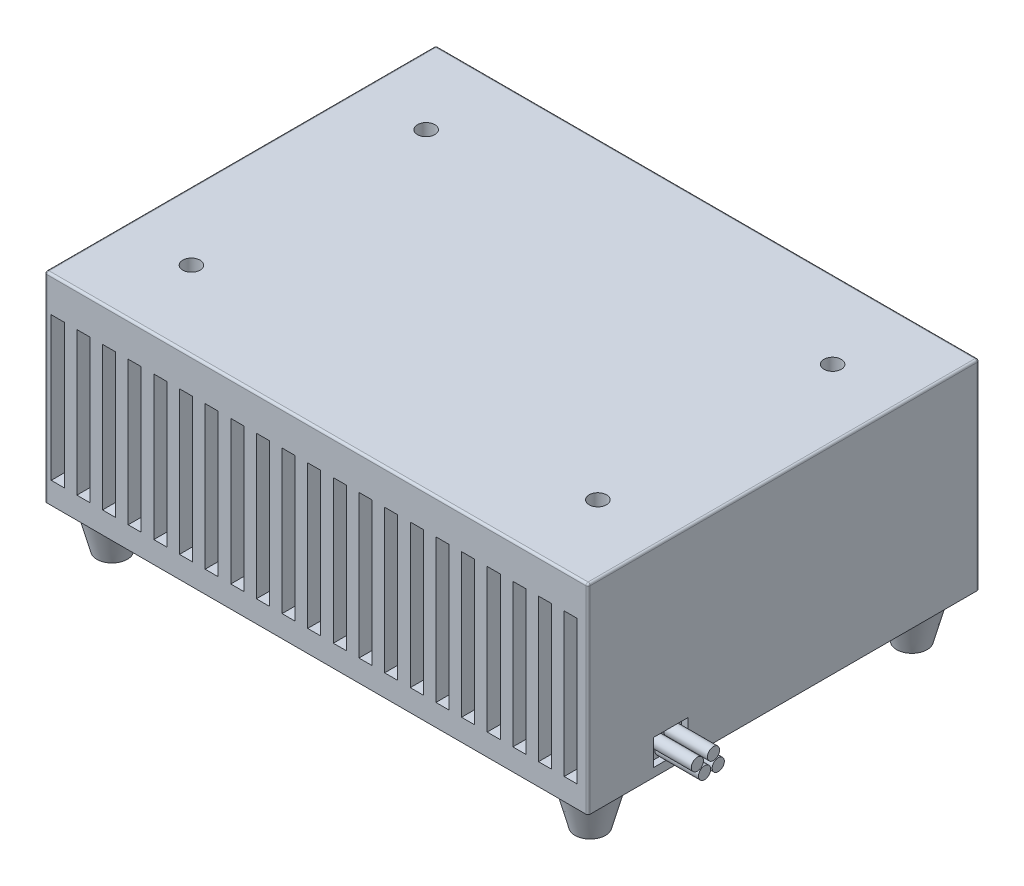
ISO-10303-21;
HEADER;
FILE_DESCRIPTION(('STEP AP214'),'2;1');
FILE_NAME('part.step','',(''),(''),'','','');
FILE_SCHEMA(('AUTOMOTIVE_DESIGN { 1 0 10303 214 1 1 1 1 }'));
ENDSEC;
DATA;
#1=APPLICATION_CONTEXT('core data for automotive mechanical design processes');
#2=APPLICATION_PROTOCOL_DEFINITION('international standard','automotive_design',2000,#1);
#3=PRODUCT_CONTEXT('',#1,'mechanical');
#4=PRODUCT('Part','Part','',(#3));
#5=PRODUCT_RELATED_PRODUCT_CATEGORY('part','',(#4));
#6=PRODUCT_DEFINITION_FORMATION('','',#4);
#7=PRODUCT_DEFINITION_CONTEXT('part definition',#1,'design');
#8=PRODUCT_DEFINITION('design','',#6,#7);
#9=PRODUCT_DEFINITION_SHAPE('','',#8);
#10=(LENGTH_UNIT() NAMED_UNIT(*) SI_UNIT(.MILLI.,.METRE.));
#11=(NAMED_UNIT(*) PLANE_ANGLE_UNIT() SI_UNIT($,.RADIAN.));
#12=(NAMED_UNIT(*) SI_UNIT($,.STERADIAN.) SOLID_ANGLE_UNIT());
#13=UNCERTAINTY_MEASURE_WITH_UNIT(LENGTH_MEASURE(1.E-05),#10,'distance_accuracy_value','');
#14=(GEOMETRIC_REPRESENTATION_CONTEXT(3) GLOBAL_UNCERTAINTY_ASSIGNED_CONTEXT((#13)) GLOBAL_UNIT_ASSIGNED_CONTEXT((#10,
#11,#12)) REPRESENTATION_CONTEXT('',''));
#15=CARTESIAN_POINT('',(0.,0.,0.));
#16=DIRECTION('',(0.,0.,1.));
#17=DIRECTION('',(1.,0.,0.));
#18=AXIS2_PLACEMENT_3D('',#15,#16,#17);
#19=CARTESIAN_POINT('',(45.2,48.,-11.));
#20=DIRECTION('',(0.,1.,0.));
#21=DIRECTION('',(0.,0.,1.));
#22=AXIS2_PLACEMENT_3D('',#19,#20,#21);
#23=PLANE('',#22);
#24=DIRECTION('',(0.,0.,1.));
#25=VECTOR('',#24,1.);
#26=CARTESIAN_POINT('',(48.2,48.,-11.));
#27=LINE('',#26,#25);
#28=CARTESIAN_POINT('',(48.2,48.,-11.));
#29=VERTEX_POINT('',#28);
#30=CARTESIAN_POINT('',(48.2,48.,25.6225022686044));
#31=VERTEX_POINT('',#30);
#32=EDGE_CURVE('E973',#29,#31,#27,.T.);
#33=ORIENTED_EDGE('',*,*,#32,.T.);
#34=CARTESIAN_POINT('',(46.75,48.,27.));
#35=DIRECTION('',(0.,1.,0.));
#36=DIRECTION('',(0.,0.,1.));
#37=AXIS2_PLACEMENT_3D('',#34,#35,#36);
#38=CIRCLE('',#37,2.);
#39=CARTESIAN_POINT('',(45.2,48.,25.7360775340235));
#40=VERTEX_POINT('',#39);
#41=EDGE_CURVE('E940',#31,#40,#38,.T.);
#42=ORIENTED_EDGE('',*,*,#41,.T.);
#43=DIRECTION('',(0.,0.,1.));
#44=VECTOR('',#43,1.);
#45=CARTESIAN_POINT('',(45.2,48.,-11.));
#46=LINE('',#45,#44);
#47=CARTESIAN_POINT('',(45.2,48.,-11.));
#48=VERTEX_POINT('',#47);
#49=EDGE_CURVE('E971',#48,#40,#46,.T.);
#50=ORIENTED_EDGE('',*,*,#49,.F.);
#51=DIRECTION('',(-1.,0.,0.));
#52=VECTOR('',#51,1.);
#53=CARTESIAN_POINT('',(45.2,48.,-11.));
#54=LINE('',#53,#52);
#55=EDGE_CURVE('E1015',#29,#48,#54,.T.);
#56=ORIENTED_EDGE('',*,*,#55,.F.);
#57=EDGE_LOOP('',(#33,#42,#50,#56));
#58=FACE_BOUND('',#57,.T.);
#59=ADVANCED_FACE('F51',(#58),#23,.F.);
#60=CARTESIAN_POINT('',(62.5,56.,45.));
#61=DIRECTION('',(-1.,0.,0.));
#62=DIRECTION('',(0.,0.,1.));
#63=AXIS2_PLACEMENT_3D('',#60,#61,#62);
#64=PLANE('',#63);
#65=DIRECTION('',(0.,0.,-1.));
#66=VECTOR('',#65,1.);
#67=CARTESIAN_POINT('',(62.5,12.,30.));
#68=LINE('',#67,#66);
#69=CARTESIAN_POINT('',(62.5,12.,30.));
#70=VERTEX_POINT('',#69);
#71=CARTESIAN_POINT('',(62.5,12.,22.));
#72=VERTEX_POINT('',#71);
#73=EDGE_CURVE('E888',#70,#72,#68,.T.);
#74=ORIENTED_EDGE('',*,*,#73,.F.);
#75=DIRECTION('',(0.,-1.,0.));
#76=VECTOR('',#75,1.);
#77=CARTESIAN_POINT('',(62.5,12.,30.));
#78=LINE('',#77,#76);
#79=CARTESIAN_POINT('',(62.5,18.,30.));
#80=VERTEX_POINT('',#79);
#81=EDGE_CURVE('E892',#80,#70,#78,.T.);
#82=ORIENTED_EDGE('',*,*,#81,.F.);
#83=DIRECTION('',(0.,0.,1.));
#84=VECTOR('',#83,1.);
#85=CARTESIAN_POINT('',(62.5,18.,30.));
#86=LINE('',#85,#84);
#87=CARTESIAN_POINT('',(62.5,18.,22.));
#88=VERTEX_POINT('',#87);
#89=EDGE_CURVE('E879',#88,#80,#86,.T.);
#90=ORIENTED_EDGE('',*,*,#89,.F.);
#91=DIRECTION('',(0.,1.,0.));
#92=VECTOR('',#91,1.);
#93=CARTESIAN_POINT('',(62.5,12.,22.));
#94=LINE('',#93,#92);
#95=EDGE_CURVE('E884',#72,#88,#94,.T.);
#96=ORIENTED_EDGE('',*,*,#95,.F.);
#97=EDGE_LOOP('',(#74,#82,#90,#96));
#98=FACE_BOUND('',#97,.T.);
#99=DIRECTION('',(0.,-1.,0.));
#100=VECTOR('',#99,1.);
#101=CARTESIAN_POINT('',(62.5,56.,44.5));
#102=LINE('',#101,#100);
#103=CARTESIAN_POINT('',(62.5,55.5,44.5));
#104=VERTEX_POINT('',#103);
#105=CARTESIAN_POINT('',(62.5,10.,44.5));
#106=VERTEX_POINT('',#105);
#107=EDGE_CURVE('E1149',#104,#106,#102,.T.);
#108=ORIENTED_EDGE('',*,*,#107,.T.);
#109=DIRECTION('',(0.,0.,-1.));
#110=VECTOR('',#109,1.);
#111=CARTESIAN_POINT('',(62.5,10.,45.));
#112=LINE('',#111,#110);
#113=CARTESIAN_POINT('',(62.5,10.,-44.5));
#114=VERTEX_POINT('',#113);
#115=EDGE_CURVE('E811',#106,#114,#112,.T.);
#116=ORIENTED_EDGE('',*,*,#115,.T.);
#117=DIRECTION('',(0.,-1.,0.));
#118=VECTOR('',#117,1.);
#119=CARTESIAN_POINT('',(62.5,56.,-44.5));
#120=LINE('',#119,#118);
#121=CARTESIAN_POINT('',(62.5,55.5,-44.5));
#122=VERTEX_POINT('',#121);
#123=EDGE_CURVE('E1146',#114,#122,#120,.F.);
#124=ORIENTED_EDGE('',*,*,#123,.T.);
#125=DIRECTION('',(0.,0.,-1.));
#126=VECTOR('',#125,1.);
#127=CARTESIAN_POINT('',(62.5,55.5,45.));
#128=LINE('',#127,#126);
#129=EDGE_CURVE('E1143',#122,#104,#128,.F.);
#130=ORIENTED_EDGE('',*,*,#129,.T.);
#131=EDGE_LOOP('',(#108,#116,#124,#130));
#132=FACE_BOUND('',#131,.T.);
#133=ADVANCED_FACE('F1254',(#98,#132),#64,.F.);
#134=CARTESIAN_POINT('',(-62.5,56.,-45.));
#135=DIRECTION('',(0.,0.,1.));
#136=DIRECTION('',(1.,0.,0.));
#137=AXIS2_PLACEMENT_3D('',#134,#135,#136);
#138=PLANE('',#137);
#139=DIRECTION('',(0.,-1.,0.));
#140=VECTOR('',#139,1.);
#141=CARTESIAN_POINT('',(62.,56.,-45.));
#142=LINE('',#141,#140);
#143=CARTESIAN_POINT('',(62.,55.5,-45.));
#144=VERTEX_POINT('',#143);
#145=CARTESIAN_POINT('',(62.,10.,-45.));
#146=VERTEX_POINT('',#145);
#147=EDGE_CURVE('E1136',#144,#146,#142,.T.);
#148=ORIENTED_EDGE('',*,*,#147,.T.);
#149=DIRECTION('',(-1.,0.,0.));
#150=VECTOR('',#149,1.);
#151=CARTESIAN_POINT('',(-62.5,10.,-45.));
#152=LINE('',#151,#150);
#153=CARTESIAN_POINT('',(-62.,10.,-45.));
#154=VERTEX_POINT('',#153);
#155=EDGE_CURVE('E815',#146,#154,#152,.T.);
#156=ORIENTED_EDGE('',*,*,#155,.T.);
#157=DIRECTION('',(0.,-1.,0.));
#158=VECTOR('',#157,1.);
#159=CARTESIAN_POINT('',(-62.,56.,-45.));
#160=LINE('',#159,#158);
#161=CARTESIAN_POINT('',(-62.,55.5,-45.));
#162=VERTEX_POINT('',#161);
#163=EDGE_CURVE('E1140',#154,#162,#160,.F.);
#164=ORIENTED_EDGE('',*,*,#163,.T.);
#165=DIRECTION('',(-1.,0.,0.));
#166=VECTOR('',#165,1.);
#167=CARTESIAN_POINT('',(-62.5,55.5,-45.));
#168=LINE('',#167,#166);
#169=EDGE_CURVE('E1133',#162,#144,#168,.F.);
#170=ORIENTED_EDGE('',*,*,#169,.T.);
#171=EDGE_LOOP('',(#148,#156,#164,#170));
#172=FACE_BOUND('',#171,.T.);
#173=ADVANCED_FACE('F1257',(#172),#138,.F.);
#174=CARTESIAN_POINT('',(-62.5,56.,45.));
#175=DIRECTION('',(1.,0.,0.));
#176=DIRECTION('',(0.,0.,-1.));
#177=AXIS2_PLACEMENT_3D('',#174,#175,#176);
#178=PLANE('',#177);
#179=DIRECTION('',(0.,-1.,0.));
#180=VECTOR('',#179,1.);
#181=CARTESIAN_POINT('',(-62.5,56.,-44.5));
#182=LINE('',#181,#180);
#183=CARTESIAN_POINT('',(-62.5,55.5,-44.5));
#184=VERTEX_POINT('',#183);
#185=CARTESIAN_POINT('',(-62.5,10.,-44.5));
#186=VERTEX_POINT('',#185);
#187=EDGE_CURVE('E1126',#184,#186,#182,.T.);
#188=ORIENTED_EDGE('',*,*,#187,.T.);
#189=DIRECTION('',(0.,0.,1.));
#190=VECTOR('',#189,1.);
#191=CARTESIAN_POINT('',(-62.5,10.,45.));
#192=LINE('',#191,#190);
#193=CARTESIAN_POINT('',(-62.5,10.,44.5));
#194=VERTEX_POINT('',#193);
#195=EDGE_CURVE('E825',#186,#194,#192,.T.);
#196=ORIENTED_EDGE('',*,*,#195,.T.);
#197=DIRECTION('',(0.,-1.,0.));
#198=VECTOR('',#197,1.);
#199=CARTESIAN_POINT('',(-62.5,56.,44.5));
#200=LINE('',#199,#198);
#201=CARTESIAN_POINT('',(-62.5,55.5,44.5));
#202=VERTEX_POINT('',#201);
#203=EDGE_CURVE('E1130',#194,#202,#200,.F.);
#204=ORIENTED_EDGE('',*,*,#203,.T.);
#205=DIRECTION('',(0.,0.,1.));
#206=VECTOR('',#205,1.);
#207=CARTESIAN_POINT('',(-62.5,55.5,45.));
#208=LINE('',#207,#206);
#209=EDGE_CURVE('E1123',#202,#184,#208,.F.);
#210=ORIENTED_EDGE('',*,*,#209,.T.);
#211=EDGE_LOOP('',(#188,#196,#204,#210));
#212=FACE_BOUND('',#211,.T.);
#213=ADVANCED_FACE('F1291',(#212),#178,.F.);
#214=CARTESIAN_POINT('',(-62.5,56.,45.));
#215=DIRECTION('',(0.,0.,-1.));
#216=DIRECTION('',(-1.,0.,0.));
#217=AXIS2_PLACEMENT_3D('',#214,#215,#216);
#218=PLANE('',#217);
#219=DIRECTION('',(1.,0.,0.));
#220=VECTOR('',#219,1.);
#221=CARTESIAN_POINT('',(-61.,15.,45.));
#222=LINE('',#221,#220);
#223=CARTESIAN_POINT('',(-61.,15.,45.));
#224=VERTEX_POINT('',#223);
#225=CARTESIAN_POINT('',(-58.,15.,45.));
#226=VERTEX_POINT('',#225);
#227=EDGE_CURVE('E787',#224,#226,#222,.T.);
#228=ORIENTED_EDGE('',*,*,#227,.F.);
#229=DIRECTION('',(0.,-1.,0.));
#230=VECTOR('',#229,1.);
#231=CARTESIAN_POINT('',(-61.,15.,45.));
#232=LINE('',#231,#230);
#233=CARTESIAN_POINT('',(-61.,48.,45.));
#234=VERTEX_POINT('',#233);
#235=EDGE_CURVE('E738',#234,#224,#232,.T.);
#236=ORIENTED_EDGE('',*,*,#235,.F.);
#237=DIRECTION('',(-1.,0.,0.));
#238=VECTOR('',#237,1.);
#239=CARTESIAN_POINT('',(-61.,48.,45.));
#240=LINE('',#239,#238);
#241=CARTESIAN_POINT('',(-58.,48.,45.));
#242=VERTEX_POINT('',#241);
#243=EDGE_CURVE('E778',#242,#234,#240,.T.);
#244=ORIENTED_EDGE('',*,*,#243,.F.);
#245=DIRECTION('',(0.,1.,0.));
#246=VECTOR('',#245,1.);
#247=CARTESIAN_POINT('',(-58.,15.,45.));
#248=LINE('',#247,#246);
#249=EDGE_CURVE('E783',#226,#242,#248,.T.);
#250=ORIENTED_EDGE('',*,*,#249,.F.);
#251=EDGE_LOOP('',(#228,#236,#244,#250));
#252=FACE_BOUND('',#251,.T.);
#253=DIRECTION('',(0.,1.,0.));
#254=VECTOR('',#253,1.);
#255=CARTESIAN_POINT('',(-52.1,15.,45.));
#256=LINE('',#255,#254);
#257=CARTESIAN_POINT('',(-52.1,15.,45.));
#258=VERTEX_POINT('',#257);
#259=CARTESIAN_POINT('',(-52.1,48.,45.));
#260=VERTEX_POINT('',#259);
#261=EDGE_CURVE('E739',#258,#260,#256,.T.);
#262=ORIENTED_EDGE('',*,*,#261,.F.);
#263=DIRECTION('',(1.,0.,0.));
#264=VECTOR('',#263,1.);
#265=CARTESIAN_POINT('',(-55.1,15.,45.));
#266=LINE('',#265,#264);
#267=CARTESIAN_POINT('',(-55.1,15.,45.));
#268=VERTEX_POINT('',#267);
#269=EDGE_CURVE('E735',#268,#258,#266,.T.);
#270=ORIENTED_EDGE('',*,*,#269,.F.);
#271=DIRECTION('',(0.,-1.,0.));
#272=VECTOR('',#271,1.);
#273=CARTESIAN_POINT('',(-55.1,15.,45.));
#274=LINE('',#273,#272);
#275=CARTESIAN_POINT('',(-55.1,48.,45.));
#276=VERTEX_POINT('',#275);
#277=EDGE_CURVE('E721',#276,#268,#274,.T.);
#278=ORIENTED_EDGE('',*,*,#277,.F.);
#279=DIRECTION('',(-1.,0.,0.));
#280=VECTOR('',#279,1.);
#281=CARTESIAN_POINT('',(-55.1,48.,45.));
#282=LINE('',#281,#280);
#283=EDGE_CURVE('E743',#260,#276,#282,.T.);
#284=ORIENTED_EDGE('',*,*,#283,.F.);
#285=EDGE_LOOP('',(#262,#270,#278,#284));
#286=FACE_BOUND('',#285,.T.);
#287=DIRECTION('',(0.,1.,0.));
#288=VECTOR('',#287,1.);
#289=CARTESIAN_POINT('',(-46.2,15.,45.));
#290=LINE('',#289,#288);
#291=CARTESIAN_POINT('',(-46.2,15.,45.));
#292=VERTEX_POINT('',#291);
#293=CARTESIAN_POINT('',(-46.2,48.,45.));
#294=VERTEX_POINT('',#293);
#295=EDGE_CURVE('E699',#292,#294,#290,.T.);
#296=ORIENTED_EDGE('',*,*,#295,.F.);
#297=DIRECTION('',(1.,0.,0.));
#298=VECTOR('',#297,1.);
#299=CARTESIAN_POINT('',(-49.2,15.,45.));
#300=LINE('',#299,#298);
#301=CARTESIAN_POINT('',(-49.2,15.,45.));
#302=VERTEX_POINT('',#301);
#303=EDGE_CURVE('E754',#302,#292,#300,.T.);
#304=ORIENTED_EDGE('',*,*,#303,.F.);
#305=DIRECTION('',(0.,-1.,0.));
#306=VECTOR('',#305,1.);
#307=CARTESIAN_POINT('',(-49.2,15.,45.));
#308=LINE('',#307,#306);
#309=CARTESIAN_POINT('',(-49.2,48.,45.));
#310=VERTEX_POINT('',#309);
#311=EDGE_CURVE('E2025',#310,#302,#308,.T.);
#312=ORIENTED_EDGE('',*,*,#311,.F.);
#313=DIRECTION('',(-1.,0.,0.));
#314=VECTOR('',#313,1.);
#315=CARTESIAN_POINT('',(-49.2,48.,45.));
#316=LINE('',#315,#314);
#317=EDGE_CURVE('E2037',#294,#310,#316,.T.);
#318=ORIENTED_EDGE('',*,*,#317,.F.);
#319=EDGE_LOOP('',(#296,#304,#312,#318));
#320=FACE_BOUND('',#319,.T.);
#321=DIRECTION('',(0.,1.,0.));
#322=VECTOR('',#321,1.);
#323=CARTESIAN_POINT('',(-40.3,15.,45.));
#324=LINE('',#323,#322);
#325=CARTESIAN_POINT('',(-40.3,15.,45.));
#326=VERTEX_POINT('',#325);
#327=CARTESIAN_POINT('',(-40.3,48.,45.));
#328=VERTEX_POINT('',#327);
#329=EDGE_CURVE('E1999',#326,#328,#324,.T.);
#330=ORIENTED_EDGE('',*,*,#329,.F.);
#331=DIRECTION('',(1.,0.,0.));
#332=VECTOR('',#331,1.);
#333=CARTESIAN_POINT('',(-43.3,15.,45.));
#334=LINE('',#333,#332);
#335=CARTESIAN_POINT('',(-43.3,15.,45.));
#336=VERTEX_POINT('',#335);
#337=EDGE_CURVE('E1996',#336,#326,#334,.T.);
#338=ORIENTED_EDGE('',*,*,#337,.F.);
#339=DIRECTION('',(0.,-1.,0.));
#340=VECTOR('',#339,1.);
#341=CARTESIAN_POINT('',(-43.3,15.,45.));
#342=LINE('',#341,#340);
#343=CARTESIAN_POINT('',(-43.3,48.,45.));
#344=VERTEX_POINT('',#343);
#345=EDGE_CURVE('E1982',#344,#336,#342,.T.);
#346=ORIENTED_EDGE('',*,*,#345,.F.);
#347=DIRECTION('',(-1.,0.,0.));
#348=VECTOR('',#347,1.);
#349=CARTESIAN_POINT('',(-43.3,48.,45.));
#350=LINE('',#349,#348);
#351=EDGE_CURVE('E2003',#328,#344,#350,.T.);
#352=ORIENTED_EDGE('',*,*,#351,.F.);
#353=EDGE_LOOP('',(#330,#338,#346,#352));
#354=FACE_BOUND('',#353,.T.);
#355=DIRECTION('',(0.,1.,0.));
#356=VECTOR('',#355,1.);
#357=CARTESIAN_POINT('',(-34.4,15.,45.));
#358=LINE('',#357,#356);
#359=CARTESIAN_POINT('',(-34.4,15.,45.));
#360=VERTEX_POINT('',#359);
#361=CARTESIAN_POINT('',(-34.4,48.,45.));
#362=VERTEX_POINT('',#361);
#363=EDGE_CURVE('E1956',#360,#362,#358,.T.);
#364=ORIENTED_EDGE('',*,*,#363,.F.);
#365=DIRECTION('',(1.,0.,0.));
#366=VECTOR('',#365,1.);
#367=CARTESIAN_POINT('',(-37.4,15.,45.));
#368=LINE('',#367,#366);
#369=CARTESIAN_POINT('',(-37.4,15.,45.));
#370=VERTEX_POINT('',#369);
#371=EDGE_CURVE('E1952',#370,#360,#368,.T.);
#372=ORIENTED_EDGE('',*,*,#371,.F.);
#373=DIRECTION('',(0.,-1.,0.));
#374=VECTOR('',#373,1.);
#375=CARTESIAN_POINT('',(-37.4,15.,45.));
#376=LINE('',#375,#374);
#377=CARTESIAN_POINT('',(-37.4,48.,45.));
#378=VERTEX_POINT('',#377);
#379=EDGE_CURVE('E1938',#378,#370,#376,.T.);
#380=ORIENTED_EDGE('',*,*,#379,.F.);
#381=DIRECTION('',(-1.,0.,0.));
#382=VECTOR('',#381,1.);
#383=CARTESIAN_POINT('',(-37.4,48.,45.));
#384=LINE('',#383,#382);
#385=EDGE_CURVE('E1960',#362,#378,#384,.T.);
#386=ORIENTED_EDGE('',*,*,#385,.F.);
#387=EDGE_LOOP('',(#364,#372,#380,#386));
#388=FACE_BOUND('',#387,.T.);
#389=DIRECTION('',(0.,1.,0.));
#390=VECTOR('',#389,1.);
#391=CARTESIAN_POINT('',(-28.5,15.,45.));
#392=LINE('',#391,#390);
#393=CARTESIAN_POINT('',(-28.5,15.,45.));
#394=VERTEX_POINT('',#393);
#395=CARTESIAN_POINT('',(-28.5,48.,45.));
#396=VERTEX_POINT('',#395);
#397=EDGE_CURVE('E1912',#394,#396,#392,.T.);
#398=ORIENTED_EDGE('',*,*,#397,.F.);
#399=DIRECTION('',(1.,0.,0.));
#400=VECTOR('',#399,1.);
#401=CARTESIAN_POINT('',(-31.5,15.,45.));
#402=LINE('',#401,#400);
#403=CARTESIAN_POINT('',(-31.5,15.,45.));
#404=VERTEX_POINT('',#403);
#405=EDGE_CURVE('E1908',#404,#394,#402,.T.);
#406=ORIENTED_EDGE('',*,*,#405,.F.);
#407=DIRECTION('',(0.,-1.,0.));
#408=VECTOR('',#407,1.);
#409=CARTESIAN_POINT('',(-31.5,15.,45.));
#410=LINE('',#409,#408);
#411=CARTESIAN_POINT('',(-31.5,48.,45.));
#412=VERTEX_POINT('',#411);
#413=EDGE_CURVE('E1894',#412,#404,#410,.T.);
#414=ORIENTED_EDGE('',*,*,#413,.F.);
#415=DIRECTION('',(-1.,0.,0.));
#416=VECTOR('',#415,1.);
#417=CARTESIAN_POINT('',(-31.5,48.,45.));
#418=LINE('',#417,#416);
#419=EDGE_CURVE('E1916',#396,#412,#418,.T.);
#420=ORIENTED_EDGE('',*,*,#419,.F.);
#421=EDGE_LOOP('',(#398,#406,#414,#420));
#422=FACE_BOUND('',#421,.T.);
#423=DIRECTION('',(0.,1.,0.));
#424=VECTOR('',#423,1.);
#425=CARTESIAN_POINT('',(-22.6,15.,45.));
#426=LINE('',#425,#424);
#427=CARTESIAN_POINT('',(-22.6,15.,45.));
#428=VERTEX_POINT('',#427);
#429=CARTESIAN_POINT('',(-22.6,48.,45.));
#430=VERTEX_POINT('',#429);
#431=EDGE_CURVE('E1868',#428,#430,#426,.T.);
#432=ORIENTED_EDGE('',*,*,#431,.F.);
#433=DIRECTION('',(1.,0.,0.));
#434=VECTOR('',#433,1.);
#435=CARTESIAN_POINT('',(-25.6,15.,45.));
#436=LINE('',#435,#434);
#437=CARTESIAN_POINT('',(-25.6,15.,45.));
#438=VERTEX_POINT('',#437);
#439=EDGE_CURVE('E1864',#438,#428,#436,.T.);
#440=ORIENTED_EDGE('',*,*,#439,.F.);
#441=DIRECTION('',(0.,-1.,0.));
#442=VECTOR('',#441,1.);
#443=CARTESIAN_POINT('',(-25.6,15.,45.));
#444=LINE('',#443,#442);
#445=CARTESIAN_POINT('',(-25.6,48.,45.));
#446=VERTEX_POINT('',#445);
#447=EDGE_CURVE('E1850',#446,#438,#444,.T.);
#448=ORIENTED_EDGE('',*,*,#447,.F.);
#449=DIRECTION('',(-1.,0.,0.));
#450=VECTOR('',#449,1.);
#451=CARTESIAN_POINT('',(-25.6,48.,45.));
#452=LINE('',#451,#450);
#453=EDGE_CURVE('E1872',#430,#446,#452,.T.);
#454=ORIENTED_EDGE('',*,*,#453,.F.);
#455=EDGE_LOOP('',(#432,#440,#448,#454));
#456=FACE_BOUND('',#455,.T.);
#457=DIRECTION('',(0.,1.,0.));
#458=VECTOR('',#457,1.);
#459=CARTESIAN_POINT('',(-16.7,15.,45.));
#460=LINE('',#459,#458);
#461=CARTESIAN_POINT('',(-16.7,15.,45.));
#462=VERTEX_POINT('',#461);
#463=CARTESIAN_POINT('',(-16.7,48.,45.));
#464=VERTEX_POINT('',#463);
#465=EDGE_CURVE('E1824',#462,#464,#460,.T.);
#466=ORIENTED_EDGE('',*,*,#465,.F.);
#467=DIRECTION('',(1.,0.,0.));
#468=VECTOR('',#467,1.);
#469=CARTESIAN_POINT('',(-19.7,15.,45.));
#470=LINE('',#469,#468);
#471=CARTESIAN_POINT('',(-19.7,15.,45.));
#472=VERTEX_POINT('',#471);
#473=EDGE_CURVE('E1820',#472,#462,#470,.T.);
#474=ORIENTED_EDGE('',*,*,#473,.F.);
#475=DIRECTION('',(0.,-1.,0.));
#476=VECTOR('',#475,1.);
#477=CARTESIAN_POINT('',(-19.7,15.,45.));
#478=LINE('',#477,#476);
#479=CARTESIAN_POINT('',(-19.7,48.,45.));
#480=VERTEX_POINT('',#479);
#481=EDGE_CURVE('E1806',#480,#472,#478,.T.);
#482=ORIENTED_EDGE('',*,*,#481,.F.);
#483=DIRECTION('',(-1.,0.,0.));
#484=VECTOR('',#483,1.);
#485=CARTESIAN_POINT('',(-19.7,48.,45.));
#486=LINE('',#485,#484);
#487=EDGE_CURVE('E1828',#464,#480,#486,.T.);
#488=ORIENTED_EDGE('',*,*,#487,.F.);
#489=EDGE_LOOP('',(#466,#474,#482,#488));
#490=FACE_BOUND('',#489,.T.);
#491=DIRECTION('',(0.,1.,0.));
#492=VECTOR('',#491,1.);
#493=CARTESIAN_POINT('',(-10.8,15.,45.));
#494=LINE('',#493,#492);
#495=CARTESIAN_POINT('',(-10.8,15.,45.));
#496=VERTEX_POINT('',#495);
#497=CARTESIAN_POINT('',(-10.8,48.,45.));
#498=VERTEX_POINT('',#497);
#499=EDGE_CURVE('E1780',#496,#498,#494,.T.);
#500=ORIENTED_EDGE('',*,*,#499,.F.);
#501=DIRECTION('',(1.,0.,0.));
#502=VECTOR('',#501,1.);
#503=CARTESIAN_POINT('',(-13.8,15.,45.));
#504=LINE('',#503,#502);
#505=CARTESIAN_POINT('',(-13.8,15.,45.));
#506=VERTEX_POINT('',#505);
#507=EDGE_CURVE('E1776',#506,#496,#504,.T.);
#508=ORIENTED_EDGE('',*,*,#507,.F.);
#509=DIRECTION('',(0.,-1.,0.));
#510=VECTOR('',#509,1.);
#511=CARTESIAN_POINT('',(-13.8,15.,45.));
#512=LINE('',#511,#510);
#513=CARTESIAN_POINT('',(-13.8,48.,45.));
#514=VERTEX_POINT('',#513);
#515=EDGE_CURVE('E1762',#514,#506,#512,.T.);
#516=ORIENTED_EDGE('',*,*,#515,.F.);
#517=DIRECTION('',(-1.,0.,0.));
#518=VECTOR('',#517,1.);
#519=CARTESIAN_POINT('',(-13.8,48.,45.));
#520=LINE('',#519,#518);
#521=EDGE_CURVE('E1784',#498,#514,#520,.T.);
#522=ORIENTED_EDGE('',*,*,#521,.F.);
#523=EDGE_LOOP('',(#500,#508,#516,#522));
#524=FACE_BOUND('',#523,.T.);
#525=DIRECTION('',(0.,1.,0.));
#526=VECTOR('',#525,1.);
#527=CARTESIAN_POINT('',(-4.9,15.,45.));
#528=LINE('',#527,#526);
#529=CARTESIAN_POINT('',(-4.9,15.,45.));
#530=VERTEX_POINT('',#529);
#531=CARTESIAN_POINT('',(-4.9,48.,45.));
#532=VERTEX_POINT('',#531);
#533=EDGE_CURVE('E1736',#530,#532,#528,.T.);
#534=ORIENTED_EDGE('',*,*,#533,.F.);
#535=DIRECTION('',(1.,0.,0.));
#536=VECTOR('',#535,1.);
#537=CARTESIAN_POINT('',(-7.9,15.,45.));
#538=LINE('',#537,#536);
#539=CARTESIAN_POINT('',(-7.9,15.,45.));
#540=VERTEX_POINT('',#539);
#541=EDGE_CURVE('E1732',#540,#530,#538,.T.);
#542=ORIENTED_EDGE('',*,*,#541,.F.);
#543=DIRECTION('',(0.,-1.,0.));
#544=VECTOR('',#543,1.);
#545=CARTESIAN_POINT('',(-7.9,15.,45.));
#546=LINE('',#545,#544);
#547=CARTESIAN_POINT('',(-7.9,48.,45.));
#548=VERTEX_POINT('',#547);
#549=EDGE_CURVE('E1718',#548,#540,#546,.T.);
#550=ORIENTED_EDGE('',*,*,#549,.F.);
#551=DIRECTION('',(-1.,0.,0.));
#552=VECTOR('',#551,1.);
#553=CARTESIAN_POINT('',(-7.9,48.,45.));
#554=LINE('',#553,#552);
#555=EDGE_CURVE('E1740',#532,#548,#554,.T.);
#556=ORIENTED_EDGE('',*,*,#555,.F.);
#557=EDGE_LOOP('',(#534,#542,#550,#556));
#558=FACE_BOUND('',#557,.T.);
#559=DIRECTION('',(0.,1.,0.));
#560=VECTOR('',#559,1.);
#561=CARTESIAN_POINT('',(1.,15.,45.));
#562=LINE('',#561,#560);
#563=CARTESIAN_POINT('',(1.,15.,45.));
#564=VERTEX_POINT('',#563);
#565=CARTESIAN_POINT('',(1.,48.,45.));
#566=VERTEX_POINT('',#565);
#567=EDGE_CURVE('E1692',#564,#566,#562,.T.);
#568=ORIENTED_EDGE('',*,*,#567,.F.);
#569=DIRECTION('',(1.,0.,0.));
#570=VECTOR('',#569,1.);
#571=CARTESIAN_POINT('',(-2.,15.,45.));
#572=LINE('',#571,#570);
#573=CARTESIAN_POINT('',(-2.,15.,45.));
#574=VERTEX_POINT('',#573);
#575=EDGE_CURVE('E1688',#574,#564,#572,.T.);
#576=ORIENTED_EDGE('',*,*,#575,.F.);
#577=DIRECTION('',(0.,-1.,0.));
#578=VECTOR('',#577,1.);
#579=CARTESIAN_POINT('',(-2.,15.,45.));
#580=LINE('',#579,#578);
#581=CARTESIAN_POINT('',(-2.,48.,45.));
#582=VERTEX_POINT('',#581);
#583=EDGE_CURVE('E1674',#582,#574,#580,.T.);
#584=ORIENTED_EDGE('',*,*,#583,.F.);
#585=DIRECTION('',(-1.,0.,0.));
#586=VECTOR('',#585,1.);
#587=CARTESIAN_POINT('',(-2.,48.,45.));
#588=LINE('',#587,#586);
#589=EDGE_CURVE('E1696',#566,#582,#588,.T.);
#590=ORIENTED_EDGE('',*,*,#589,.F.);
#591=EDGE_LOOP('',(#568,#576,#584,#590));
#592=FACE_BOUND('',#591,.T.);
#593=DIRECTION('',(0.,1.,0.));
#594=VECTOR('',#593,1.);
#595=CARTESIAN_POINT('',(6.9,15.,45.));
#596=LINE('',#595,#594);
#597=CARTESIAN_POINT('',(6.9,15.,45.));
#598=VERTEX_POINT('',#597);
#599=CARTESIAN_POINT('',(6.9,48.,45.));
#600=VERTEX_POINT('',#599);
#601=EDGE_CURVE('E1648',#598,#600,#596,.T.);
#602=ORIENTED_EDGE('',*,*,#601,.F.);
#603=DIRECTION('',(1.,0.,0.));
#604=VECTOR('',#603,1.);
#605=CARTESIAN_POINT('',(3.9,15.,45.));
#606=LINE('',#605,#604);
#607=CARTESIAN_POINT('',(3.9,15.,45.));
#608=VERTEX_POINT('',#607);
#609=EDGE_CURVE('E1644',#608,#598,#606,.T.);
#610=ORIENTED_EDGE('',*,*,#609,.F.);
#611=DIRECTION('',(0.,-1.,0.));
#612=VECTOR('',#611,1.);
#613=CARTESIAN_POINT('',(3.9,15.,45.));
#614=LINE('',#613,#612);
#615=CARTESIAN_POINT('',(3.9,48.,45.));
#616=VERTEX_POINT('',#615);
#617=EDGE_CURVE('E1630',#616,#608,#614,.T.);
#618=ORIENTED_EDGE('',*,*,#617,.F.);
#619=DIRECTION('',(-1.,0.,0.));
#620=VECTOR('',#619,1.);
#621=CARTESIAN_POINT('',(3.9,48.,45.));
#622=LINE('',#621,#620);
#623=EDGE_CURVE('E1652',#600,#616,#622,.T.);
#624=ORIENTED_EDGE('',*,*,#623,.F.);
#625=EDGE_LOOP('',(#602,#610,#618,#624));
#626=FACE_BOUND('',#625,.T.);
#627=DIRECTION('',(0.,1.,0.));
#628=VECTOR('',#627,1.);
#629=CARTESIAN_POINT('',(12.8,15.,45.));
#630=LINE('',#629,#628);
#631=CARTESIAN_POINT('',(12.8,15.,45.));
#632=VERTEX_POINT('',#631);
#633=CARTESIAN_POINT('',(12.8,48.,45.));
#634=VERTEX_POINT('',#633);
#635=EDGE_CURVE('E1604',#632,#634,#630,.T.);
#636=ORIENTED_EDGE('',*,*,#635,.F.);
#637=DIRECTION('',(1.,0.,0.));
#638=VECTOR('',#637,1.);
#639=CARTESIAN_POINT('',(9.79999999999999,15.,45.));
#640=LINE('',#639,#638);
#641=CARTESIAN_POINT('',(9.79999999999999,15.,45.));
#642=VERTEX_POINT('',#641);
#643=EDGE_CURVE('E1600',#642,#632,#640,.T.);
#644=ORIENTED_EDGE('',*,*,#643,.F.);
#645=DIRECTION('',(0.,-1.,0.));
#646=VECTOR('',#645,1.);
#647=CARTESIAN_POINT('',(9.79999999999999,15.,45.));
#648=LINE('',#647,#646);
#649=CARTESIAN_POINT('',(9.79999999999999,48.,45.));
#650=VERTEX_POINT('',#649);
#651=EDGE_CURVE('E1586',#650,#642,#648,.T.);
#652=ORIENTED_EDGE('',*,*,#651,.F.);
#653=DIRECTION('',(-1.,0.,0.));
#654=VECTOR('',#653,1.);
#655=CARTESIAN_POINT('',(9.79999999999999,48.,45.));
#656=LINE('',#655,#654);
#657=EDGE_CURVE('E1608',#634,#650,#656,.T.);
#658=ORIENTED_EDGE('',*,*,#657,.F.);
#659=EDGE_LOOP('',(#636,#644,#652,#658));
#660=FACE_BOUND('',#659,.T.);
#661=DIRECTION('',(0.,1.,0.));
#662=VECTOR('',#661,1.);
#663=CARTESIAN_POINT('',(18.7,15.,45.));
#664=LINE('',#663,#662);
#665=CARTESIAN_POINT('',(18.7,15.,45.));
#666=VERTEX_POINT('',#665);
#667=CARTESIAN_POINT('',(18.7,48.,45.));
#668=VERTEX_POINT('',#667);
#669=EDGE_CURVE('E1560',#666,#668,#664,.T.);
#670=ORIENTED_EDGE('',*,*,#669,.F.);
#671=DIRECTION('',(1.,0.,0.));
#672=VECTOR('',#671,1.);
#673=CARTESIAN_POINT('',(15.7,15.,45.));
#674=LINE('',#673,#672);
#675=CARTESIAN_POINT('',(15.7,15.,45.));
#676=VERTEX_POINT('',#675);
#677=EDGE_CURVE('E1556',#676,#666,#674,.T.);
#678=ORIENTED_EDGE('',*,*,#677,.F.);
#679=DIRECTION('',(0.,-1.,0.));
#680=VECTOR('',#679,1.);
#681=CARTESIAN_POINT('',(15.7,15.,45.));
#682=LINE('',#681,#680);
#683=CARTESIAN_POINT('',(15.7,48.,45.));
#684=VERTEX_POINT('',#683);
#685=EDGE_CURVE('E1542',#684,#676,#682,.T.);
#686=ORIENTED_EDGE('',*,*,#685,.F.);
#687=DIRECTION('',(-1.,0.,0.));
#688=VECTOR('',#687,1.);
#689=CARTESIAN_POINT('',(15.7,48.,45.));
#690=LINE('',#689,#688);
#691=EDGE_CURVE('E1564',#668,#684,#690,.T.);
#692=ORIENTED_EDGE('',*,*,#691,.F.);
#693=EDGE_LOOP('',(#670,#678,#686,#692));
#694=FACE_BOUND('',#693,.T.);
#695=DIRECTION('',(0.,1.,0.));
#696=VECTOR('',#695,1.);
#697=CARTESIAN_POINT('',(24.6,15.,45.));
#698=LINE('',#697,#696);
#699=CARTESIAN_POINT('',(24.6,15.,45.));
#700=VERTEX_POINT('',#699);
#701=CARTESIAN_POINT('',(24.6,48.,45.));
#702=VERTEX_POINT('',#701);
#703=EDGE_CURVE('E1516',#700,#702,#698,.T.);
#704=ORIENTED_EDGE('',*,*,#703,.F.);
#705=DIRECTION('',(1.,0.,0.));
#706=VECTOR('',#705,1.);
#707=CARTESIAN_POINT('',(21.6,15.,45.));
#708=LINE('',#707,#706);
#709=CARTESIAN_POINT('',(21.6,15.,45.));
#710=VERTEX_POINT('',#709);
#711=EDGE_CURVE('E1512',#710,#700,#708,.T.);
#712=ORIENTED_EDGE('',*,*,#711,.F.);
#713=DIRECTION('',(0.,-1.,0.));
#714=VECTOR('',#713,1.);
#715=CARTESIAN_POINT('',(21.6,15.,45.));
#716=LINE('',#715,#714);
#717=CARTESIAN_POINT('',(21.6,48.,45.));
#718=VERTEX_POINT('',#717);
#719=EDGE_CURVE('E1498',#718,#710,#716,.T.);
#720=ORIENTED_EDGE('',*,*,#719,.F.);
#721=DIRECTION('',(-1.,0.,0.));
#722=VECTOR('',#721,1.);
#723=CARTESIAN_POINT('',(21.6,48.,45.));
#724=LINE('',#723,#722);
#725=EDGE_CURVE('E1520',#702,#718,#724,.T.);
#726=ORIENTED_EDGE('',*,*,#725,.F.);
#727=EDGE_LOOP('',(#704,#712,#720,#726));
#728=FACE_BOUND('',#727,.T.);
#729=DIRECTION('',(0.,1.,0.));
#730=VECTOR('',#729,1.);
#731=CARTESIAN_POINT('',(30.5,15.,45.));
#732=LINE('',#731,#730);
#733=CARTESIAN_POINT('',(30.5,15.,45.));
#734=VERTEX_POINT('',#733);
#735=CARTESIAN_POINT('',(30.5,48.,45.));
#736=VERTEX_POINT('',#735);
#737=EDGE_CURVE('E1472',#734,#736,#732,.T.);
#738=ORIENTED_EDGE('',*,*,#737,.F.);
#739=DIRECTION('',(1.,0.,0.));
#740=VECTOR('',#739,1.);
#741=CARTESIAN_POINT('',(27.5,15.,45.));
#742=LINE('',#741,#740);
#743=CARTESIAN_POINT('',(27.5,15.,45.));
#744=VERTEX_POINT('',#743);
#745=EDGE_CURVE('E1468',#744,#734,#742,.T.);
#746=ORIENTED_EDGE('',*,*,#745,.F.);
#747=DIRECTION('',(0.,-1.,0.));
#748=VECTOR('',#747,1.);
#749=CARTESIAN_POINT('',(27.5,15.,45.));
#750=LINE('',#749,#748);
#751=CARTESIAN_POINT('',(27.5,48.,45.));
#752=VERTEX_POINT('',#751);
#753=EDGE_CURVE('E1454',#752,#744,#750,.T.);
#754=ORIENTED_EDGE('',*,*,#753,.F.);
#755=DIRECTION('',(-1.,0.,0.));
#756=VECTOR('',#755,1.);
#757=CARTESIAN_POINT('',(27.5,48.,45.));
#758=LINE('',#757,#756);
#759=EDGE_CURVE('E1476',#736,#752,#758,.T.);
#760=ORIENTED_EDGE('',*,*,#759,.F.);
#761=EDGE_LOOP('',(#738,#746,#754,#760));
#762=FACE_BOUND('',#761,.T.);
#763=DIRECTION('',(0.,1.,0.));
#764=VECTOR('',#763,1.);
#765=CARTESIAN_POINT('',(36.4,15.,45.));
#766=LINE('',#765,#764);
#767=CARTESIAN_POINT('',(36.4,15.,45.));
#768=VERTEX_POINT('',#767);
#769=CARTESIAN_POINT('',(36.4,48.,45.));
#770=VERTEX_POINT('',#769);
#771=EDGE_CURVE('E1428',#768,#770,#766,.T.);
#772=ORIENTED_EDGE('',*,*,#771,.F.);
#773=DIRECTION('',(1.,0.,0.));
#774=VECTOR('',#773,1.);
#775=CARTESIAN_POINT('',(33.4,15.,45.));
#776=LINE('',#775,#774);
#777=CARTESIAN_POINT('',(33.4,15.,45.));
#778=VERTEX_POINT('',#777);
#779=EDGE_CURVE('E1424',#778,#768,#776,.T.);
#780=ORIENTED_EDGE('',*,*,#779,.F.);
#781=DIRECTION('',(0.,-1.,0.));
#782=VECTOR('',#781,1.);
#783=CARTESIAN_POINT('',(33.4,15.,45.));
#784=LINE('',#783,#782);
#785=CARTESIAN_POINT('',(33.4,48.,45.));
#786=VERTEX_POINT('',#785);
#787=EDGE_CURVE('E1410',#786,#778,#784,.T.);
#788=ORIENTED_EDGE('',*,*,#787,.F.);
#789=DIRECTION('',(-1.,0.,0.));
#790=VECTOR('',#789,1.);
#791=CARTESIAN_POINT('',(33.4,48.,45.));
#792=LINE('',#791,#790);
#793=EDGE_CURVE('E1432',#770,#786,#792,.T.);
#794=ORIENTED_EDGE('',*,*,#793,.F.);
#795=EDGE_LOOP('',(#772,#780,#788,#794));
#796=FACE_BOUND('',#795,.T.);
#797=DIRECTION('',(0.,1.,0.));
#798=VECTOR('',#797,1.);
#799=CARTESIAN_POINT('',(42.3,15.,45.));
#800=LINE('',#799,#798);
#801=CARTESIAN_POINT('',(42.3,15.,45.));
#802=VERTEX_POINT('',#801);
#803=CARTESIAN_POINT('',(42.3,48.,45.));
#804=VERTEX_POINT('',#803);
#805=EDGE_CURVE('E1384',#802,#804,#800,.T.);
#806=ORIENTED_EDGE('',*,*,#805,.F.);
#807=DIRECTION('',(1.,0.,0.));
#808=VECTOR('',#807,1.);
#809=CARTESIAN_POINT('',(39.3,15.,45.));
#810=LINE('',#809,#808);
#811=CARTESIAN_POINT('',(39.3,15.,45.));
#812=VERTEX_POINT('',#811);
#813=EDGE_CURVE('E1380',#812,#802,#810,.T.);
#814=ORIENTED_EDGE('',*,*,#813,.F.);
#815=DIRECTION('',(0.,-1.,0.));
#816=VECTOR('',#815,1.);
#817=CARTESIAN_POINT('',(39.3,15.,45.));
#818=LINE('',#817,#816);
#819=CARTESIAN_POINT('',(39.3,48.,45.));
#820=VERTEX_POINT('',#819);
#821=EDGE_CURVE('E1366',#820,#812,#818,.T.);
#822=ORIENTED_EDGE('',*,*,#821,.F.);
#823=DIRECTION('',(-1.,0.,0.));
#824=VECTOR('',#823,1.);
#825=CARTESIAN_POINT('',(39.3,48.,45.));
#826=LINE('',#825,#824);
#827=EDGE_CURVE('E1388',#804,#820,#826,.T.);
#828=ORIENTED_EDGE('',*,*,#827,.F.);
#829=EDGE_LOOP('',(#806,#814,#822,#828));
#830=FACE_BOUND('',#829,.T.);
#831=DIRECTION('',(0.,1.,0.));
#832=VECTOR('',#831,1.);
#833=CARTESIAN_POINT('',(48.2,15.,45.));
#834=LINE('',#833,#832);
#835=CARTESIAN_POINT('',(48.2,15.,45.));
#836=VERTEX_POINT('',#835);
#837=CARTESIAN_POINT('',(48.2,48.,45.));
#838=VERTEX_POINT('',#837);
#839=EDGE_CURVE('E1005',#836,#838,#834,.T.);
#840=ORIENTED_EDGE('',*,*,#839,.F.);
#841=DIRECTION('',(1.,0.,0.));
#842=VECTOR('',#841,1.);
#843=CARTESIAN_POINT('',(45.2,15.,45.));
#844=LINE('',#843,#842);
#845=CARTESIAN_POINT('',(45.2,15.,45.));
#846=VERTEX_POINT('',#845);
#847=EDGE_CURVE('E1009',#846,#836,#844,.T.);
#848=ORIENTED_EDGE('',*,*,#847,.F.);
#849=DIRECTION('',(0.,-1.,0.));
#850=VECTOR('',#849,1.);
#851=CARTESIAN_POINT('',(45.2,15.,45.));
#852=LINE('',#851,#850);
#853=CARTESIAN_POINT('',(45.2,48.,45.));
#854=VERTEX_POINT('',#853);
#855=EDGE_CURVE('E997',#854,#846,#852,.T.);
#856=ORIENTED_EDGE('',*,*,#855,.F.);
#857=DIRECTION('',(-1.,0.,0.));
#858=VECTOR('',#857,1.);
#859=CARTESIAN_POINT('',(45.2,48.,45.));
#860=LINE('',#859,#858);
#861=EDGE_CURVE('E1000',#838,#854,#860,.T.);
#862=ORIENTED_EDGE('',*,*,#861,.F.);
#863=EDGE_LOOP('',(#840,#848,#856,#862));
#864=FACE_BOUND('',#863,.T.);
#865=DIRECTION('',(0.,1.,0.));
#866=VECTOR('',#865,1.);
#867=CARTESIAN_POINT('',(54.1,15.,45.));
#868=LINE('',#867,#866);
#869=CARTESIAN_POINT('',(54.1,15.,45.));
#870=VERTEX_POINT('',#869);
#871=CARTESIAN_POINT('',(54.1,48.,45.));
#872=VERTEX_POINT('',#871);
#873=EDGE_CURVE('E1050',#870,#872,#868,.T.);
#874=ORIENTED_EDGE('',*,*,#873,.F.);
#875=DIRECTION('',(1.,0.,0.));
#876=VECTOR('',#875,1.);
#877=CARTESIAN_POINT('',(51.1,15.,45.));
#878=LINE('',#877,#876);
#879=CARTESIAN_POINT('',(51.1,15.,45.));
#880=VERTEX_POINT('',#879);
#881=EDGE_CURVE('E996',#880,#870,#878,.T.);
#882=ORIENTED_EDGE('',*,*,#881,.F.);
#883=DIRECTION('',(0.,-1.,0.));
#884=VECTOR('',#883,1.);
#885=CARTESIAN_POINT('',(51.1,15.,45.));
#886=LINE('',#885,#884);
#887=CARTESIAN_POINT('',(51.1,48.,45.));
#888=VERTEX_POINT('',#887);
#889=EDGE_CURVE('E1041',#888,#880,#886,.T.);
#890=ORIENTED_EDGE('',*,*,#889,.F.);
#891=DIRECTION('',(-1.,0.,0.));
#892=VECTOR('',#891,1.);
#893=CARTESIAN_POINT('',(51.1,48.,45.));
#894=LINE('',#893,#892);
#895=EDGE_CURVE('E1045',#872,#888,#894,.T.);
#896=ORIENTED_EDGE('',*,*,#895,.F.);
#897=EDGE_LOOP('',(#874,#882,#890,#896));
#898=FACE_BOUND('',#897,.T.);
#899=DIRECTION('',(0.,1.,0.));
#900=VECTOR('',#899,1.);
#901=CARTESIAN_POINT('',(60.,15.,45.));
#902=LINE('',#901,#900);
#903=CARTESIAN_POINT('',(60.,15.,45.));
#904=VERTEX_POINT('',#903);
#905=CARTESIAN_POINT('',(60.,48.,45.));
#906=VERTEX_POINT('',#905);
#907=EDGE_CURVE('E1094',#904,#906,#902,.T.);
#908=ORIENTED_EDGE('',*,*,#907,.F.);
#909=DIRECTION('',(1.,0.,0.));
#910=VECTOR('',#909,1.);
#911=CARTESIAN_POINT('',(57.,15.,45.));
#912=LINE('',#911,#910);
#913=CARTESIAN_POINT('',(57.,15.,45.));
#914=VERTEX_POINT('',#913);
#915=EDGE_CURVE('E1040',#914,#904,#912,.T.);
#916=ORIENTED_EDGE('',*,*,#915,.F.);
#917=DIRECTION('',(0.,-1.,0.));
#918=VECTOR('',#917,1.);
#919=CARTESIAN_POINT('',(57.,15.,45.));
#920=LINE('',#919,#918);
#921=CARTESIAN_POINT('',(57.,48.,45.));
#922=VERTEX_POINT('',#921);
#923=EDGE_CURVE('E1085',#922,#914,#920,.T.);
#924=ORIENTED_EDGE('',*,*,#923,.F.);
#925=DIRECTION('',(-1.,0.,0.));
#926=VECTOR('',#925,1.);
#927=CARTESIAN_POINT('',(57.,48.,45.));
#928=LINE('',#927,#926);
#929=EDGE_CURVE('E1089',#906,#922,#928,.T.);
#930=ORIENTED_EDGE('',*,*,#929,.F.);
#931=EDGE_LOOP('',(#908,#916,#924,#930));
#932=FACE_BOUND('',#931,.T.);
#933=DIRECTION('',(0.,-1.,0.));
#934=VECTOR('',#933,1.);
#935=CARTESIAN_POINT('',(-62.,56.,45.));
#936=LINE('',#935,#934);
#937=CARTESIAN_POINT('',(-62.,55.5,45.));
#938=VERTEX_POINT('',#937);
#939=CARTESIAN_POINT('',(-62.,10.,45.));
#940=VERTEX_POINT('',#939);
#941=EDGE_CURVE('E1119',#938,#940,#936,.T.);
#942=ORIENTED_EDGE('',*,*,#941,.T.);
#943=DIRECTION('',(1.,0.,0.));
#944=VECTOR('',#943,1.);
#945=CARTESIAN_POINT('',(-62.5,10.,45.));
#946=LINE('',#945,#944);
#947=CARTESIAN_POINT('',(62.,10.,45.));
#948=VERTEX_POINT('',#947);
#949=EDGE_CURVE('E829',#940,#948,#946,.T.);
#950=ORIENTED_EDGE('',*,*,#949,.T.);
#951=DIRECTION('',(0.,-1.,0.));
#952=VECTOR('',#951,1.);
#953=CARTESIAN_POINT('',(62.,56.,45.));
#954=LINE('',#953,#952);
#955=CARTESIAN_POINT('',(62.,55.5,45.));
#956=VERTEX_POINT('',#955);
#957=EDGE_CURVE('E1116',#948,#956,#954,.F.);
#958=ORIENTED_EDGE('',*,*,#957,.T.);
#959=DIRECTION('',(1.,0.,0.));
#960=VECTOR('',#959,1.);
#961=CARTESIAN_POINT('',(-62.5,55.5,45.));
#962=LINE('',#961,#960);
#963=EDGE_CURVE('E777',#956,#938,#962,.F.);
#964=ORIENTED_EDGE('',*,*,#963,.T.);
#965=EDGE_LOOP('',(#942,#950,#958,#964));
#966=FACE_BOUND('',#965,.T.);
#967=ADVANCED_FACE('F1281',(#252,#286,#320,#354,#388,#422,#456,#490,#524,#558,#592,#626,#660,
#694,#728,#762,#796,#830,#864,#898,#932,#966),#218,.F.);
#968=CARTESIAN_POINT('',(0.,56.,0.));
#969=DIRECTION('',(0.,-1.,0.));
#970=DIRECTION('',(0.,0.,-1.));
#971=AXIS2_PLACEMENT_3D('',#968,#969,#970);
#972=PLANE('',#971);
#973=CARTESIAN_POINT('',(-46.75,56.,-27.));
#974=DIRECTION('',(0.,1.,0.));
#975=DIRECTION('',(0.,0.,1.));
#976=AXIS2_PLACEMENT_3D('',#973,#974,#975);
#977=CIRCLE('',#976,2.);
#978=CARTESIAN_POINT('',(-46.75,56.,-25.));
#979=VERTEX_POINT('',#978);
#980=EDGE_CURVE('E933',#979,#979,#977,.T.);
#981=ORIENTED_EDGE('',*,*,#980,.F.);
#982=EDGE_LOOP('',(#981));
#983=FACE_BOUND('',#982,.T.);
#984=CARTESIAN_POINT('',(46.75,56.,27.));
#985=DIRECTION('',(0.,1.,0.));
#986=DIRECTION('',(0.,0.,1.));
#987=AXIS2_PLACEMENT_3D('',#984,#985,#986);
#988=CIRCLE('',#987,2.);
#989=CARTESIAN_POINT('',(46.75,56.,29.));
#990=VERTEX_POINT('',#989);
#991=EDGE_CURVE('E939',#990,#990,#988,.T.);
#992=ORIENTED_EDGE('',*,*,#991,.F.);
#993=EDGE_LOOP('',(#992));
#994=FACE_BOUND('',#993,.T.);
#995=CARTESIAN_POINT('',(-46.75,56.,27.));
#996=DIRECTION('',(0.,1.,0.));
#997=DIRECTION('',(0.,0.,1.));
#998=AXIS2_PLACEMENT_3D('',#995,#996,#997);
#999=CIRCLE('',#998,2.);
#1000=CARTESIAN_POINT('',(-46.75,56.,29.));
#1001=VERTEX_POINT('',#1000);
#1002=EDGE_CURVE('E688',#1001,#1001,#999,.T.);
#1003=ORIENTED_EDGE('',*,*,#1002,.F.);
#1004=EDGE_LOOP('',(#1003));
#1005=FACE_BOUND('',#1004,.T.);
#1006=CARTESIAN_POINT('',(46.75,56.,-27.));
#1007=DIRECTION('',(0.,1.,0.));
#1008=DIRECTION('',(0.,0.,1.));
#1009=AXIS2_PLACEMENT_3D('',#1006,#1007,#1008);
#1010=CIRCLE('',#1009,2.);
#1011=CARTESIAN_POINT('',(46.75,56.,-25.));
#1012=VERTEX_POINT('',#1011);
#1013=EDGE_CURVE('E929',#1012,#1012,#1010,.T.);
#1014=ORIENTED_EDGE('',*,*,#1013,.F.);
#1015=EDGE_LOOP('',(#1014));
#1016=FACE_BOUND('',#1015,.T.);
#1017=DIRECTION('',(0.,0.,1.));
#1018=VECTOR('',#1017,1.);
#1019=CARTESIAN_POINT('',(-62.,56.,0.));
#1020=LINE('',#1019,#1018);
#1021=CARTESIAN_POINT('',(-62.,56.,-44.5));
#1022=VERTEX_POINT('',#1021);
#1023=CARTESIAN_POINT('',(-62.,56.,44.5));
#1024=VERTEX_POINT('',#1023);
#1025=EDGE_CURVE('E1159',#1022,#1024,#1020,.T.);
#1026=ORIENTED_EDGE('',*,*,#1025,.T.);
#1027=DIRECTION('',(1.,0.,0.));
#1028=VECTOR('',#1027,1.);
#1029=CARTESIAN_POINT('',(0.,56.,44.5));
#1030=LINE('',#1029,#1028);
#1031=CARTESIAN_POINT('',(62.,56.,44.5));
#1032=VERTEX_POINT('',#1031);
#1033=EDGE_CURVE('E1162',#1024,#1032,#1030,.T.);
#1034=ORIENTED_EDGE('',*,*,#1033,.T.);
#1035=DIRECTION('',(0.,0.,-1.));
#1036=VECTOR('',#1035,1.);
#1037=CARTESIAN_POINT('',(62.,56.,0.));
#1038=LINE('',#1037,#1036);
#1039=CARTESIAN_POINT('',(62.,56.,-44.5));
#1040=VERTEX_POINT('',#1039);
#1041=EDGE_CURVE('E1153',#1032,#1040,#1038,.T.);
#1042=ORIENTED_EDGE('',*,*,#1041,.T.);
#1043=DIRECTION('',(-1.,0.,0.));
#1044=VECTOR('',#1043,1.);
#1045=CARTESIAN_POINT('',(0.,56.,-44.5));
#1046=LINE('',#1045,#1044);
#1047=EDGE_CURVE('E1156',#1040,#1022,#1046,.T.);
#1048=ORIENTED_EDGE('',*,*,#1047,.T.);
#1049=EDGE_LOOP('',(#1026,#1034,#1042,#1048));
#1050=FACE_BOUND('',#1049,.T.);
#1051=ADVANCED_FACE('F1315',(#983,#994,#1005,#1016,#1050),#972,.F.);
#1052=CARTESIAN_POINT('',(57.,15.,-11.));
#1053=DIRECTION('',(0.,-1.,0.));
#1054=DIRECTION('',(0.,0.,-1.));
#1055=AXIS2_PLACEMENT_3D('',#1052,#1053,#1054);
#1056=PLANE('',#1055);
#1057=ORIENTED_EDGE('',*,*,#915,.T.);
#1058=DIRECTION('',(0.,0.,1.));
#1059=VECTOR('',#1058,1.);
#1060=CARTESIAN_POINT('',(60.,15.,-11.));
#1061=LINE('',#1060,#1059);
#1062=CARTESIAN_POINT('',(60.,15.,-11.));
#1063=VERTEX_POINT('',#1062);
#1064=EDGE_CURVE('E1070',#1063,#904,#1061,.T.);
#1065=ORIENTED_EDGE('',*,*,#1064,.F.);
#1066=DIRECTION('',(1.,0.,0.));
#1067=VECTOR('',#1066,1.);
#1068=CARTESIAN_POINT('',(57.,15.,-11.));
#1069=LINE('',#1068,#1067);
#1070=CARTESIAN_POINT('',(57.,15.,-11.));
#1071=VERTEX_POINT('',#1070);
#1072=EDGE_CURVE('E1090',#1071,#1063,#1069,.T.);
#1073=ORIENTED_EDGE('',*,*,#1072,.F.);
#1074=DIRECTION('',(0.,0.,1.));
#1075=VECTOR('',#1074,1.);
#1076=CARTESIAN_POINT('',(57.,15.,-11.));
#1077=LINE('',#1076,#1075);
#1078=EDGE_CURVE('E1081',#1071,#914,#1077,.T.);
#1079=ORIENTED_EDGE('',*,*,#1078,.T.);
#1080=EDGE_LOOP('',(#1057,#1065,#1073,#1079));
#1081=FACE_BOUND('',#1080,.T.);
#1082=ADVANCED_FACE('F2390',(#1081),#1056,.F.);
#1083=CARTESIAN_POINT('',(57.,15.,-11.));
#1084=DIRECTION('',(-1.,0.,0.));
#1085=DIRECTION('',(0.,0.,1.));
#1086=AXIS2_PLACEMENT_3D('',#1083,#1084,#1085);
#1087=PLANE('',#1086);
#1088=ORIENTED_EDGE('',*,*,#923,.T.);
#1089=ORIENTED_EDGE('',*,*,#1078,.F.);
#1090=DIRECTION('',(0.,-1.,0.));
#1091=VECTOR('',#1090,1.);
#1092=CARTESIAN_POINT('',(57.,15.,-11.));
#1093=LINE('',#1092,#1091);
#1094=CARTESIAN_POINT('',(57.,48.,-11.));
#1095=VERTEX_POINT('',#1094);
#1096=EDGE_CURVE('E1074',#1095,#1071,#1093,.T.);
#1097=ORIENTED_EDGE('',*,*,#1096,.F.);
#1098=DIRECTION('',(0.,0.,1.));
#1099=VECTOR('',#1098,1.);
#1100=CARTESIAN_POINT('',(57.,48.,-11.));
#1101=LINE('',#1100,#1099);
#1102=EDGE_CURVE('E1078',#1095,#922,#1101,.T.);
#1103=ORIENTED_EDGE('',*,*,#1102,.T.);
#1104=EDGE_LOOP('',(#1088,#1089,#1097,#1103));
#1105=FACE_BOUND('',#1104,.T.);
#1106=ADVANCED_FACE('F2393',(#1105),#1087,.F.);
#1107=CARTESIAN_POINT('',(57.,48.,-11.));
#1108=DIRECTION('',(0.,1.,0.));
#1109=DIRECTION('',(0.,0.,1.));
#1110=AXIS2_PLACEMENT_3D('',#1107,#1108,#1109);
#1111=PLANE('',#1110);
#1112=ORIENTED_EDGE('',*,*,#929,.T.);
#1113=ORIENTED_EDGE('',*,*,#1102,.F.);
#1114=DIRECTION('',(-1.,0.,0.));
#1115=VECTOR('',#1114,1.);
#1116=CARTESIAN_POINT('',(57.,48.,-11.));
#1117=LINE('',#1116,#1115);
#1118=CARTESIAN_POINT('',(60.,48.,-11.));
#1119=VERTEX_POINT('',#1118);
#1120=EDGE_CURVE('E1103',#1119,#1095,#1117,.T.);
#1121=ORIENTED_EDGE('',*,*,#1120,.F.);
#1122=DIRECTION('',(0.,0.,1.));
#1123=VECTOR('',#1122,1.);
#1124=CARTESIAN_POINT('',(60.,48.,-11.));
#1125=LINE('',#1124,#1123);
#1126=EDGE_CURVE('E1075',#1119,#906,#1125,.T.);
#1127=ORIENTED_EDGE('',*,*,#1126,.T.);
#1128=EDGE_LOOP('',(#1112,#1113,#1121,#1127));
#1129=FACE_BOUND('',#1128,.T.);
#1130=ADVANCED_FACE('F2399',(#1129),#1111,.F.);
#1131=CARTESIAN_POINT('',(60.,15.,-11.));
#1132=DIRECTION('',(1.,0.,0.));
#1133=DIRECTION('',(0.,0.,-1.));
#1134=AXIS2_PLACEMENT_3D('',#1131,#1132,#1133);
#1135=PLANE('',#1134);
#1136=ORIENTED_EDGE('',*,*,#907,.T.);
#1137=ORIENTED_EDGE('',*,*,#1126,.F.);
#1138=DIRECTION('',(0.,1.,0.));
#1139=VECTOR('',#1138,1.);
#1140=CARTESIAN_POINT('',(60.,15.,-11.));
#1141=LINE('',#1140,#1139);
#1142=EDGE_CURVE('E1107',#1063,#1119,#1141,.T.);
#1143=ORIENTED_EDGE('',*,*,#1142,.F.);
#1144=ORIENTED_EDGE('',*,*,#1064,.T.);
#1145=EDGE_LOOP('',(#1136,#1137,#1143,#1144));
#1146=FACE_BOUND('',#1145,.T.);
#1147=ADVANCED_FACE('F2395',(#1146),#1135,.F.);
#1148=CARTESIAN_POINT('',(0.,0.,-11.));
#1149=DIRECTION('',(0.,0.,1.));
#1150=DIRECTION('',(1.,0.,0.));
#1151=AXIS2_PLACEMENT_3D('',#1148,#1149,#1150);
#1152=PLANE('',#1151);
#1153=ORIENTED_EDGE('',*,*,#1072,.T.);
#1154=ORIENTED_EDGE('',*,*,#1142,.T.);
#1155=ORIENTED_EDGE('',*,*,#1120,.T.);
#1156=ORIENTED_EDGE('',*,*,#1096,.T.);
#1157=EDGE_LOOP('',(#1153,#1154,#1155,#1156));
#1158=FACE_BOUND('',#1157,.T.);
#1159=ADVANCED_FACE('F2398',(#1158),#1152,.T.);
#1160=CARTESIAN_POINT('',(51.1,15.,-11.));
#1161=DIRECTION('',(0.,-1.,0.));
#1162=DIRECTION('',(0.,0.,-1.));
#1163=AXIS2_PLACEMENT_3D('',#1160,#1161,#1162);
#1164=PLANE('',#1163);
#1165=ORIENTED_EDGE('',*,*,#881,.T.);
#1166=DIRECTION('',(0.,0.,1.));
#1167=VECTOR('',#1166,1.);
#1168=CARTESIAN_POINT('',(54.1,15.,-11.));
#1169=LINE('',#1168,#1167);
#1170=CARTESIAN_POINT('',(54.1,15.,-11.));
#1171=VERTEX_POINT('',#1170);
#1172=EDGE_CURVE('E1026',#1171,#870,#1169,.T.);
#1173=ORIENTED_EDGE('',*,*,#1172,.F.);
#1174=DIRECTION('',(1.,0.,0.));
#1175=VECTOR('',#1174,1.);
#1176=CARTESIAN_POINT('',(51.1,15.,-11.));
#1177=LINE('',#1176,#1175);
#1178=CARTESIAN_POINT('',(51.1,15.,-11.));
#1179=VERTEX_POINT('',#1178);
#1180=EDGE_CURVE('E1046',#1179,#1171,#1177,.T.);
#1181=ORIENTED_EDGE('',*,*,#1180,.F.);
#1182=DIRECTION('',(0.,0.,1.));
#1183=VECTOR('',#1182,1.);
#1184=CARTESIAN_POINT('',(51.1,15.,-11.));
#1185=LINE('',#1184,#1183);
#1186=EDGE_CURVE('E1037',#1179,#880,#1185,.T.);
#1187=ORIENTED_EDGE('',*,*,#1186,.T.);
#1188=EDGE_LOOP('',(#1165,#1173,#1181,#1187));
#1189=FACE_BOUND('',#1188,.T.);
#1190=ADVANCED_FACE('F2409',(#1189),#1164,.F.);
#1191=CARTESIAN_POINT('',(51.1,15.,-11.));
#1192=DIRECTION('',(-1.,0.,0.));
#1193=DIRECTION('',(0.,0.,1.));
#1194=AXIS2_PLACEMENT_3D('',#1191,#1192,#1193);
#1195=PLANE('',#1194);
#1196=ORIENTED_EDGE('',*,*,#889,.T.);
#1197=ORIENTED_EDGE('',*,*,#1186,.F.);
#1198=DIRECTION('',(0.,-1.,0.));
#1199=VECTOR('',#1198,1.);
#1200=CARTESIAN_POINT('',(51.1,15.,-11.));
#1201=LINE('',#1200,#1199);
#1202=CARTESIAN_POINT('',(51.1,48.,-11.));
#1203=VERTEX_POINT('',#1202);
#1204=EDGE_CURVE('E1030',#1203,#1179,#1201,.T.);
#1205=ORIENTED_EDGE('',*,*,#1204,.F.);
#1206=DIRECTION('',(0.,0.,1.));
#1207=VECTOR('',#1206,1.);
#1208=CARTESIAN_POINT('',(51.1,48.,-11.));
#1209=LINE('',#1208,#1207);
#1210=EDGE_CURVE('E1034',#1203,#888,#1209,.T.);
#1211=ORIENTED_EDGE('',*,*,#1210,.T.);
#1212=EDGE_LOOP('',(#1196,#1197,#1205,#1211));
#1213=FACE_BOUND('',#1212,.T.);
#1214=ADVANCED_FACE('F2388',(#1213),#1195,.F.);
#1215=CARTESIAN_POINT('',(51.1,48.,-11.));
#1216=DIRECTION('',(0.,1.,0.));
#1217=DIRECTION('',(0.,0.,1.));
#1218=AXIS2_PLACEMENT_3D('',#1215,#1216,#1217);
#1219=PLANE('',#1218);
#1220=ORIENTED_EDGE('',*,*,#895,.T.);
#1221=ORIENTED_EDGE('',*,*,#1210,.F.);
#1222=DIRECTION('',(-1.,0.,0.));
#1223=VECTOR('',#1222,1.);
#1224=CARTESIAN_POINT('',(51.1,48.,-11.));
#1225=LINE('',#1224,#1223);
#1226=CARTESIAN_POINT('',(54.1,48.,-11.));
#1227=VERTEX_POINT('',#1226);
#1228=EDGE_CURVE('E1059',#1227,#1203,#1225,.T.);
#1229=ORIENTED_EDGE('',*,*,#1228,.F.);
#1230=DIRECTION('',(0.,0.,1.));
#1231=VECTOR('',#1230,1.);
#1232=CARTESIAN_POINT('',(54.1,48.,-11.));
#1233=LINE('',#1232,#1231);
#1234=EDGE_CURVE('E1031',#1227,#872,#1233,.T.);
#1235=ORIENTED_EDGE('',*,*,#1234,.T.);
#1236=EDGE_LOOP('',(#1220,#1221,#1229,#1235));
#1237=FACE_BOUND('',#1236,.T.);
#1238=ADVANCED_FACE('F2383',(#1237),#1219,.F.);
#1239=CARTESIAN_POINT('',(54.1,15.,-11.));
#1240=DIRECTION('',(1.,0.,0.));
#1241=DIRECTION('',(0.,0.,-1.));
#1242=AXIS2_PLACEMENT_3D('',#1239,#1240,#1241);
#1243=PLANE('',#1242);
#1244=ORIENTED_EDGE('',*,*,#873,.T.);
#1245=ORIENTED_EDGE('',*,*,#1234,.F.);
#1246=DIRECTION('',(0.,1.,0.));
#1247=VECTOR('',#1246,1.);
#1248=CARTESIAN_POINT('',(54.1,15.,-11.));
#1249=LINE('',#1248,#1247);
#1250=EDGE_CURVE('E1063',#1171,#1227,#1249,.T.);
#1251=ORIENTED_EDGE('',*,*,#1250,.F.);
#1252=ORIENTED_EDGE('',*,*,#1172,.T.);
#1253=EDGE_LOOP('',(#1244,#1245,#1251,#1252));
#1254=FACE_BOUND('',#1253,.T.);
#1255=ADVANCED_FACE('F2377',(#1254),#1243,.F.);
#1256=CARTESIAN_POINT('',(0.,0.,-11.));
#1257=DIRECTION('',(0.,0.,1.));
#1258=DIRECTION('',(1.,0.,0.));
#1259=AXIS2_PLACEMENT_3D('',#1256,#1257,#1258);
#1260=PLANE('',#1259);
#1261=ORIENTED_EDGE('',*,*,#1180,.T.);
#1262=ORIENTED_EDGE('',*,*,#1250,.T.);
#1263=ORIENTED_EDGE('',*,*,#1228,.T.);
#1264=ORIENTED_EDGE('',*,*,#1204,.T.);
#1265=EDGE_LOOP('',(#1261,#1262,#1263,#1264));
#1266=FACE_BOUND('',#1265,.T.);
#1267=ADVANCED_FACE('F2372',(#1266),#1260,.T.);
#1268=CARTESIAN_POINT('',(45.2,15.,-11.));
#1269=DIRECTION('',(0.,-1.,0.));
#1270=DIRECTION('',(0.,0.,-1.));
#1271=AXIS2_PLACEMENT_3D('',#1268,#1269,#1270);
#1272=PLANE('',#1271);
#1273=ORIENTED_EDGE('',*,*,#847,.T.);
#1274=DIRECTION('',(0.,0.,1.));
#1275=VECTOR('',#1274,1.);
#1276=CARTESIAN_POINT('',(48.2,15.,-11.));
#1277=LINE('',#1276,#1275);
#1278=CARTESIAN_POINT('',(48.2,15.,-11.));
#1279=VERTEX_POINT('',#1278);
#1280=EDGE_CURVE('E1016',#1279,#836,#1277,.T.);
#1281=ORIENTED_EDGE('',*,*,#1280,.F.);
#1282=DIRECTION('',(1.,0.,0.));
#1283=VECTOR('',#1282,1.);
#1284=CARTESIAN_POINT('',(45.2,15.,-11.));
#1285=LINE('',#1284,#1283);
#1286=CARTESIAN_POINT('',(45.2,15.,-11.));
#1287=VERTEX_POINT('',#1286);
#1288=EDGE_CURVE('E1001',#1287,#1279,#1285,.T.);
#1289=ORIENTED_EDGE('',*,*,#1288,.F.);
#1290=DIRECTION('',(0.,0.,1.));
#1291=VECTOR('',#1290,1.);
#1292=CARTESIAN_POINT('',(45.2,15.,-11.));
#1293=LINE('',#1292,#1291);
#1294=EDGE_CURVE('E991',#1287,#846,#1293,.T.);
#1295=ORIENTED_EDGE('',*,*,#1294,.T.);
#1296=EDGE_LOOP('',(#1273,#1281,#1289,#1295));
#1297=FACE_BOUND('',#1296,.T.);
#1298=ADVANCED_FACE('F1348',(#1297),#1272,.F.);
#1299=CARTESIAN_POINT('',(45.2,15.,-11.));
#1300=DIRECTION('',(-1.,0.,0.));
#1301=DIRECTION('',(0.,0.,1.));
#1302=AXIS2_PLACEMENT_3D('',#1299,#1300,#1301);
#1303=PLANE('',#1302);
#1304=ORIENTED_EDGE('',*,*,#855,.T.);
#1305=ORIENTED_EDGE('',*,*,#1294,.F.);
#1306=DIRECTION('',(0.,-1.,0.));
#1307=VECTOR('',#1306,1.);
#1308=CARTESIAN_POINT('',(45.2,15.,-11.));
#1309=LINE('',#1308,#1307);
#1310=EDGE_CURVE('E982',#48,#1287,#1309,.T.);
#1311=ORIENTED_EDGE('',*,*,#1310,.F.);
#1312=ORIENTED_EDGE('',*,*,#49,.T.);
#1313=DIRECTION('',(0.,0.,-1.));
#1314=VECTOR('',#1313,1.);
#1315=CARTESIAN_POINT('',(45.2,48.,-11.));
#1316=LINE('',#1315,#1314);
#1317=CARTESIAN_POINT('',(45.2,48.,28.2639224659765));
#1318=VERTEX_POINT('',#1317);
#1319=EDGE_CURVE('E925',#1318,#40,#1316,.T.);
#1320=ORIENTED_EDGE('',*,*,#1319,.F.);
#1321=EDGE_CURVE('E985',#1318,#854,#46,.T.);
#1322=ORIENTED_EDGE('',*,*,#1321,.T.);
#1323=EDGE_LOOP('',(#1304,#1305,#1311,#1312,#1320,#1322));
#1324=FACE_BOUND('',#1323,.T.);
#1325=ADVANCED_FACE('F980',(#1324),#1303,.F.);
#1326=ORIENTED_EDGE('',*,*,#1321,.F.);
#1327=CARTESIAN_POINT('',(48.2,48.,28.3774977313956));
#1328=VERTEX_POINT('',#1327);
#1329=EDGE_CURVE('E941',#1318,#1328,#38,.T.);
#1330=ORIENTED_EDGE('',*,*,#1329,.T.);
#1331=EDGE_CURVE('E984',#1328,#838,#27,.T.);
#1332=ORIENTED_EDGE('',*,*,#1331,.T.);
#1333=ORIENTED_EDGE('',*,*,#861,.T.);
#1334=EDGE_LOOP('',(#1326,#1330,#1332,#1333));
#1335=FACE_BOUND('',#1334,.T.);
#1336=ADVANCED_FACE('F1333',(#1335),#23,.F.);
#1337=CARTESIAN_POINT('',(48.2,15.,-11.));
#1338=DIRECTION('',(1.,0.,0.));
#1339=DIRECTION('',(0.,0.,-1.));
#1340=AXIS2_PLACEMENT_3D('',#1337,#1338,#1339);
#1341=PLANE('',#1340);
#1342=ORIENTED_EDGE('',*,*,#839,.T.);
#1343=ORIENTED_EDGE('',*,*,#1331,.F.);
#1344=EDGE_CURVE('E989',#31,#1328,#27,.T.);
#1345=ORIENTED_EDGE('',*,*,#1344,.F.);
#1346=ORIENTED_EDGE('',*,*,#32,.F.);
#1347=DIRECTION('',(0.,1.,0.));
#1348=VECTOR('',#1347,1.);
#1349=CARTESIAN_POINT('',(48.2,15.,-11.));
#1350=LINE('',#1349,#1348);
#1351=EDGE_CURVE('E1019',#1279,#29,#1350,.T.);
#1352=ORIENTED_EDGE('',*,*,#1351,.F.);
#1353=ORIENTED_EDGE('',*,*,#1280,.T.);
#1354=EDGE_LOOP('',(#1342,#1343,#1345,#1346,#1352,#1353));
#1355=FACE_BOUND('',#1354,.T.);
#1356=ADVANCED_FACE('F1341',(#1355),#1341,.F.);
#1357=CARTESIAN_POINT('',(0.,0.,-11.));
#1358=DIRECTION('',(0.,0.,1.));
#1359=DIRECTION('',(1.,0.,0.));
#1360=AXIS2_PLACEMENT_3D('',#1357,#1358,#1359);
#1361=PLANE('',#1360);
#1362=ORIENTED_EDGE('',*,*,#1288,.T.);
#1363=ORIENTED_EDGE('',*,*,#1351,.T.);
#1364=ORIENTED_EDGE('',*,*,#55,.T.);
#1365=ORIENTED_EDGE('',*,*,#1310,.T.);
#1366=EDGE_LOOP('',(#1362,#1363,#1364,#1365));
#1367=FACE_BOUND('',#1366,.T.);
#1368=ADVANCED_FACE('F1346',(#1367),#1361,.T.);
#1369=CARTESIAN_POINT('',(39.3,15.,-11.));
#1370=DIRECTION('',(0.,-1.,0.));
#1371=DIRECTION('',(0.,0.,-1.));
#1372=AXIS2_PLACEMENT_3D('',#1369,#1370,#1371);
#1373=PLANE('',#1372);
#1374=ORIENTED_EDGE('',*,*,#813,.T.);
#1375=DIRECTION('',(0.,0.,1.));
#1376=VECTOR('',#1375,1.);
#1377=CARTESIAN_POINT('',(42.3,15.,-11.));
#1378=LINE('',#1377,#1376);
#1379=CARTESIAN_POINT('',(42.3,15.,-11.));
#1380=VERTEX_POINT('',#1379);
#1381=EDGE_CURVE('E1379',#1380,#802,#1378,.T.);
#1382=ORIENTED_EDGE('',*,*,#1381,.F.);
#1383=DIRECTION('',(1.,0.,0.));
#1384=VECTOR('',#1383,1.);
#1385=CARTESIAN_POINT('',(39.3,15.,-11.));
#1386=LINE('',#1385,#1384);
#1387=CARTESIAN_POINT('',(39.3,15.,-11.));
#1388=VERTEX_POINT('',#1387);
#1389=EDGE_CURVE('E1362',#1388,#1380,#1386,.T.);
#1390=ORIENTED_EDGE('',*,*,#1389,.F.);
#1391=DIRECTION('',(0.,0.,1.));
#1392=VECTOR('',#1391,1.);
#1393=CARTESIAN_POINT('',(39.3,15.,-11.));
#1394=LINE('',#1393,#1392);
#1395=EDGE_CURVE('E1012',#1388,#812,#1394,.T.);
#1396=ORIENTED_EDGE('',*,*,#1395,.T.);
#1397=EDGE_LOOP('',(#1374,#1382,#1390,#1396));
#1398=FACE_BOUND('',#1397,.T.);
#1399=ADVANCED_FACE('F2352',(#1398),#1373,.F.);
#1400=CARTESIAN_POINT('',(39.3,15.,-11.));
#1401=DIRECTION('',(-1.,0.,0.));
#1402=DIRECTION('',(0.,0.,1.));
#1403=AXIS2_PLACEMENT_3D('',#1400,#1401,#1402);
#1404=PLANE('',#1403);
#1405=ORIENTED_EDGE('',*,*,#821,.T.);
#1406=ORIENTED_EDGE('',*,*,#1395,.F.);
#1407=DIRECTION('',(0.,-1.,0.));
#1408=VECTOR('',#1407,1.);
#1409=CARTESIAN_POINT('',(39.3,15.,-11.));
#1410=LINE('',#1409,#1408);
#1411=CARTESIAN_POINT('',(39.3,48.,-11.));
#1412=VERTEX_POINT('',#1411);
#1413=EDGE_CURVE('E1375',#1412,#1388,#1410,.T.);
#1414=ORIENTED_EDGE('',*,*,#1413,.F.);
#1415=DIRECTION('',(0.,0.,1.));
#1416=VECTOR('',#1415,1.);
#1417=CARTESIAN_POINT('',(39.3,48.,-11.));
#1418=LINE('',#1417,#1416);
#1419=EDGE_CURVE('E1397',#1412,#820,#1418,.T.);
#1420=ORIENTED_EDGE('',*,*,#1419,.T.);
#1421=EDGE_LOOP('',(#1405,#1406,#1414,#1420));
#1422=FACE_BOUND('',#1421,.T.);
#1423=ADVANCED_FACE('F2355',(#1422),#1404,.F.);
#1424=CARTESIAN_POINT('',(39.3,48.,-11.));
#1425=DIRECTION('',(0.,1.,0.));
#1426=DIRECTION('',(0.,0.,1.));
#1427=AXIS2_PLACEMENT_3D('',#1424,#1425,#1426);
#1428=PLANE('',#1427);
#1429=ORIENTED_EDGE('',*,*,#827,.T.);
#1430=ORIENTED_EDGE('',*,*,#1419,.F.);
#1431=DIRECTION('',(-1.,0.,0.));
#1432=VECTOR('',#1431,1.);
#1433=CARTESIAN_POINT('',(39.3,48.,-11.));
#1434=LINE('',#1433,#1432);
#1435=CARTESIAN_POINT('',(42.3,48.,-11.));
#1436=VERTEX_POINT('',#1435);
#1437=EDGE_CURVE('E1371',#1436,#1412,#1434,.T.);
#1438=ORIENTED_EDGE('',*,*,#1437,.F.);
#1439=DIRECTION('',(0.,0.,1.));
#1440=VECTOR('',#1439,1.);
#1441=CARTESIAN_POINT('',(42.3,48.,-11.));
#1442=LINE('',#1441,#1440);
#1443=EDGE_CURVE('E1400',#1436,#804,#1442,.T.);
#1444=ORIENTED_EDGE('',*,*,#1443,.T.);
#1445=EDGE_LOOP('',(#1429,#1430,#1438,#1444));
#1446=FACE_BOUND('',#1445,.T.);
#1447=ADVANCED_FACE('F2360',(#1446),#1428,.F.);
#1448=CARTESIAN_POINT('',(42.3,15.,-11.));
#1449=DIRECTION('',(1.,0.,0.));
#1450=DIRECTION('',(0.,0.,-1.));
#1451=AXIS2_PLACEMENT_3D('',#1448,#1449,#1450);
#1452=PLANE('',#1451);
#1453=ORIENTED_EDGE('',*,*,#805,.T.);
#1454=ORIENTED_EDGE('',*,*,#1443,.F.);
#1455=DIRECTION('',(0.,1.,0.));
#1456=VECTOR('',#1455,1.);
#1457=CARTESIAN_POINT('',(42.3,15.,-11.));
#1458=LINE('',#1457,#1456);
#1459=EDGE_CURVE('E1367',#1380,#1436,#1458,.T.);
#1460=ORIENTED_EDGE('',*,*,#1459,.F.);
#1461=ORIENTED_EDGE('',*,*,#1381,.T.);
#1462=EDGE_LOOP('',(#1453,#1454,#1460,#1461));
#1463=FACE_BOUND('',#1462,.T.);
#1464=ADVANCED_FACE('F2357',(#1463),#1452,.F.);
#1465=CARTESIAN_POINT('',(0.,0.,-11.));
#1466=DIRECTION('',(0.,0.,1.));
#1467=DIRECTION('',(1.,0.,0.));
#1468=AXIS2_PLACEMENT_3D('',#1465,#1466,#1467);
#1469=PLANE('',#1468);
#1470=ORIENTED_EDGE('',*,*,#1389,.T.);
#1471=ORIENTED_EDGE('',*,*,#1459,.T.);
#1472=ORIENTED_EDGE('',*,*,#1437,.T.);
#1473=ORIENTED_EDGE('',*,*,#1413,.T.);
#1474=EDGE_LOOP('',(#1470,#1471,#1472,#1473));
#1475=FACE_BOUND('',#1474,.T.);
#1476=ADVANCED_FACE('F2336',(#1475),#1469,.T.);
#1477=CARTESIAN_POINT('',(33.4,15.,-11.));
#1478=DIRECTION('',(0.,-1.,0.));
#1479=DIRECTION('',(0.,0.,-1.));
#1480=AXIS2_PLACEMENT_3D('',#1477,#1478,#1479);
#1481=PLANE('',#1480);
#1482=ORIENTED_EDGE('',*,*,#779,.T.);
#1483=DIRECTION('',(0.,0.,1.));
#1484=VECTOR('',#1483,1.);
#1485=CARTESIAN_POINT('',(36.4,15.,-11.));
#1486=LINE('',#1485,#1484);
#1487=CARTESIAN_POINT('',(36.4,15.,-11.));
#1488=VERTEX_POINT('',#1487);
#1489=EDGE_CURVE('E1423',#1488,#768,#1486,.T.);
#1490=ORIENTED_EDGE('',*,*,#1489,.F.);
#1491=DIRECTION('',(1.,0.,0.));
#1492=VECTOR('',#1491,1.);
#1493=CARTESIAN_POINT('',(33.4,15.,-11.));
#1494=LINE('',#1493,#1492);
#1495=CARTESIAN_POINT('',(33.4,15.,-11.));
#1496=VERTEX_POINT('',#1495);
#1497=EDGE_CURVE('E1406',#1496,#1488,#1494,.T.);
#1498=ORIENTED_EDGE('',*,*,#1497,.F.);
#1499=DIRECTION('',(0.,0.,1.));
#1500=VECTOR('',#1499,1.);
#1501=CARTESIAN_POINT('',(33.4,15.,-11.));
#1502=LINE('',#1501,#1500);
#1503=EDGE_CURVE('E1383',#1496,#778,#1502,.T.);
#1504=ORIENTED_EDGE('',*,*,#1503,.T.);
#1505=EDGE_LOOP('',(#1482,#1490,#1498,#1504));
#1506=FACE_BOUND('',#1505,.T.);
#1507=ADVANCED_FACE('F2332',(#1506),#1481,.F.);
#1508=CARTESIAN_POINT('',(33.4,15.,-11.));
#1509=DIRECTION('',(-1.,0.,0.));
#1510=DIRECTION('',(0.,0.,1.));
#1511=AXIS2_PLACEMENT_3D('',#1508,#1509,#1510);
#1512=PLANE('',#1511);
#1513=ORIENTED_EDGE('',*,*,#787,.T.);
#1514=ORIENTED_EDGE('',*,*,#1503,.F.);
#1515=DIRECTION('',(0.,-1.,0.));
#1516=VECTOR('',#1515,1.);
#1517=CARTESIAN_POINT('',(33.4,15.,-11.));
#1518=LINE('',#1517,#1516);
#1519=CARTESIAN_POINT('',(33.4,48.,-11.));
#1520=VERTEX_POINT('',#1519);
#1521=EDGE_CURVE('E1419',#1520,#1496,#1518,.T.);
#1522=ORIENTED_EDGE('',*,*,#1521,.F.);
#1523=DIRECTION('',(0.,0.,1.));
#1524=VECTOR('',#1523,1.);
#1525=CARTESIAN_POINT('',(33.4,48.,-11.));
#1526=LINE('',#1525,#1524);
#1527=EDGE_CURVE('E1441',#1520,#786,#1526,.T.);
#1528=ORIENTED_EDGE('',*,*,#1527,.T.);
#1529=EDGE_LOOP('',(#1513,#1514,#1522,#1528));
#1530=FACE_BOUND('',#1529,.T.);
#1531=ADVANCED_FACE('F2335',(#1530),#1512,.F.);
#1532=CARTESIAN_POINT('',(33.4,48.,-11.));
#1533=DIRECTION('',(0.,1.,0.));
#1534=DIRECTION('',(0.,0.,1.));
#1535=AXIS2_PLACEMENT_3D('',#1532,#1533,#1534);
#1536=PLANE('',#1535);
#1537=ORIENTED_EDGE('',*,*,#793,.T.);
#1538=ORIENTED_EDGE('',*,*,#1527,.F.);
#1539=DIRECTION('',(-1.,0.,0.));
#1540=VECTOR('',#1539,1.);
#1541=CARTESIAN_POINT('',(33.4,48.,-11.));
#1542=LINE('',#1541,#1540);
#1543=CARTESIAN_POINT('',(36.4,48.,-11.));
#1544=VERTEX_POINT('',#1543);
#1545=EDGE_CURVE('E1415',#1544,#1520,#1542,.T.);
#1546=ORIENTED_EDGE('',*,*,#1545,.F.);
#1547=DIRECTION('',(0.,0.,1.));
#1548=VECTOR('',#1547,1.);
#1549=CARTESIAN_POINT('',(36.4,48.,-11.));
#1550=LINE('',#1549,#1548);
#1551=EDGE_CURVE('E1444',#1544,#770,#1550,.T.);
#1552=ORIENTED_EDGE('',*,*,#1551,.T.);
#1553=EDGE_LOOP('',(#1537,#1538,#1546,#1552));
#1554=FACE_BOUND('',#1553,.T.);
#1555=ADVANCED_FACE('F2341',(#1554),#1536,.F.);
#1556=CARTESIAN_POINT('',(36.4,15.,-11.));
#1557=DIRECTION('',(1.,0.,0.));
#1558=DIRECTION('',(0.,0.,-1.));
#1559=AXIS2_PLACEMENT_3D('',#1556,#1557,#1558);
#1560=PLANE('',#1559);
#1561=ORIENTED_EDGE('',*,*,#771,.T.);
#1562=ORIENTED_EDGE('',*,*,#1551,.F.);
#1563=DIRECTION('',(0.,1.,0.));
#1564=VECTOR('',#1563,1.);
#1565=CARTESIAN_POINT('',(36.4,15.,-11.));
#1566=LINE('',#1565,#1564);
#1567=EDGE_CURVE('E1411',#1488,#1544,#1566,.T.);
#1568=ORIENTED_EDGE('',*,*,#1567,.F.);
#1569=ORIENTED_EDGE('',*,*,#1489,.T.);
#1570=EDGE_LOOP('',(#1561,#1562,#1568,#1569));
#1571=FACE_BOUND('',#1570,.T.);
#1572=ADVANCED_FACE('F2338',(#1571),#1560,.F.);
#1573=CARTESIAN_POINT('',(0.,0.,-11.));
#1574=DIRECTION('',(0.,0.,1.));
#1575=DIRECTION('',(1.,0.,0.));
#1576=AXIS2_PLACEMENT_3D('',#1573,#1574,#1575);
#1577=PLANE('',#1576);
#1578=ORIENTED_EDGE('',*,*,#1497,.T.);
#1579=ORIENTED_EDGE('',*,*,#1567,.T.);
#1580=ORIENTED_EDGE('',*,*,#1545,.T.);
#1581=ORIENTED_EDGE('',*,*,#1521,.T.);
#1582=EDGE_LOOP('',(#1578,#1579,#1580,#1581));
#1583=FACE_BOUND('',#1582,.T.);
#1584=ADVANCED_FACE('F2316',(#1583),#1577,.T.);
#1585=CARTESIAN_POINT('',(27.5,15.,-11.));
#1586=DIRECTION('',(0.,-1.,0.));
#1587=DIRECTION('',(0.,0.,-1.));
#1588=AXIS2_PLACEMENT_3D('',#1585,#1586,#1587);
#1589=PLANE('',#1588);
#1590=ORIENTED_EDGE('',*,*,#745,.T.);
#1591=DIRECTION('',(0.,0.,1.));
#1592=VECTOR('',#1591,1.);
#1593=CARTESIAN_POINT('',(30.5,15.,-11.));
#1594=LINE('',#1593,#1592);
#1595=CARTESIAN_POINT('',(30.5,15.,-11.));
#1596=VERTEX_POINT('',#1595);
#1597=EDGE_CURVE('E1467',#1596,#734,#1594,.T.);
#1598=ORIENTED_EDGE('',*,*,#1597,.F.);
#1599=DIRECTION('',(1.,0.,0.));
#1600=VECTOR('',#1599,1.);
#1601=CARTESIAN_POINT('',(27.5,15.,-11.));
#1602=LINE('',#1601,#1600);
#1603=CARTESIAN_POINT('',(27.5,15.,-11.));
#1604=VERTEX_POINT('',#1603);
#1605=EDGE_CURVE('E1450',#1604,#1596,#1602,.T.);
#1606=ORIENTED_EDGE('',*,*,#1605,.F.);
#1607=DIRECTION('',(0.,0.,1.));
#1608=VECTOR('',#1607,1.);
#1609=CARTESIAN_POINT('',(27.5,15.,-11.));
#1610=LINE('',#1609,#1608);
#1611=EDGE_CURVE('E1427',#1604,#744,#1610,.T.);
#1612=ORIENTED_EDGE('',*,*,#1611,.T.);
#1613=EDGE_LOOP('',(#1590,#1598,#1606,#1612));
#1614=FACE_BOUND('',#1613,.T.);
#1615=ADVANCED_FACE('F2312',(#1614),#1589,.F.);
#1616=CARTESIAN_POINT('',(27.5,15.,-11.));
#1617=DIRECTION('',(-1.,0.,0.));
#1618=DIRECTION('',(0.,0.,1.));
#1619=AXIS2_PLACEMENT_3D('',#1616,#1617,#1618);
#1620=PLANE('',#1619);
#1621=ORIENTED_EDGE('',*,*,#753,.T.);
#1622=ORIENTED_EDGE('',*,*,#1611,.F.);
#1623=DIRECTION('',(0.,-1.,0.));
#1624=VECTOR('',#1623,1.);
#1625=CARTESIAN_POINT('',(27.5,15.,-11.));
#1626=LINE('',#1625,#1624);
#1627=CARTESIAN_POINT('',(27.5,48.,-11.));
#1628=VERTEX_POINT('',#1627);
#1629=EDGE_CURVE('E1463',#1628,#1604,#1626,.T.);
#1630=ORIENTED_EDGE('',*,*,#1629,.F.);
#1631=DIRECTION('',(0.,0.,1.));
#1632=VECTOR('',#1631,1.);
#1633=CARTESIAN_POINT('',(27.5,48.,-11.));
#1634=LINE('',#1633,#1632);
#1635=EDGE_CURVE('E1485',#1628,#752,#1634,.T.);
#1636=ORIENTED_EDGE('',*,*,#1635,.T.);
#1637=EDGE_LOOP('',(#1621,#1622,#1630,#1636));
#1638=FACE_BOUND('',#1637,.T.);
#1639=ADVANCED_FACE('F2315',(#1638),#1620,.F.);
#1640=CARTESIAN_POINT('',(27.5,48.,-11.));
#1641=DIRECTION('',(0.,1.,0.));
#1642=DIRECTION('',(0.,0.,1.));
#1643=AXIS2_PLACEMENT_3D('',#1640,#1641,#1642);
#1644=PLANE('',#1643);
#1645=ORIENTED_EDGE('',*,*,#759,.T.);
#1646=ORIENTED_EDGE('',*,*,#1635,.F.);
#1647=DIRECTION('',(-1.,0.,0.));
#1648=VECTOR('',#1647,1.);
#1649=CARTESIAN_POINT('',(27.5,48.,-11.));
#1650=LINE('',#1649,#1648);
#1651=CARTESIAN_POINT('',(30.5,48.,-11.));
#1652=VERTEX_POINT('',#1651);
#1653=EDGE_CURVE('E1459',#1652,#1628,#1650,.T.);
#1654=ORIENTED_EDGE('',*,*,#1653,.F.);
#1655=DIRECTION('',(0.,0.,1.));
#1656=VECTOR('',#1655,1.);
#1657=CARTESIAN_POINT('',(30.5,48.,-11.));
#1658=LINE('',#1657,#1656);
#1659=EDGE_CURVE('E1488',#1652,#736,#1658,.T.);
#1660=ORIENTED_EDGE('',*,*,#1659,.T.);
#1661=EDGE_LOOP('',(#1645,#1646,#1654,#1660));
#1662=FACE_BOUND('',#1661,.T.);
#1663=ADVANCED_FACE('F2321',(#1662),#1644,.F.);
#1664=CARTESIAN_POINT('',(30.5,15.,-11.));
#1665=DIRECTION('',(1.,0.,0.));
#1666=DIRECTION('',(0.,0.,-1.));
#1667=AXIS2_PLACEMENT_3D('',#1664,#1665,#1666);
#1668=PLANE('',#1667);
#1669=ORIENTED_EDGE('',*,*,#737,.T.);
#1670=ORIENTED_EDGE('',*,*,#1659,.F.);
#1671=DIRECTION('',(0.,1.,0.));
#1672=VECTOR('',#1671,1.);
#1673=CARTESIAN_POINT('',(30.5,15.,-11.));
#1674=LINE('',#1673,#1672);
#1675=EDGE_CURVE('E1455',#1596,#1652,#1674,.T.);
#1676=ORIENTED_EDGE('',*,*,#1675,.F.);
#1677=ORIENTED_EDGE('',*,*,#1597,.T.);
#1678=EDGE_LOOP('',(#1669,#1670,#1676,#1677));
#1679=FACE_BOUND('',#1678,.T.);
#1680=ADVANCED_FACE('F2318',(#1679),#1668,.F.);
#1681=CARTESIAN_POINT('',(0.,0.,-11.));
#1682=DIRECTION('',(0.,0.,1.));
#1683=DIRECTION('',(1.,0.,0.));
#1684=AXIS2_PLACEMENT_3D('',#1681,#1682,#1683);
#1685=PLANE('',#1684);
#1686=ORIENTED_EDGE('',*,*,#1605,.T.);
#1687=ORIENTED_EDGE('',*,*,#1675,.T.);
#1688=ORIENTED_EDGE('',*,*,#1653,.T.);
#1689=ORIENTED_EDGE('',*,*,#1629,.T.);
#1690=EDGE_LOOP('',(#1686,#1687,#1688,#1689));
#1691=FACE_BOUND('',#1690,.T.);
#1692=ADVANCED_FACE('F2296',(#1691),#1685,.T.);
#1693=CARTESIAN_POINT('',(21.6,15.,-11.));
#1694=DIRECTION('',(0.,-1.,0.));
#1695=DIRECTION('',(0.,0.,-1.));
#1696=AXIS2_PLACEMENT_3D('',#1693,#1694,#1695);
#1697=PLANE('',#1696);
#1698=ORIENTED_EDGE('',*,*,#711,.T.);
#1699=DIRECTION('',(0.,0.,1.));
#1700=VECTOR('',#1699,1.);
#1701=CARTESIAN_POINT('',(24.6,15.,-11.));
#1702=LINE('',#1701,#1700);
#1703=CARTESIAN_POINT('',(24.6,15.,-11.));
#1704=VERTEX_POINT('',#1703);
#1705=EDGE_CURVE('E1511',#1704,#700,#1702,.T.);
#1706=ORIENTED_EDGE('',*,*,#1705,.F.);
#1707=DIRECTION('',(1.,0.,0.));
#1708=VECTOR('',#1707,1.);
#1709=CARTESIAN_POINT('',(21.6,15.,-11.));
#1710=LINE('',#1709,#1708);
#1711=CARTESIAN_POINT('',(21.6,15.,-11.));
#1712=VERTEX_POINT('',#1711);
#1713=EDGE_CURVE('E1494',#1712,#1704,#1710,.T.);
#1714=ORIENTED_EDGE('',*,*,#1713,.F.);
#1715=DIRECTION('',(0.,0.,1.));
#1716=VECTOR('',#1715,1.);
#1717=CARTESIAN_POINT('',(21.6,15.,-11.));
#1718=LINE('',#1717,#1716);
#1719=EDGE_CURVE('E1471',#1712,#710,#1718,.T.);
#1720=ORIENTED_EDGE('',*,*,#1719,.T.);
#1721=EDGE_LOOP('',(#1698,#1706,#1714,#1720));
#1722=FACE_BOUND('',#1721,.T.);
#1723=ADVANCED_FACE('F2292',(#1722),#1697,.F.);
#1724=CARTESIAN_POINT('',(21.6,15.,-11.));
#1725=DIRECTION('',(-1.,0.,0.));
#1726=DIRECTION('',(0.,0.,1.));
#1727=AXIS2_PLACEMENT_3D('',#1724,#1725,#1726);
#1728=PLANE('',#1727);
#1729=ORIENTED_EDGE('',*,*,#719,.T.);
#1730=ORIENTED_EDGE('',*,*,#1719,.F.);
#1731=DIRECTION('',(0.,-1.,0.));
#1732=VECTOR('',#1731,1.);
#1733=CARTESIAN_POINT('',(21.6,15.,-11.));
#1734=LINE('',#1733,#1732);
#1735=CARTESIAN_POINT('',(21.6,48.,-11.));
#1736=VERTEX_POINT('',#1735);
#1737=EDGE_CURVE('E1507',#1736,#1712,#1734,.T.);
#1738=ORIENTED_EDGE('',*,*,#1737,.F.);
#1739=DIRECTION('',(0.,0.,1.));
#1740=VECTOR('',#1739,1.);
#1741=CARTESIAN_POINT('',(21.6,48.,-11.));
#1742=LINE('',#1741,#1740);
#1743=EDGE_CURVE('E1529',#1736,#718,#1742,.T.);
#1744=ORIENTED_EDGE('',*,*,#1743,.T.);
#1745=EDGE_LOOP('',(#1729,#1730,#1738,#1744));
#1746=FACE_BOUND('',#1745,.T.);
#1747=ADVANCED_FACE('F2295',(#1746),#1728,.F.);
#1748=CARTESIAN_POINT('',(21.6,48.,-11.));
#1749=DIRECTION('',(0.,1.,0.));
#1750=DIRECTION('',(0.,0.,1.));
#1751=AXIS2_PLACEMENT_3D('',#1748,#1749,#1750);
#1752=PLANE('',#1751);
#1753=ORIENTED_EDGE('',*,*,#725,.T.);
#1754=ORIENTED_EDGE('',*,*,#1743,.F.);
#1755=DIRECTION('',(-1.,0.,0.));
#1756=VECTOR('',#1755,1.);
#1757=CARTESIAN_POINT('',(21.6,48.,-11.));
#1758=LINE('',#1757,#1756);
#1759=CARTESIAN_POINT('',(24.6,48.,-11.));
#1760=VERTEX_POINT('',#1759);
#1761=EDGE_CURVE('E1503',#1760,#1736,#1758,.T.);
#1762=ORIENTED_EDGE('',*,*,#1761,.F.);
#1763=DIRECTION('',(0.,0.,1.));
#1764=VECTOR('',#1763,1.);
#1765=CARTESIAN_POINT('',(24.6,48.,-11.));
#1766=LINE('',#1765,#1764);
#1767=EDGE_CURVE('E1532',#1760,#702,#1766,.T.);
#1768=ORIENTED_EDGE('',*,*,#1767,.T.);
#1769=EDGE_LOOP('',(#1753,#1754,#1762,#1768));
#1770=FACE_BOUND('',#1769,.T.);
#1771=ADVANCED_FACE('F2301',(#1770),#1752,.F.);
#1772=CARTESIAN_POINT('',(24.6,15.,-11.));
#1773=DIRECTION('',(1.,0.,0.));
#1774=DIRECTION('',(0.,0.,-1.));
#1775=AXIS2_PLACEMENT_3D('',#1772,#1773,#1774);
#1776=PLANE('',#1775);
#1777=ORIENTED_EDGE('',*,*,#703,.T.);
#1778=ORIENTED_EDGE('',*,*,#1767,.F.);
#1779=DIRECTION('',(0.,1.,0.));
#1780=VECTOR('',#1779,1.);
#1781=CARTESIAN_POINT('',(24.6,15.,-11.));
#1782=LINE('',#1781,#1780);
#1783=EDGE_CURVE('E1499',#1704,#1760,#1782,.T.);
#1784=ORIENTED_EDGE('',*,*,#1783,.F.);
#1785=ORIENTED_EDGE('',*,*,#1705,.T.);
#1786=EDGE_LOOP('',(#1777,#1778,#1784,#1785));
#1787=FACE_BOUND('',#1786,.T.);
#1788=ADVANCED_FACE('F2298',(#1787),#1776,.F.);
#1789=CARTESIAN_POINT('',(0.,0.,-11.));
#1790=DIRECTION('',(0.,0.,1.));
#1791=DIRECTION('',(1.,0.,0.));
#1792=AXIS2_PLACEMENT_3D('',#1789,#1790,#1791);
#1793=PLANE('',#1792);
#1794=ORIENTED_EDGE('',*,*,#1713,.T.);
#1795=ORIENTED_EDGE('',*,*,#1783,.T.);
#1796=ORIENTED_EDGE('',*,*,#1761,.T.);
#1797=ORIENTED_EDGE('',*,*,#1737,.T.);
#1798=EDGE_LOOP('',(#1794,#1795,#1796,#1797));
#1799=FACE_BOUND('',#1798,.T.);
#1800=ADVANCED_FACE('F2276',(#1799),#1793,.T.);
#1801=CARTESIAN_POINT('',(15.7,15.,-11.));
#1802=DIRECTION('',(0.,-1.,0.));
#1803=DIRECTION('',(0.,0.,-1.));
#1804=AXIS2_PLACEMENT_3D('',#1801,#1802,#1803);
#1805=PLANE('',#1804);
#1806=ORIENTED_EDGE('',*,*,#677,.T.);
#1807=DIRECTION('',(0.,0.,1.));
#1808=VECTOR('',#1807,1.);
#1809=CARTESIAN_POINT('',(18.7,15.,-11.));
#1810=LINE('',#1809,#1808);
#1811=CARTESIAN_POINT('',(18.7,15.,-11.));
#1812=VERTEX_POINT('',#1811);
#1813=EDGE_CURVE('E1555',#1812,#666,#1810,.T.);
#1814=ORIENTED_EDGE('',*,*,#1813,.F.);
#1815=DIRECTION('',(1.,0.,0.));
#1816=VECTOR('',#1815,1.);
#1817=CARTESIAN_POINT('',(15.7,15.,-11.));
#1818=LINE('',#1817,#1816);
#1819=CARTESIAN_POINT('',(15.7,15.,-11.));
#1820=VERTEX_POINT('',#1819);
#1821=EDGE_CURVE('E1538',#1820,#1812,#1818,.T.);
#1822=ORIENTED_EDGE('',*,*,#1821,.F.);
#1823=DIRECTION('',(0.,0.,1.));
#1824=VECTOR('',#1823,1.);
#1825=CARTESIAN_POINT('',(15.7,15.,-11.));
#1826=LINE('',#1825,#1824);
#1827=EDGE_CURVE('E1515',#1820,#676,#1826,.T.);
#1828=ORIENTED_EDGE('',*,*,#1827,.T.);
#1829=EDGE_LOOP('',(#1806,#1814,#1822,#1828));
#1830=FACE_BOUND('',#1829,.T.);
#1831=ADVANCED_FACE('F2272',(#1830),#1805,.F.);
#1832=CARTESIAN_POINT('',(15.7,15.,-11.));
#1833=DIRECTION('',(-1.,0.,0.));
#1834=DIRECTION('',(0.,0.,1.));
#1835=AXIS2_PLACEMENT_3D('',#1832,#1833,#1834);
#1836=PLANE('',#1835);
#1837=ORIENTED_EDGE('',*,*,#685,.T.);
#1838=ORIENTED_EDGE('',*,*,#1827,.F.);
#1839=DIRECTION('',(0.,-1.,0.));
#1840=VECTOR('',#1839,1.);
#1841=CARTESIAN_POINT('',(15.7,15.,-11.));
#1842=LINE('',#1841,#1840);
#1843=CARTESIAN_POINT('',(15.7,48.,-11.));
#1844=VERTEX_POINT('',#1843);
#1845=EDGE_CURVE('E1551',#1844,#1820,#1842,.T.);
#1846=ORIENTED_EDGE('',*,*,#1845,.F.);
#1847=DIRECTION('',(0.,0.,1.));
#1848=VECTOR('',#1847,1.);
#1849=CARTESIAN_POINT('',(15.7,48.,-11.));
#1850=LINE('',#1849,#1848);
#1851=EDGE_CURVE('E1573',#1844,#684,#1850,.T.);
#1852=ORIENTED_EDGE('',*,*,#1851,.T.);
#1853=EDGE_LOOP('',(#1837,#1838,#1846,#1852));
#1854=FACE_BOUND('',#1853,.T.);
#1855=ADVANCED_FACE('F2275',(#1854),#1836,.F.);
#1856=CARTESIAN_POINT('',(15.7,48.,-11.));
#1857=DIRECTION('',(0.,1.,0.));
#1858=DIRECTION('',(0.,0.,1.));
#1859=AXIS2_PLACEMENT_3D('',#1856,#1857,#1858);
#1860=PLANE('',#1859);
#1861=ORIENTED_EDGE('',*,*,#691,.T.);
#1862=ORIENTED_EDGE('',*,*,#1851,.F.);
#1863=DIRECTION('',(-1.,0.,0.));
#1864=VECTOR('',#1863,1.);
#1865=CARTESIAN_POINT('',(15.7,48.,-11.));
#1866=LINE('',#1865,#1864);
#1867=CARTESIAN_POINT('',(18.7,48.,-11.));
#1868=VERTEX_POINT('',#1867);
#1869=EDGE_CURVE('E1547',#1868,#1844,#1866,.T.);
#1870=ORIENTED_EDGE('',*,*,#1869,.F.);
#1871=DIRECTION('',(0.,0.,1.));
#1872=VECTOR('',#1871,1.);
#1873=CARTESIAN_POINT('',(18.7,48.,-11.));
#1874=LINE('',#1873,#1872);
#1875=EDGE_CURVE('E1576',#1868,#668,#1874,.T.);
#1876=ORIENTED_EDGE('',*,*,#1875,.T.);
#1877=EDGE_LOOP('',(#1861,#1862,#1870,#1876));
#1878=FACE_BOUND('',#1877,.T.);
#1879=ADVANCED_FACE('F2281',(#1878),#1860,.F.);
#1880=CARTESIAN_POINT('',(18.7,15.,-11.));
#1881=DIRECTION('',(1.,0.,0.));
#1882=DIRECTION('',(0.,0.,-1.));
#1883=AXIS2_PLACEMENT_3D('',#1880,#1881,#1882);
#1884=PLANE('',#1883);
#1885=ORIENTED_EDGE('',*,*,#669,.T.);
#1886=ORIENTED_EDGE('',*,*,#1875,.F.);
#1887=DIRECTION('',(0.,1.,0.));
#1888=VECTOR('',#1887,1.);
#1889=CARTESIAN_POINT('',(18.7,15.,-11.));
#1890=LINE('',#1889,#1888);
#1891=EDGE_CURVE('E1543',#1812,#1868,#1890,.T.);
#1892=ORIENTED_EDGE('',*,*,#1891,.F.);
#1893=ORIENTED_EDGE('',*,*,#1813,.T.);
#1894=EDGE_LOOP('',(#1885,#1886,#1892,#1893));
#1895=FACE_BOUND('',#1894,.T.);
#1896=ADVANCED_FACE('F2278',(#1895),#1884,.F.);
#1897=CARTESIAN_POINT('',(0.,0.,-11.));
#1898=DIRECTION('',(0.,0.,1.));
#1899=DIRECTION('',(1.,0.,0.));
#1900=AXIS2_PLACEMENT_3D('',#1897,#1898,#1899);
#1901=PLANE('',#1900);
#1902=ORIENTED_EDGE('',*,*,#1821,.T.);
#1903=ORIENTED_EDGE('',*,*,#1891,.T.);
#1904=ORIENTED_EDGE('',*,*,#1869,.T.);
#1905=ORIENTED_EDGE('',*,*,#1845,.T.);
#1906=EDGE_LOOP('',(#1902,#1903,#1904,#1905));
#1907=FACE_BOUND('',#1906,.T.);
#1908=ADVANCED_FACE('F2256',(#1907),#1901,.T.);
#1909=CARTESIAN_POINT('',(9.79999999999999,15.,-11.));
#1910=DIRECTION('',(0.,-1.,0.));
#1911=DIRECTION('',(0.,0.,-1.));
#1912=AXIS2_PLACEMENT_3D('',#1909,#1910,#1911);
#1913=PLANE('',#1912);
#1914=ORIENTED_EDGE('',*,*,#643,.T.);
#1915=DIRECTION('',(0.,0.,1.));
#1916=VECTOR('',#1915,1.);
#1917=CARTESIAN_POINT('',(12.8,15.,-11.));
#1918=LINE('',#1917,#1916);
#1919=CARTESIAN_POINT('',(12.8,15.,-11.));
#1920=VERTEX_POINT('',#1919);
#1921=EDGE_CURVE('E1599',#1920,#632,#1918,.T.);
#1922=ORIENTED_EDGE('',*,*,#1921,.F.);
#1923=DIRECTION('',(1.,0.,0.));
#1924=VECTOR('',#1923,1.);
#1925=CARTESIAN_POINT('',(9.79999999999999,15.,-11.));
#1926=LINE('',#1925,#1924);
#1927=CARTESIAN_POINT('',(9.79999999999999,15.,-11.));
#1928=VERTEX_POINT('',#1927);
#1929=EDGE_CURVE('E1582',#1928,#1920,#1926,.T.);
#1930=ORIENTED_EDGE('',*,*,#1929,.F.);
#1931=DIRECTION('',(0.,0.,1.));
#1932=VECTOR('',#1931,1.);
#1933=CARTESIAN_POINT('',(9.79999999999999,15.,-11.));
#1934=LINE('',#1933,#1932);
#1935=EDGE_CURVE('E1559',#1928,#642,#1934,.T.);
#1936=ORIENTED_EDGE('',*,*,#1935,.T.);
#1937=EDGE_LOOP('',(#1914,#1922,#1930,#1936));
#1938=FACE_BOUND('',#1937,.T.);
#1939=ADVANCED_FACE('F2252',(#1938),#1913,.F.);
#1940=CARTESIAN_POINT('',(9.79999999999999,15.,-11.));
#1941=DIRECTION('',(-1.,0.,0.));
#1942=DIRECTION('',(0.,0.,1.));
#1943=AXIS2_PLACEMENT_3D('',#1940,#1941,#1942);
#1944=PLANE('',#1943);
#1945=ORIENTED_EDGE('',*,*,#651,.T.);
#1946=ORIENTED_EDGE('',*,*,#1935,.F.);
#1947=DIRECTION('',(0.,-1.,0.));
#1948=VECTOR('',#1947,1.);
#1949=CARTESIAN_POINT('',(9.79999999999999,15.,-11.));
#1950=LINE('',#1949,#1948);
#1951=CARTESIAN_POINT('',(9.79999999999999,48.,-11.));
#1952=VERTEX_POINT('',#1951);
#1953=EDGE_CURVE('E1595',#1952,#1928,#1950,.T.);
#1954=ORIENTED_EDGE('',*,*,#1953,.F.);
#1955=DIRECTION('',(0.,0.,1.));
#1956=VECTOR('',#1955,1.);
#1957=CARTESIAN_POINT('',(9.79999999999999,48.,-11.));
#1958=LINE('',#1957,#1956);
#1959=EDGE_CURVE('E1617',#1952,#650,#1958,.T.);
#1960=ORIENTED_EDGE('',*,*,#1959,.T.);
#1961=EDGE_LOOP('',(#1945,#1946,#1954,#1960));
#1962=FACE_BOUND('',#1961,.T.);
#1963=ADVANCED_FACE('F2255',(#1962),#1944,.F.);
#1964=CARTESIAN_POINT('',(9.79999999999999,48.,-11.));
#1965=DIRECTION('',(0.,1.,0.));
#1966=DIRECTION('',(0.,0.,1.));
#1967=AXIS2_PLACEMENT_3D('',#1964,#1965,#1966);
#1968=PLANE('',#1967);
#1969=ORIENTED_EDGE('',*,*,#657,.T.);
#1970=ORIENTED_EDGE('',*,*,#1959,.F.);
#1971=DIRECTION('',(-1.,0.,0.));
#1972=VECTOR('',#1971,1.);
#1973=CARTESIAN_POINT('',(9.79999999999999,48.,-11.));
#1974=LINE('',#1973,#1972);
#1975=CARTESIAN_POINT('',(12.8,48.,-11.));
#1976=VERTEX_POINT('',#1975);
#1977=EDGE_CURVE('E1591',#1976,#1952,#1974,.T.);
#1978=ORIENTED_EDGE('',*,*,#1977,.F.);
#1979=DIRECTION('',(0.,0.,1.));
#1980=VECTOR('',#1979,1.);
#1981=CARTESIAN_POINT('',(12.8,48.,-11.));
#1982=LINE('',#1981,#1980);
#1983=EDGE_CURVE('E1620',#1976,#634,#1982,.T.);
#1984=ORIENTED_EDGE('',*,*,#1983,.T.);
#1985=EDGE_LOOP('',(#1969,#1970,#1978,#1984));
#1986=FACE_BOUND('',#1985,.T.);
#1987=ADVANCED_FACE('F2261',(#1986),#1968,.F.);
#1988=CARTESIAN_POINT('',(12.8,15.,-11.));
#1989=DIRECTION('',(1.,0.,0.));
#1990=DIRECTION('',(0.,0.,-1.));
#1991=AXIS2_PLACEMENT_3D('',#1988,#1989,#1990);
#1992=PLANE('',#1991);
#1993=ORIENTED_EDGE('',*,*,#635,.T.);
#1994=ORIENTED_EDGE('',*,*,#1983,.F.);
#1995=DIRECTION('',(0.,1.,0.));
#1996=VECTOR('',#1995,1.);
#1997=CARTESIAN_POINT('',(12.8,15.,-11.));
#1998=LINE('',#1997,#1996);
#1999=EDGE_CURVE('E1587',#1920,#1976,#1998,.T.);
#2000=ORIENTED_EDGE('',*,*,#1999,.F.);
#2001=ORIENTED_EDGE('',*,*,#1921,.T.);
#2002=EDGE_LOOP('',(#1993,#1994,#2000,#2001));
#2003=FACE_BOUND('',#2002,.T.);
#2004=ADVANCED_FACE('F2258',(#2003),#1992,.F.);
#2005=CARTESIAN_POINT('',(0.,0.,-11.));
#2006=DIRECTION('',(0.,0.,1.));
#2007=DIRECTION('',(1.,0.,0.));
#2008=AXIS2_PLACEMENT_3D('',#2005,#2006,#2007);
#2009=PLANE('',#2008);
#2010=ORIENTED_EDGE('',*,*,#1929,.T.);
#2011=ORIENTED_EDGE('',*,*,#1999,.T.);
#2012=ORIENTED_EDGE('',*,*,#1977,.T.);
#2013=ORIENTED_EDGE('',*,*,#1953,.T.);
#2014=EDGE_LOOP('',(#2010,#2011,#2012,#2013));
#2015=FACE_BOUND('',#2014,.T.);
#2016=ADVANCED_FACE('F2236',(#2015),#2009,.T.);
#2017=CARTESIAN_POINT('',(3.9,15.,-11.));
#2018=DIRECTION('',(0.,-1.,0.));
#2019=DIRECTION('',(0.,0.,-1.));
#2020=AXIS2_PLACEMENT_3D('',#2017,#2018,#2019);
#2021=PLANE('',#2020);
#2022=ORIENTED_EDGE('',*,*,#609,.T.);
#2023=DIRECTION('',(0.,0.,1.));
#2024=VECTOR('',#2023,1.);
#2025=CARTESIAN_POINT('',(6.9,15.,-11.));
#2026=LINE('',#2025,#2024);
#2027=CARTESIAN_POINT('',(6.9,15.,-11.));
#2028=VERTEX_POINT('',#2027);
#2029=EDGE_CURVE('E1643',#2028,#598,#2026,.T.);
#2030=ORIENTED_EDGE('',*,*,#2029,.F.);
#2031=DIRECTION('',(1.,0.,0.));
#2032=VECTOR('',#2031,1.);
#2033=CARTESIAN_POINT('',(3.9,15.,-11.));
#2034=LINE('',#2033,#2032);
#2035=CARTESIAN_POINT('',(3.9,15.,-11.));
#2036=VERTEX_POINT('',#2035);
#2037=EDGE_CURVE('E1626',#2036,#2028,#2034,.T.);
#2038=ORIENTED_EDGE('',*,*,#2037,.F.);
#2039=DIRECTION('',(0.,0.,1.));
#2040=VECTOR('',#2039,1.);
#2041=CARTESIAN_POINT('',(3.9,15.,-11.));
#2042=LINE('',#2041,#2040);
#2043=EDGE_CURVE('E1603',#2036,#608,#2042,.T.);
#2044=ORIENTED_EDGE('',*,*,#2043,.T.);
#2045=EDGE_LOOP('',(#2022,#2030,#2038,#2044));
#2046=FACE_BOUND('',#2045,.T.);
#2047=ADVANCED_FACE('F2232',(#2046),#2021,.F.);
#2048=CARTESIAN_POINT('',(3.9,15.,-11.));
#2049=DIRECTION('',(-1.,0.,0.));
#2050=DIRECTION('',(0.,0.,1.));
#2051=AXIS2_PLACEMENT_3D('',#2048,#2049,#2050);
#2052=PLANE('',#2051);
#2053=ORIENTED_EDGE('',*,*,#617,.T.);
#2054=ORIENTED_EDGE('',*,*,#2043,.F.);
#2055=DIRECTION('',(0.,-1.,0.));
#2056=VECTOR('',#2055,1.);
#2057=CARTESIAN_POINT('',(3.9,15.,-11.));
#2058=LINE('',#2057,#2056);
#2059=CARTESIAN_POINT('',(3.9,48.,-11.));
#2060=VERTEX_POINT('',#2059);
#2061=EDGE_CURVE('E1639',#2060,#2036,#2058,.T.);
#2062=ORIENTED_EDGE('',*,*,#2061,.F.);
#2063=DIRECTION('',(0.,0.,1.));
#2064=VECTOR('',#2063,1.);
#2065=CARTESIAN_POINT('',(3.9,48.,-11.));
#2066=LINE('',#2065,#2064);
#2067=EDGE_CURVE('E1661',#2060,#616,#2066,.T.);
#2068=ORIENTED_EDGE('',*,*,#2067,.T.);
#2069=EDGE_LOOP('',(#2053,#2054,#2062,#2068));
#2070=FACE_BOUND('',#2069,.T.);
#2071=ADVANCED_FACE('F2235',(#2070),#2052,.F.);
#2072=CARTESIAN_POINT('',(3.9,48.,-11.));
#2073=DIRECTION('',(0.,1.,0.));
#2074=DIRECTION('',(0.,0.,1.));
#2075=AXIS2_PLACEMENT_3D('',#2072,#2073,#2074);
#2076=PLANE('',#2075);
#2077=ORIENTED_EDGE('',*,*,#623,.T.);
#2078=ORIENTED_EDGE('',*,*,#2067,.F.);
#2079=DIRECTION('',(-1.,0.,0.));
#2080=VECTOR('',#2079,1.);
#2081=CARTESIAN_POINT('',(3.9,48.,-11.));
#2082=LINE('',#2081,#2080);
#2083=CARTESIAN_POINT('',(6.9,48.,-11.));
#2084=VERTEX_POINT('',#2083);
#2085=EDGE_CURVE('E1635',#2084,#2060,#2082,.T.);
#2086=ORIENTED_EDGE('',*,*,#2085,.F.);
#2087=DIRECTION('',(0.,0.,1.));
#2088=VECTOR('',#2087,1.);
#2089=CARTESIAN_POINT('',(6.9,48.,-11.));
#2090=LINE('',#2089,#2088);
#2091=EDGE_CURVE('E1664',#2084,#600,#2090,.T.);
#2092=ORIENTED_EDGE('',*,*,#2091,.T.);
#2093=EDGE_LOOP('',(#2077,#2078,#2086,#2092));
#2094=FACE_BOUND('',#2093,.T.);
#2095=ADVANCED_FACE('F2241',(#2094),#2076,.F.);
#2096=CARTESIAN_POINT('',(6.9,15.,-11.));
#2097=DIRECTION('',(1.,0.,0.));
#2098=DIRECTION('',(0.,0.,-1.));
#2099=AXIS2_PLACEMENT_3D('',#2096,#2097,#2098);
#2100=PLANE('',#2099);
#2101=ORIENTED_EDGE('',*,*,#601,.T.);
#2102=ORIENTED_EDGE('',*,*,#2091,.F.);
#2103=DIRECTION('',(0.,1.,0.));
#2104=VECTOR('',#2103,1.);
#2105=CARTESIAN_POINT('',(6.9,15.,-11.));
#2106=LINE('',#2105,#2104);
#2107=EDGE_CURVE('E1631',#2028,#2084,#2106,.T.);
#2108=ORIENTED_EDGE('',*,*,#2107,.F.);
#2109=ORIENTED_EDGE('',*,*,#2029,.T.);
#2110=EDGE_LOOP('',(#2101,#2102,#2108,#2109));
#2111=FACE_BOUND('',#2110,.T.);
#2112=ADVANCED_FACE('F2238',(#2111),#2100,.F.);
#2113=CARTESIAN_POINT('',(0.,0.,-11.));
#2114=DIRECTION('',(0.,0.,1.));
#2115=DIRECTION('',(1.,0.,0.));
#2116=AXIS2_PLACEMENT_3D('',#2113,#2114,#2115);
#2117=PLANE('',#2116);
#2118=ORIENTED_EDGE('',*,*,#2037,.T.);
#2119=ORIENTED_EDGE('',*,*,#2107,.T.);
#2120=ORIENTED_EDGE('',*,*,#2085,.T.);
#2121=ORIENTED_EDGE('',*,*,#2061,.T.);
#2122=EDGE_LOOP('',(#2118,#2119,#2120,#2121));
#2123=FACE_BOUND('',#2122,.T.);
#2124=ADVANCED_FACE('F2216',(#2123),#2117,.T.);
#2125=CARTESIAN_POINT('',(-2.,15.,-11.));
#2126=DIRECTION('',(0.,-1.,0.));
#2127=DIRECTION('',(0.,0.,-1.));
#2128=AXIS2_PLACEMENT_3D('',#2125,#2126,#2127);
#2129=PLANE('',#2128);
#2130=ORIENTED_EDGE('',*,*,#575,.T.);
#2131=DIRECTION('',(0.,0.,1.));
#2132=VECTOR('',#2131,1.);
#2133=CARTESIAN_POINT('',(1.,15.,-11.));
#2134=LINE('',#2133,#2132);
#2135=CARTESIAN_POINT('',(1.,15.,-11.));
#2136=VERTEX_POINT('',#2135);
#2137=EDGE_CURVE('E1687',#2136,#564,#2134,.T.);
#2138=ORIENTED_EDGE('',*,*,#2137,.F.);
#2139=DIRECTION('',(1.,0.,0.));
#2140=VECTOR('',#2139,1.);
#2141=CARTESIAN_POINT('',(-2.,15.,-11.));
#2142=LINE('',#2141,#2140);
#2143=CARTESIAN_POINT('',(-2.,15.,-11.));
#2144=VERTEX_POINT('',#2143);
#2145=EDGE_CURVE('E1670',#2144,#2136,#2142,.T.);
#2146=ORIENTED_EDGE('',*,*,#2145,.F.);
#2147=DIRECTION('',(0.,0.,1.));
#2148=VECTOR('',#2147,1.);
#2149=CARTESIAN_POINT('',(-2.,15.,-11.));
#2150=LINE('',#2149,#2148);
#2151=EDGE_CURVE('E1647',#2144,#574,#2150,.T.);
#2152=ORIENTED_EDGE('',*,*,#2151,.T.);
#2153=EDGE_LOOP('',(#2130,#2138,#2146,#2152));
#2154=FACE_BOUND('',#2153,.T.);
#2155=ADVANCED_FACE('F2212',(#2154),#2129,.F.);
#2156=CARTESIAN_POINT('',(-2.,15.,-11.));
#2157=DIRECTION('',(-1.,0.,0.));
#2158=DIRECTION('',(0.,0.,1.));
#2159=AXIS2_PLACEMENT_3D('',#2156,#2157,#2158);
#2160=PLANE('',#2159);
#2161=ORIENTED_EDGE('',*,*,#583,.T.);
#2162=ORIENTED_EDGE('',*,*,#2151,.F.);
#2163=DIRECTION('',(0.,-1.,0.));
#2164=VECTOR('',#2163,1.);
#2165=CARTESIAN_POINT('',(-2.,15.,-11.));
#2166=LINE('',#2165,#2164);
#2167=CARTESIAN_POINT('',(-2.,48.,-11.));
#2168=VERTEX_POINT('',#2167);
#2169=EDGE_CURVE('E1683',#2168,#2144,#2166,.T.);
#2170=ORIENTED_EDGE('',*,*,#2169,.F.);
#2171=DIRECTION('',(0.,0.,1.));
#2172=VECTOR('',#2171,1.);
#2173=CARTESIAN_POINT('',(-2.,48.,-11.));
#2174=LINE('',#2173,#2172);
#2175=EDGE_CURVE('E1705',#2168,#582,#2174,.T.);
#2176=ORIENTED_EDGE('',*,*,#2175,.T.);
#2177=EDGE_LOOP('',(#2161,#2162,#2170,#2176));
#2178=FACE_BOUND('',#2177,.T.);
#2179=ADVANCED_FACE('F2215',(#2178),#2160,.F.);
#2180=CARTESIAN_POINT('',(-2.,48.,-11.));
#2181=DIRECTION('',(0.,1.,0.));
#2182=DIRECTION('',(0.,0.,1.));
#2183=AXIS2_PLACEMENT_3D('',#2180,#2181,#2182);
#2184=PLANE('',#2183);
#2185=ORIENTED_EDGE('',*,*,#589,.T.);
#2186=ORIENTED_EDGE('',*,*,#2175,.F.);
#2187=DIRECTION('',(-1.,0.,0.));
#2188=VECTOR('',#2187,1.);
#2189=CARTESIAN_POINT('',(-2.,48.,-11.));
#2190=LINE('',#2189,#2188);
#2191=CARTESIAN_POINT('',(1.,48.,-11.));
#2192=VERTEX_POINT('',#2191);
#2193=EDGE_CURVE('E1679',#2192,#2168,#2190,.T.);
#2194=ORIENTED_EDGE('',*,*,#2193,.F.);
#2195=DIRECTION('',(0.,0.,1.));
#2196=VECTOR('',#2195,1.);
#2197=CARTESIAN_POINT('',(1.,48.,-11.));
#2198=LINE('',#2197,#2196);
#2199=EDGE_CURVE('E1708',#2192,#566,#2198,.T.);
#2200=ORIENTED_EDGE('',*,*,#2199,.T.);
#2201=EDGE_LOOP('',(#2185,#2186,#2194,#2200));
#2202=FACE_BOUND('',#2201,.T.);
#2203=ADVANCED_FACE('F2221',(#2202),#2184,.F.);
#2204=CARTESIAN_POINT('',(1.,15.,-11.));
#2205=DIRECTION('',(1.,0.,0.));
#2206=DIRECTION('',(0.,0.,-1.));
#2207=AXIS2_PLACEMENT_3D('',#2204,#2205,#2206);
#2208=PLANE('',#2207);
#2209=ORIENTED_EDGE('',*,*,#567,.T.);
#2210=ORIENTED_EDGE('',*,*,#2199,.F.);
#2211=DIRECTION('',(0.,1.,0.));
#2212=VECTOR('',#2211,1.);
#2213=CARTESIAN_POINT('',(1.,15.,-11.));
#2214=LINE('',#2213,#2212);
#2215=EDGE_CURVE('E1675',#2136,#2192,#2214,.T.);
#2216=ORIENTED_EDGE('',*,*,#2215,.F.);
#2217=ORIENTED_EDGE('',*,*,#2137,.T.);
#2218=EDGE_LOOP('',(#2209,#2210,#2216,#2217));
#2219=FACE_BOUND('',#2218,.T.);
#2220=ADVANCED_FACE('F2218',(#2219),#2208,.F.);
#2221=CARTESIAN_POINT('',(0.,0.,-11.));
#2222=DIRECTION('',(0.,0.,1.));
#2223=DIRECTION('',(1.,0.,0.));
#2224=AXIS2_PLACEMENT_3D('',#2221,#2222,#2223);
#2225=PLANE('',#2224);
#2226=ORIENTED_EDGE('',*,*,#2145,.T.);
#2227=ORIENTED_EDGE('',*,*,#2215,.T.);
#2228=ORIENTED_EDGE('',*,*,#2193,.T.);
#2229=ORIENTED_EDGE('',*,*,#2169,.T.);
#2230=EDGE_LOOP('',(#2226,#2227,#2228,#2229));
#2231=FACE_BOUND('',#2230,.T.);
#2232=ADVANCED_FACE('F2196',(#2231),#2225,.T.);
#2233=CARTESIAN_POINT('',(-7.9,15.,-11.));
#2234=DIRECTION('',(0.,-1.,0.));
#2235=DIRECTION('',(0.,0.,-1.));
#2236=AXIS2_PLACEMENT_3D('',#2233,#2234,#2235);
#2237=PLANE('',#2236);
#2238=ORIENTED_EDGE('',*,*,#541,.T.);
#2239=DIRECTION('',(0.,0.,1.));
#2240=VECTOR('',#2239,1.);
#2241=CARTESIAN_POINT('',(-4.9,15.,-11.));
#2242=LINE('',#2241,#2240);
#2243=CARTESIAN_POINT('',(-4.9,15.,-11.));
#2244=VERTEX_POINT('',#2243);
#2245=EDGE_CURVE('E1731',#2244,#530,#2242,.T.);
#2246=ORIENTED_EDGE('',*,*,#2245,.F.);
#2247=DIRECTION('',(1.,0.,0.));
#2248=VECTOR('',#2247,1.);
#2249=CARTESIAN_POINT('',(-7.9,15.,-11.));
#2250=LINE('',#2249,#2248);
#2251=CARTESIAN_POINT('',(-7.9,15.,-11.));
#2252=VERTEX_POINT('',#2251);
#2253=EDGE_CURVE('E1714',#2252,#2244,#2250,.T.);
#2254=ORIENTED_EDGE('',*,*,#2253,.F.);
#2255=DIRECTION('',(0.,0.,1.));
#2256=VECTOR('',#2255,1.);
#2257=CARTESIAN_POINT('',(-7.9,15.,-11.));
#2258=LINE('',#2257,#2256);
#2259=EDGE_CURVE('E1691',#2252,#540,#2258,.T.);
#2260=ORIENTED_EDGE('',*,*,#2259,.T.);
#2261=EDGE_LOOP('',(#2238,#2246,#2254,#2260));
#2262=FACE_BOUND('',#2261,.T.);
#2263=ADVANCED_FACE('F2192',(#2262),#2237,.F.);
#2264=CARTESIAN_POINT('',(-7.9,15.,-11.));
#2265=DIRECTION('',(-1.,0.,0.));
#2266=DIRECTION('',(0.,0.,1.));
#2267=AXIS2_PLACEMENT_3D('',#2264,#2265,#2266);
#2268=PLANE('',#2267);
#2269=ORIENTED_EDGE('',*,*,#549,.T.);
#2270=ORIENTED_EDGE('',*,*,#2259,.F.);
#2271=DIRECTION('',(0.,-1.,0.));
#2272=VECTOR('',#2271,1.);
#2273=CARTESIAN_POINT('',(-7.9,15.,-11.));
#2274=LINE('',#2273,#2272);
#2275=CARTESIAN_POINT('',(-7.9,48.,-11.));
#2276=VERTEX_POINT('',#2275);
#2277=EDGE_CURVE('E1727',#2276,#2252,#2274,.T.);
#2278=ORIENTED_EDGE('',*,*,#2277,.F.);
#2279=DIRECTION('',(0.,0.,1.));
#2280=VECTOR('',#2279,1.);
#2281=CARTESIAN_POINT('',(-7.9,48.,-11.));
#2282=LINE('',#2281,#2280);
#2283=EDGE_CURVE('E1749',#2276,#548,#2282,.T.);
#2284=ORIENTED_EDGE('',*,*,#2283,.T.);
#2285=EDGE_LOOP('',(#2269,#2270,#2278,#2284));
#2286=FACE_BOUND('',#2285,.T.);
#2287=ADVANCED_FACE('F2195',(#2286),#2268,.F.);
#2288=CARTESIAN_POINT('',(-7.9,48.,-11.));
#2289=DIRECTION('',(0.,1.,0.));
#2290=DIRECTION('',(0.,0.,1.));
#2291=AXIS2_PLACEMENT_3D('',#2288,#2289,#2290);
#2292=PLANE('',#2291);
#2293=ORIENTED_EDGE('',*,*,#555,.T.);
#2294=ORIENTED_EDGE('',*,*,#2283,.F.);
#2295=DIRECTION('',(-1.,0.,0.));
#2296=VECTOR('',#2295,1.);
#2297=CARTESIAN_POINT('',(-7.9,48.,-11.));
#2298=LINE('',#2297,#2296);
#2299=CARTESIAN_POINT('',(-4.9,48.,-11.));
#2300=VERTEX_POINT('',#2299);
#2301=EDGE_CURVE('E1723',#2300,#2276,#2298,.T.);
#2302=ORIENTED_EDGE('',*,*,#2301,.F.);
#2303=DIRECTION('',(0.,0.,1.));
#2304=VECTOR('',#2303,1.);
#2305=CARTESIAN_POINT('',(-4.9,48.,-11.));
#2306=LINE('',#2305,#2304);
#2307=EDGE_CURVE('E1752',#2300,#532,#2306,.T.);
#2308=ORIENTED_EDGE('',*,*,#2307,.T.);
#2309=EDGE_LOOP('',(#2293,#2294,#2302,#2308));
#2310=FACE_BOUND('',#2309,.T.);
#2311=ADVANCED_FACE('F2201',(#2310),#2292,.F.);
#2312=CARTESIAN_POINT('',(-4.9,15.,-11.));
#2313=DIRECTION('',(1.,0.,0.));
#2314=DIRECTION('',(0.,0.,-1.));
#2315=AXIS2_PLACEMENT_3D('',#2312,#2313,#2314);
#2316=PLANE('',#2315);
#2317=ORIENTED_EDGE('',*,*,#533,.T.);
#2318=ORIENTED_EDGE('',*,*,#2307,.F.);
#2319=DIRECTION('',(0.,1.,0.));
#2320=VECTOR('',#2319,1.);
#2321=CARTESIAN_POINT('',(-4.9,15.,-11.));
#2322=LINE('',#2321,#2320);
#2323=EDGE_CURVE('E1719',#2244,#2300,#2322,.T.);
#2324=ORIENTED_EDGE('',*,*,#2323,.F.);
#2325=ORIENTED_EDGE('',*,*,#2245,.T.);
#2326=EDGE_LOOP('',(#2317,#2318,#2324,#2325));
#2327=FACE_BOUND('',#2326,.T.);
#2328=ADVANCED_FACE('F2198',(#2327),#2316,.F.);
#2329=CARTESIAN_POINT('',(0.,0.,-11.));
#2330=DIRECTION('',(0.,0.,1.));
#2331=DIRECTION('',(1.,0.,0.));
#2332=AXIS2_PLACEMENT_3D('',#2329,#2330,#2331);
#2333=PLANE('',#2332);
#2334=ORIENTED_EDGE('',*,*,#2253,.T.);
#2335=ORIENTED_EDGE('',*,*,#2323,.T.);
#2336=ORIENTED_EDGE('',*,*,#2301,.T.);
#2337=ORIENTED_EDGE('',*,*,#2277,.T.);
#2338=EDGE_LOOP('',(#2334,#2335,#2336,#2337));
#2339=FACE_BOUND('',#2338,.T.);
#2340=ADVANCED_FACE('F2176',(#2339),#2333,.T.);
#2341=CARTESIAN_POINT('',(-13.8,15.,-11.));
#2342=DIRECTION('',(0.,-1.,0.));
#2343=DIRECTION('',(0.,0.,-1.));
#2344=AXIS2_PLACEMENT_3D('',#2341,#2342,#2343);
#2345=PLANE('',#2344);
#2346=ORIENTED_EDGE('',*,*,#507,.T.);
#2347=DIRECTION('',(0.,0.,1.));
#2348=VECTOR('',#2347,1.);
#2349=CARTESIAN_POINT('',(-10.8,15.,-11.));
#2350=LINE('',#2349,#2348);
#2351=CARTESIAN_POINT('',(-10.8,15.,-11.));
#2352=VERTEX_POINT('',#2351);
#2353=EDGE_CURVE('E1775',#2352,#496,#2350,.T.);
#2354=ORIENTED_EDGE('',*,*,#2353,.F.);
#2355=DIRECTION('',(1.,0.,0.));
#2356=VECTOR('',#2355,1.);
#2357=CARTESIAN_POINT('',(-13.8,15.,-11.));
#2358=LINE('',#2357,#2356);
#2359=CARTESIAN_POINT('',(-13.8,15.,-11.));
#2360=VERTEX_POINT('',#2359);
#2361=EDGE_CURVE('E1758',#2360,#2352,#2358,.T.);
#2362=ORIENTED_EDGE('',*,*,#2361,.F.);
#2363=DIRECTION('',(0.,0.,1.));
#2364=VECTOR('',#2363,1.);
#2365=CARTESIAN_POINT('',(-13.8,15.,-11.));
#2366=LINE('',#2365,#2364);
#2367=EDGE_CURVE('E1735',#2360,#506,#2366,.T.);
#2368=ORIENTED_EDGE('',*,*,#2367,.T.);
#2369=EDGE_LOOP('',(#2346,#2354,#2362,#2368));
#2370=FACE_BOUND('',#2369,.T.);
#2371=ADVANCED_FACE('F2172',(#2370),#2345,.F.);
#2372=CARTESIAN_POINT('',(-13.8,15.,-11.));
#2373=DIRECTION('',(-1.,0.,0.));
#2374=DIRECTION('',(0.,0.,1.));
#2375=AXIS2_PLACEMENT_3D('',#2372,#2373,#2374);
#2376=PLANE('',#2375);
#2377=ORIENTED_EDGE('',*,*,#515,.T.);
#2378=ORIENTED_EDGE('',*,*,#2367,.F.);
#2379=DIRECTION('',(0.,-1.,0.));
#2380=VECTOR('',#2379,1.);
#2381=CARTESIAN_POINT('',(-13.8,15.,-11.));
#2382=LINE('',#2381,#2380);
#2383=CARTESIAN_POINT('',(-13.8,48.,-11.));
#2384=VERTEX_POINT('',#2383);
#2385=EDGE_CURVE('E1771',#2384,#2360,#2382,.T.);
#2386=ORIENTED_EDGE('',*,*,#2385,.F.);
#2387=DIRECTION('',(0.,0.,1.));
#2388=VECTOR('',#2387,1.);
#2389=CARTESIAN_POINT('',(-13.8,48.,-11.));
#2390=LINE('',#2389,#2388);
#2391=EDGE_CURVE('E1793',#2384,#514,#2390,.T.);
#2392=ORIENTED_EDGE('',*,*,#2391,.T.);
#2393=EDGE_LOOP('',(#2377,#2378,#2386,#2392));
#2394=FACE_BOUND('',#2393,.T.);
#2395=ADVANCED_FACE('F2175',(#2394),#2376,.F.);
#2396=CARTESIAN_POINT('',(-13.8,48.,-11.));
#2397=DIRECTION('',(0.,1.,0.));
#2398=DIRECTION('',(0.,0.,1.));
#2399=AXIS2_PLACEMENT_3D('',#2396,#2397,#2398);
#2400=PLANE('',#2399);
#2401=ORIENTED_EDGE('',*,*,#521,.T.);
#2402=ORIENTED_EDGE('',*,*,#2391,.F.);
#2403=DIRECTION('',(-1.,0.,0.));
#2404=VECTOR('',#2403,1.);
#2405=CARTESIAN_POINT('',(-13.8,48.,-11.));
#2406=LINE('',#2405,#2404);
#2407=CARTESIAN_POINT('',(-10.8,48.,-11.));
#2408=VERTEX_POINT('',#2407);
#2409=EDGE_CURVE('E1767',#2408,#2384,#2406,.T.);
#2410=ORIENTED_EDGE('',*,*,#2409,.F.);
#2411=DIRECTION('',(0.,0.,1.));
#2412=VECTOR('',#2411,1.);
#2413=CARTESIAN_POINT('',(-10.8,48.,-11.));
#2414=LINE('',#2413,#2412);
#2415=EDGE_CURVE('E1796',#2408,#498,#2414,.T.);
#2416=ORIENTED_EDGE('',*,*,#2415,.T.);
#2417=EDGE_LOOP('',(#2401,#2402,#2410,#2416));
#2418=FACE_BOUND('',#2417,.T.);
#2419=ADVANCED_FACE('F2181',(#2418),#2400,.F.);
#2420=CARTESIAN_POINT('',(-10.8,15.,-11.));
#2421=DIRECTION('',(1.,0.,0.));
#2422=DIRECTION('',(0.,0.,-1.));
#2423=AXIS2_PLACEMENT_3D('',#2420,#2421,#2422);
#2424=PLANE('',#2423);
#2425=ORIENTED_EDGE('',*,*,#499,.T.);
#2426=ORIENTED_EDGE('',*,*,#2415,.F.);
#2427=DIRECTION('',(0.,1.,0.));
#2428=VECTOR('',#2427,1.);
#2429=CARTESIAN_POINT('',(-10.8,15.,-11.));
#2430=LINE('',#2429,#2428);
#2431=EDGE_CURVE('E1763',#2352,#2408,#2430,.T.);
#2432=ORIENTED_EDGE('',*,*,#2431,.F.);
#2433=ORIENTED_EDGE('',*,*,#2353,.T.);
#2434=EDGE_LOOP('',(#2425,#2426,#2432,#2433));
#2435=FACE_BOUND('',#2434,.T.);
#2436=ADVANCED_FACE('F2178',(#2435),#2424,.F.);
#2437=CARTESIAN_POINT('',(0.,0.,-11.));
#2438=DIRECTION('',(0.,0.,1.));
#2439=DIRECTION('',(1.,0.,0.));
#2440=AXIS2_PLACEMENT_3D('',#2437,#2438,#2439);
#2441=PLANE('',#2440);
#2442=ORIENTED_EDGE('',*,*,#2361,.T.);
#2443=ORIENTED_EDGE('',*,*,#2431,.T.);
#2444=ORIENTED_EDGE('',*,*,#2409,.T.);
#2445=ORIENTED_EDGE('',*,*,#2385,.T.);
#2446=EDGE_LOOP('',(#2442,#2443,#2444,#2445));
#2447=FACE_BOUND('',#2446,.T.);
#2448=ADVANCED_FACE('F2156',(#2447),#2441,.T.);
#2449=CARTESIAN_POINT('',(-19.7,15.,-11.));
#2450=DIRECTION('',(0.,-1.,0.));
#2451=DIRECTION('',(0.,0.,-1.));
#2452=AXIS2_PLACEMENT_3D('',#2449,#2450,#2451);
#2453=PLANE('',#2452);
#2454=ORIENTED_EDGE('',*,*,#473,.T.);
#2455=DIRECTION('',(0.,0.,1.));
#2456=VECTOR('',#2455,1.);
#2457=CARTESIAN_POINT('',(-16.7,15.,-11.));
#2458=LINE('',#2457,#2456);
#2459=CARTESIAN_POINT('',(-16.7,15.,-11.));
#2460=VERTEX_POINT('',#2459);
#2461=EDGE_CURVE('E1819',#2460,#462,#2458,.T.);
#2462=ORIENTED_EDGE('',*,*,#2461,.F.);
#2463=DIRECTION('',(1.,0.,0.));
#2464=VECTOR('',#2463,1.);
#2465=CARTESIAN_POINT('',(-19.7,15.,-11.));
#2466=LINE('',#2465,#2464);
#2467=CARTESIAN_POINT('',(-19.7,15.,-11.));
#2468=VERTEX_POINT('',#2467);
#2469=EDGE_CURVE('E1802',#2468,#2460,#2466,.T.);
#2470=ORIENTED_EDGE('',*,*,#2469,.F.);
#2471=DIRECTION('',(0.,0.,1.));
#2472=VECTOR('',#2471,1.);
#2473=CARTESIAN_POINT('',(-19.7,15.,-11.));
#2474=LINE('',#2473,#2472);
#2475=EDGE_CURVE('E1779',#2468,#472,#2474,.T.);
#2476=ORIENTED_EDGE('',*,*,#2475,.T.);
#2477=EDGE_LOOP('',(#2454,#2462,#2470,#2476));
#2478=FACE_BOUND('',#2477,.T.);
#2479=ADVANCED_FACE('F2152',(#2478),#2453,.F.);
#2480=CARTESIAN_POINT('',(-19.7,15.,-11.));
#2481=DIRECTION('',(-1.,0.,0.));
#2482=DIRECTION('',(0.,0.,1.));
#2483=AXIS2_PLACEMENT_3D('',#2480,#2481,#2482);
#2484=PLANE('',#2483);
#2485=ORIENTED_EDGE('',*,*,#481,.T.);
#2486=ORIENTED_EDGE('',*,*,#2475,.F.);
#2487=DIRECTION('',(0.,-1.,0.));
#2488=VECTOR('',#2487,1.);
#2489=CARTESIAN_POINT('',(-19.7,15.,-11.));
#2490=LINE('',#2489,#2488);
#2491=CARTESIAN_POINT('',(-19.7,48.,-11.));
#2492=VERTEX_POINT('',#2491);
#2493=EDGE_CURVE('E1815',#2492,#2468,#2490,.T.);
#2494=ORIENTED_EDGE('',*,*,#2493,.F.);
#2495=DIRECTION('',(0.,0.,1.));
#2496=VECTOR('',#2495,1.);
#2497=CARTESIAN_POINT('',(-19.7,48.,-11.));
#2498=LINE('',#2497,#2496);
#2499=EDGE_CURVE('E1837',#2492,#480,#2498,.T.);
#2500=ORIENTED_EDGE('',*,*,#2499,.T.);
#2501=EDGE_LOOP('',(#2485,#2486,#2494,#2500));
#2502=FACE_BOUND('',#2501,.T.);
#2503=ADVANCED_FACE('F2155',(#2502),#2484,.F.);
#2504=CARTESIAN_POINT('',(-19.7,48.,-11.));
#2505=DIRECTION('',(0.,1.,0.));
#2506=DIRECTION('',(0.,0.,1.));
#2507=AXIS2_PLACEMENT_3D('',#2504,#2505,#2506);
#2508=PLANE('',#2507);
#2509=ORIENTED_EDGE('',*,*,#487,.T.);
#2510=ORIENTED_EDGE('',*,*,#2499,.F.);
#2511=DIRECTION('',(-1.,0.,0.));
#2512=VECTOR('',#2511,1.);
#2513=CARTESIAN_POINT('',(-19.7,48.,-11.));
#2514=LINE('',#2513,#2512);
#2515=CARTESIAN_POINT('',(-16.7,48.,-11.));
#2516=VERTEX_POINT('',#2515);
#2517=EDGE_CURVE('E1811',#2516,#2492,#2514,.T.);
#2518=ORIENTED_EDGE('',*,*,#2517,.F.);
#2519=DIRECTION('',(0.,0.,1.));
#2520=VECTOR('',#2519,1.);
#2521=CARTESIAN_POINT('',(-16.7,48.,-11.));
#2522=LINE('',#2521,#2520);
#2523=EDGE_CURVE('E1840',#2516,#464,#2522,.T.);
#2524=ORIENTED_EDGE('',*,*,#2523,.T.);
#2525=EDGE_LOOP('',(#2509,#2510,#2518,#2524));
#2526=FACE_BOUND('',#2525,.T.);
#2527=ADVANCED_FACE('F2161',(#2526),#2508,.F.);
#2528=CARTESIAN_POINT('',(-16.7,15.,-11.));
#2529=DIRECTION('',(1.,0.,0.));
#2530=DIRECTION('',(0.,0.,-1.));
#2531=AXIS2_PLACEMENT_3D('',#2528,#2529,#2530);
#2532=PLANE('',#2531);
#2533=ORIENTED_EDGE('',*,*,#465,.T.);
#2534=ORIENTED_EDGE('',*,*,#2523,.F.);
#2535=DIRECTION('',(0.,1.,0.));
#2536=VECTOR('',#2535,1.);
#2537=CARTESIAN_POINT('',(-16.7,15.,-11.));
#2538=LINE('',#2537,#2536);
#2539=EDGE_CURVE('E1807',#2460,#2516,#2538,.T.);
#2540=ORIENTED_EDGE('',*,*,#2539,.F.);
#2541=ORIENTED_EDGE('',*,*,#2461,.T.);
#2542=EDGE_LOOP('',(#2533,#2534,#2540,#2541));
#2543=FACE_BOUND('',#2542,.T.);
#2544=ADVANCED_FACE('F2158',(#2543),#2532,.F.);
#2545=CARTESIAN_POINT('',(0.,0.,-11.));
#2546=DIRECTION('',(0.,0.,1.));
#2547=DIRECTION('',(1.,0.,0.));
#2548=AXIS2_PLACEMENT_3D('',#2545,#2546,#2547);
#2549=PLANE('',#2548);
#2550=ORIENTED_EDGE('',*,*,#2469,.T.);
#2551=ORIENTED_EDGE('',*,*,#2539,.T.);
#2552=ORIENTED_EDGE('',*,*,#2517,.T.);
#2553=ORIENTED_EDGE('',*,*,#2493,.T.);
#2554=EDGE_LOOP('',(#2550,#2551,#2552,#2553));
#2555=FACE_BOUND('',#2554,.T.);
#2556=ADVANCED_FACE('F2136',(#2555),#2549,.T.);
#2557=CARTESIAN_POINT('',(-25.6,15.,-11.));
#2558=DIRECTION('',(0.,-1.,0.));
#2559=DIRECTION('',(0.,0.,-1.));
#2560=AXIS2_PLACEMENT_3D('',#2557,#2558,#2559);
#2561=PLANE('',#2560);
#2562=ORIENTED_EDGE('',*,*,#439,.T.);
#2563=DIRECTION('',(0.,0.,1.));
#2564=VECTOR('',#2563,1.);
#2565=CARTESIAN_POINT('',(-22.6,15.,-11.));
#2566=LINE('',#2565,#2564);
#2567=CARTESIAN_POINT('',(-22.6,15.,-11.));
#2568=VERTEX_POINT('',#2567);
#2569=EDGE_CURVE('E1863',#2568,#428,#2566,.T.);
#2570=ORIENTED_EDGE('',*,*,#2569,.F.);
#2571=DIRECTION('',(1.,0.,0.));
#2572=VECTOR('',#2571,1.);
#2573=CARTESIAN_POINT('',(-25.6,15.,-11.));
#2574=LINE('',#2573,#2572);
#2575=CARTESIAN_POINT('',(-25.6,15.,-11.));
#2576=VERTEX_POINT('',#2575);
#2577=EDGE_CURVE('E1846',#2576,#2568,#2574,.T.);
#2578=ORIENTED_EDGE('',*,*,#2577,.F.);
#2579=DIRECTION('',(0.,0.,1.));
#2580=VECTOR('',#2579,1.);
#2581=CARTESIAN_POINT('',(-25.6,15.,-11.));
#2582=LINE('',#2581,#2580);
#2583=EDGE_CURVE('E1823',#2576,#438,#2582,.T.);
#2584=ORIENTED_EDGE('',*,*,#2583,.T.);
#2585=EDGE_LOOP('',(#2562,#2570,#2578,#2584));
#2586=FACE_BOUND('',#2585,.T.);
#2587=ADVANCED_FACE('F2132',(#2586),#2561,.F.);
#2588=CARTESIAN_POINT('',(-25.6,15.,-11.));
#2589=DIRECTION('',(-1.,0.,0.));
#2590=DIRECTION('',(0.,0.,1.));
#2591=AXIS2_PLACEMENT_3D('',#2588,#2589,#2590);
#2592=PLANE('',#2591);
#2593=ORIENTED_EDGE('',*,*,#447,.T.);
#2594=ORIENTED_EDGE('',*,*,#2583,.F.);
#2595=DIRECTION('',(0.,-1.,0.));
#2596=VECTOR('',#2595,1.);
#2597=CARTESIAN_POINT('',(-25.6,15.,-11.));
#2598=LINE('',#2597,#2596);
#2599=CARTESIAN_POINT('',(-25.6,48.,-11.));
#2600=VERTEX_POINT('',#2599);
#2601=EDGE_CURVE('E1859',#2600,#2576,#2598,.T.);
#2602=ORIENTED_EDGE('',*,*,#2601,.F.);
#2603=DIRECTION('',(0.,0.,1.));
#2604=VECTOR('',#2603,1.);
#2605=CARTESIAN_POINT('',(-25.6,48.,-11.));
#2606=LINE('',#2605,#2604);
#2607=EDGE_CURVE('E1881',#2600,#446,#2606,.T.);
#2608=ORIENTED_EDGE('',*,*,#2607,.T.);
#2609=EDGE_LOOP('',(#2593,#2594,#2602,#2608));
#2610=FACE_BOUND('',#2609,.T.);
#2611=ADVANCED_FACE('F2135',(#2610),#2592,.F.);
#2612=CARTESIAN_POINT('',(-25.6,48.,-11.));
#2613=DIRECTION('',(0.,1.,0.));
#2614=DIRECTION('',(0.,0.,1.));
#2615=AXIS2_PLACEMENT_3D('',#2612,#2613,#2614);
#2616=PLANE('',#2615);
#2617=ORIENTED_EDGE('',*,*,#453,.T.);
#2618=ORIENTED_EDGE('',*,*,#2607,.F.);
#2619=DIRECTION('',(-1.,0.,0.));
#2620=VECTOR('',#2619,1.);
#2621=CARTESIAN_POINT('',(-25.6,48.,-11.));
#2622=LINE('',#2621,#2620);
#2623=CARTESIAN_POINT('',(-22.6,48.,-11.));
#2624=VERTEX_POINT('',#2623);
#2625=EDGE_CURVE('E1855',#2624,#2600,#2622,.T.);
#2626=ORIENTED_EDGE('',*,*,#2625,.F.);
#2627=DIRECTION('',(0.,0.,1.));
#2628=VECTOR('',#2627,1.);
#2629=CARTESIAN_POINT('',(-22.6,48.,-11.));
#2630=LINE('',#2629,#2628);
#2631=EDGE_CURVE('E1884',#2624,#430,#2630,.T.);
#2632=ORIENTED_EDGE('',*,*,#2631,.T.);
#2633=EDGE_LOOP('',(#2617,#2618,#2626,#2632));
#2634=FACE_BOUND('',#2633,.T.);
#2635=ADVANCED_FACE('F2141',(#2634),#2616,.F.);
#2636=CARTESIAN_POINT('',(-22.6,15.,-11.));
#2637=DIRECTION('',(1.,0.,0.));
#2638=DIRECTION('',(0.,0.,-1.));
#2639=AXIS2_PLACEMENT_3D('',#2636,#2637,#2638);
#2640=PLANE('',#2639);
#2641=ORIENTED_EDGE('',*,*,#431,.T.);
#2642=ORIENTED_EDGE('',*,*,#2631,.F.);
#2643=DIRECTION('',(0.,1.,0.));
#2644=VECTOR('',#2643,1.);
#2645=CARTESIAN_POINT('',(-22.6,15.,-11.));
#2646=LINE('',#2645,#2644);
#2647=EDGE_CURVE('E1851',#2568,#2624,#2646,.T.);
#2648=ORIENTED_EDGE('',*,*,#2647,.F.);
#2649=ORIENTED_EDGE('',*,*,#2569,.T.);
#2650=EDGE_LOOP('',(#2641,#2642,#2648,#2649));
#2651=FACE_BOUND('',#2650,.T.);
#2652=ADVANCED_FACE('F2138',(#2651),#2640,.F.);
#2653=CARTESIAN_POINT('',(0.,0.,-11.));
#2654=DIRECTION('',(0.,0.,1.));
#2655=DIRECTION('',(1.,0.,0.));
#2656=AXIS2_PLACEMENT_3D('',#2653,#2654,#2655);
#2657=PLANE('',#2656);
#2658=ORIENTED_EDGE('',*,*,#2577,.T.);
#2659=ORIENTED_EDGE('',*,*,#2647,.T.);
#2660=ORIENTED_EDGE('',*,*,#2625,.T.);
#2661=ORIENTED_EDGE('',*,*,#2601,.T.);
#2662=EDGE_LOOP('',(#2658,#2659,#2660,#2661));
#2663=FACE_BOUND('',#2662,.T.);
#2664=ADVANCED_FACE('F2116',(#2663),#2657,.T.);
#2665=CARTESIAN_POINT('',(-31.5,15.,-11.));
#2666=DIRECTION('',(0.,-1.,0.));
#2667=DIRECTION('',(0.,0.,-1.));
#2668=AXIS2_PLACEMENT_3D('',#2665,#2666,#2667);
#2669=PLANE('',#2668);
#2670=ORIENTED_EDGE('',*,*,#405,.T.);
#2671=DIRECTION('',(0.,0.,1.));
#2672=VECTOR('',#2671,1.);
#2673=CARTESIAN_POINT('',(-28.5,15.,-11.));
#2674=LINE('',#2673,#2672);
#2675=CARTESIAN_POINT('',(-28.5,15.,-11.));
#2676=VERTEX_POINT('',#2675);
#2677=EDGE_CURVE('E1907',#2676,#394,#2674,.T.);
#2678=ORIENTED_EDGE('',*,*,#2677,.F.);
#2679=DIRECTION('',(1.,0.,0.));
#2680=VECTOR('',#2679,1.);
#2681=CARTESIAN_POINT('',(-31.5,15.,-11.));
#2682=LINE('',#2681,#2680);
#2683=CARTESIAN_POINT('',(-31.5,15.,-11.));
#2684=VERTEX_POINT('',#2683);
#2685=EDGE_CURVE('E1890',#2684,#2676,#2682,.T.);
#2686=ORIENTED_EDGE('',*,*,#2685,.F.);
#2687=DIRECTION('',(0.,0.,1.));
#2688=VECTOR('',#2687,1.);
#2689=CARTESIAN_POINT('',(-31.5,15.,-11.));
#2690=LINE('',#2689,#2688);
#2691=EDGE_CURVE('E1867',#2684,#404,#2690,.T.);
#2692=ORIENTED_EDGE('',*,*,#2691,.T.);
#2693=EDGE_LOOP('',(#2670,#2678,#2686,#2692));
#2694=FACE_BOUND('',#2693,.T.);
#2695=ADVANCED_FACE('F2112',(#2694),#2669,.F.);
#2696=CARTESIAN_POINT('',(-31.5,15.,-11.));
#2697=DIRECTION('',(-1.,0.,0.));
#2698=DIRECTION('',(0.,0.,1.));
#2699=AXIS2_PLACEMENT_3D('',#2696,#2697,#2698);
#2700=PLANE('',#2699);
#2701=ORIENTED_EDGE('',*,*,#413,.T.);
#2702=ORIENTED_EDGE('',*,*,#2691,.F.);
#2703=DIRECTION('',(0.,-1.,0.));
#2704=VECTOR('',#2703,1.);
#2705=CARTESIAN_POINT('',(-31.5,15.,-11.));
#2706=LINE('',#2705,#2704);
#2707=CARTESIAN_POINT('',(-31.5,48.,-11.));
#2708=VERTEX_POINT('',#2707);
#2709=EDGE_CURVE('E1903',#2708,#2684,#2706,.T.);
#2710=ORIENTED_EDGE('',*,*,#2709,.F.);
#2711=DIRECTION('',(0.,0.,1.));
#2712=VECTOR('',#2711,1.);
#2713=CARTESIAN_POINT('',(-31.5,48.,-11.));
#2714=LINE('',#2713,#2712);
#2715=EDGE_CURVE('E1925',#2708,#412,#2714,.T.);
#2716=ORIENTED_EDGE('',*,*,#2715,.T.);
#2717=EDGE_LOOP('',(#2701,#2702,#2710,#2716));
#2718=FACE_BOUND('',#2717,.T.);
#2719=ADVANCED_FACE('F2115',(#2718),#2700,.F.);
#2720=CARTESIAN_POINT('',(-31.5,48.,-11.));
#2721=DIRECTION('',(0.,1.,0.));
#2722=DIRECTION('',(0.,0.,1.));
#2723=AXIS2_PLACEMENT_3D('',#2720,#2721,#2722);
#2724=PLANE('',#2723);
#2725=ORIENTED_EDGE('',*,*,#419,.T.);
#2726=ORIENTED_EDGE('',*,*,#2715,.F.);
#2727=DIRECTION('',(-1.,0.,0.));
#2728=VECTOR('',#2727,1.);
#2729=CARTESIAN_POINT('',(-31.5,48.,-11.));
#2730=LINE('',#2729,#2728);
#2731=CARTESIAN_POINT('',(-28.5,48.,-11.));
#2732=VERTEX_POINT('',#2731);
#2733=EDGE_CURVE('E1899',#2732,#2708,#2730,.T.);
#2734=ORIENTED_EDGE('',*,*,#2733,.F.);
#2735=DIRECTION('',(0.,0.,1.));
#2736=VECTOR('',#2735,1.);
#2737=CARTESIAN_POINT('',(-28.5,48.,-11.));
#2738=LINE('',#2737,#2736);
#2739=EDGE_CURVE('E1928',#2732,#396,#2738,.T.);
#2740=ORIENTED_EDGE('',*,*,#2739,.T.);
#2741=EDGE_LOOP('',(#2725,#2726,#2734,#2740));
#2742=FACE_BOUND('',#2741,.T.);
#2743=ADVANCED_FACE('F2121',(#2742),#2724,.F.);
#2744=CARTESIAN_POINT('',(-28.5,15.,-11.));
#2745=DIRECTION('',(1.,0.,0.));
#2746=DIRECTION('',(0.,0.,-1.));
#2747=AXIS2_PLACEMENT_3D('',#2744,#2745,#2746);
#2748=PLANE('',#2747);
#2749=ORIENTED_EDGE('',*,*,#397,.T.);
#2750=ORIENTED_EDGE('',*,*,#2739,.F.);
#2751=DIRECTION('',(0.,1.,0.));
#2752=VECTOR('',#2751,1.);
#2753=CARTESIAN_POINT('',(-28.5,15.,-11.));
#2754=LINE('',#2753,#2752);
#2755=EDGE_CURVE('E1895',#2676,#2732,#2754,.T.);
#2756=ORIENTED_EDGE('',*,*,#2755,.F.);
#2757=ORIENTED_EDGE('',*,*,#2677,.T.);
#2758=EDGE_LOOP('',(#2749,#2750,#2756,#2757));
#2759=FACE_BOUND('',#2758,.T.);
#2760=ADVANCED_FACE('F2118',(#2759),#2748,.F.);
#2761=CARTESIAN_POINT('',(0.,0.,-11.));
#2762=DIRECTION('',(0.,0.,1.));
#2763=DIRECTION('',(1.,0.,0.));
#2764=AXIS2_PLACEMENT_3D('',#2761,#2762,#2763);
#2765=PLANE('',#2764);
#2766=ORIENTED_EDGE('',*,*,#2685,.T.);
#2767=ORIENTED_EDGE('',*,*,#2755,.T.);
#2768=ORIENTED_EDGE('',*,*,#2733,.T.);
#2769=ORIENTED_EDGE('',*,*,#2709,.T.);
#2770=EDGE_LOOP('',(#2766,#2767,#2768,#2769));
#2771=FACE_BOUND('',#2770,.T.);
#2772=ADVANCED_FACE('F2096',(#2771),#2765,.T.);
#2773=CARTESIAN_POINT('',(-37.4,15.,-11.));
#2774=DIRECTION('',(0.,-1.,0.));
#2775=DIRECTION('',(0.,0.,-1.));
#2776=AXIS2_PLACEMENT_3D('',#2773,#2774,#2775);
#2777=PLANE('',#2776);
#2778=ORIENTED_EDGE('',*,*,#371,.T.);
#2779=DIRECTION('',(0.,0.,1.));
#2780=VECTOR('',#2779,1.);
#2781=CARTESIAN_POINT('',(-34.4,15.,-11.));
#2782=LINE('',#2781,#2780);
#2783=CARTESIAN_POINT('',(-34.4,15.,-11.));
#2784=VERTEX_POINT('',#2783);
#2785=EDGE_CURVE('E1951',#2784,#360,#2782,.T.);
#2786=ORIENTED_EDGE('',*,*,#2785,.F.);
#2787=DIRECTION('',(1.,0.,0.));
#2788=VECTOR('',#2787,1.);
#2789=CARTESIAN_POINT('',(-37.4,15.,-11.));
#2790=LINE('',#2789,#2788);
#2791=CARTESIAN_POINT('',(-37.4,15.,-11.));
#2792=VERTEX_POINT('',#2791);
#2793=EDGE_CURVE('E1934',#2792,#2784,#2790,.T.);
#2794=ORIENTED_EDGE('',*,*,#2793,.F.);
#2795=DIRECTION('',(0.,0.,1.));
#2796=VECTOR('',#2795,1.);
#2797=CARTESIAN_POINT('',(-37.4,15.,-11.));
#2798=LINE('',#2797,#2796);
#2799=EDGE_CURVE('E1911',#2792,#370,#2798,.T.);
#2800=ORIENTED_EDGE('',*,*,#2799,.T.);
#2801=EDGE_LOOP('',(#2778,#2786,#2794,#2800));
#2802=FACE_BOUND('',#2801,.T.);
#2803=ADVANCED_FACE('F2092',(#2802),#2777,.F.);
#2804=CARTESIAN_POINT('',(-37.4,15.,-11.));
#2805=DIRECTION('',(-1.,0.,0.));
#2806=DIRECTION('',(0.,0.,1.));
#2807=AXIS2_PLACEMENT_3D('',#2804,#2805,#2806);
#2808=PLANE('',#2807);
#2809=ORIENTED_EDGE('',*,*,#379,.T.);
#2810=ORIENTED_EDGE('',*,*,#2799,.F.);
#2811=DIRECTION('',(0.,-1.,0.));
#2812=VECTOR('',#2811,1.);
#2813=CARTESIAN_POINT('',(-37.4,15.,-11.));
#2814=LINE('',#2813,#2812);
#2815=CARTESIAN_POINT('',(-37.4,48.,-11.));
#2816=VERTEX_POINT('',#2815);
#2817=EDGE_CURVE('E1947',#2816,#2792,#2814,.T.);
#2818=ORIENTED_EDGE('',*,*,#2817,.F.);
#2819=DIRECTION('',(0.,0.,1.));
#2820=VECTOR('',#2819,1.);
#2821=CARTESIAN_POINT('',(-37.4,48.,-11.));
#2822=LINE('',#2821,#2820);
#2823=EDGE_CURVE('E1969',#2816,#378,#2822,.T.);
#2824=ORIENTED_EDGE('',*,*,#2823,.T.);
#2825=EDGE_LOOP('',(#2809,#2810,#2818,#2824));
#2826=FACE_BOUND('',#2825,.T.);
#2827=ADVANCED_FACE('F2095',(#2826),#2808,.F.);
#2828=CARTESIAN_POINT('',(-37.4,48.,-11.));
#2829=DIRECTION('',(0.,1.,0.));
#2830=DIRECTION('',(0.,0.,1.));
#2831=AXIS2_PLACEMENT_3D('',#2828,#2829,#2830);
#2832=PLANE('',#2831);
#2833=ORIENTED_EDGE('',*,*,#385,.T.);
#2834=ORIENTED_EDGE('',*,*,#2823,.F.);
#2835=DIRECTION('',(-1.,0.,0.));
#2836=VECTOR('',#2835,1.);
#2837=CARTESIAN_POINT('',(-37.4,48.,-11.));
#2838=LINE('',#2837,#2836);
#2839=CARTESIAN_POINT('',(-34.4,48.,-11.));
#2840=VERTEX_POINT('',#2839);
#2841=EDGE_CURVE('E1943',#2840,#2816,#2838,.T.);
#2842=ORIENTED_EDGE('',*,*,#2841,.F.);
#2843=DIRECTION('',(0.,0.,1.));
#2844=VECTOR('',#2843,1.);
#2845=CARTESIAN_POINT('',(-34.4,48.,-11.));
#2846=LINE('',#2845,#2844);
#2847=EDGE_CURVE('E1972',#2840,#362,#2846,.T.);
#2848=ORIENTED_EDGE('',*,*,#2847,.T.);
#2849=EDGE_LOOP('',(#2833,#2834,#2842,#2848));
#2850=FACE_BOUND('',#2849,.T.);
#2851=ADVANCED_FACE('F2101',(#2850),#2832,.F.);
#2852=CARTESIAN_POINT('',(-34.4,15.,-11.));
#2853=DIRECTION('',(1.,0.,0.));
#2854=DIRECTION('',(0.,0.,-1.));
#2855=AXIS2_PLACEMENT_3D('',#2852,#2853,#2854);
#2856=PLANE('',#2855);
#2857=ORIENTED_EDGE('',*,*,#363,.T.);
#2858=ORIENTED_EDGE('',*,*,#2847,.F.);
#2859=DIRECTION('',(0.,1.,0.));
#2860=VECTOR('',#2859,1.);
#2861=CARTESIAN_POINT('',(-34.4,15.,-11.));
#2862=LINE('',#2861,#2860);
#2863=EDGE_CURVE('E1939',#2784,#2840,#2862,.T.);
#2864=ORIENTED_EDGE('',*,*,#2863,.F.);
#2865=ORIENTED_EDGE('',*,*,#2785,.T.);
#2866=EDGE_LOOP('',(#2857,#2858,#2864,#2865));
#2867=FACE_BOUND('',#2866,.T.);
#2868=ADVANCED_FACE('F2098',(#2867),#2856,.F.);
#2869=CARTESIAN_POINT('',(0.,0.,-11.));
#2870=DIRECTION('',(0.,0.,1.));
#2871=DIRECTION('',(1.,0.,0.));
#2872=AXIS2_PLACEMENT_3D('',#2869,#2870,#2871);
#2873=PLANE('',#2872);
#2874=ORIENTED_EDGE('',*,*,#2793,.T.);
#2875=ORIENTED_EDGE('',*,*,#2863,.T.);
#2876=ORIENTED_EDGE('',*,*,#2841,.T.);
#2877=ORIENTED_EDGE('',*,*,#2817,.T.);
#2878=EDGE_LOOP('',(#2874,#2875,#2876,#2877));
#2879=FACE_BOUND('',#2878,.T.);
#2880=ADVANCED_FACE('F2075',(#2879),#2873,.T.);
#2881=CARTESIAN_POINT('',(-43.3,15.,-11.));
#2882=DIRECTION('',(0.,-1.,0.));
#2883=DIRECTION('',(0.,0.,-1.));
#2884=AXIS2_PLACEMENT_3D('',#2881,#2882,#2883);
#2885=PLANE('',#2884);
#2886=ORIENTED_EDGE('',*,*,#337,.T.);
#2887=DIRECTION('',(0.,0.,1.));
#2888=VECTOR('',#2887,1.);
#2889=CARTESIAN_POINT('',(-40.3,15.,-11.));
#2890=LINE('',#2889,#2888);
#2891=CARTESIAN_POINT('',(-40.3,15.,-11.));
#2892=VERTEX_POINT('',#2891);
#2893=EDGE_CURVE('E1995',#2892,#326,#2890,.T.);
#2894=ORIENTED_EDGE('',*,*,#2893,.F.);
#2895=DIRECTION('',(1.,0.,0.));
#2896=VECTOR('',#2895,1.);
#2897=CARTESIAN_POINT('',(-43.3,15.,-11.));
#2898=LINE('',#2897,#2896);
#2899=CARTESIAN_POINT('',(-43.3,15.,-11.));
#2900=VERTEX_POINT('',#2899);
#2901=EDGE_CURVE('E1978',#2900,#2892,#2898,.T.);
#2902=ORIENTED_EDGE('',*,*,#2901,.F.);
#2903=DIRECTION('',(0.,0.,1.));
#2904=VECTOR('',#2903,1.);
#2905=CARTESIAN_POINT('',(-43.3,15.,-11.));
#2906=LINE('',#2905,#2904);
#2907=EDGE_CURVE('E1955',#2900,#336,#2906,.T.);
#2908=ORIENTED_EDGE('',*,*,#2907,.T.);
#2909=EDGE_LOOP('',(#2886,#2894,#2902,#2908));
#2910=FACE_BOUND('',#2909,.T.);
#2911=ADVANCED_FACE('F2071',(#2910),#2885,.F.);
#2912=CARTESIAN_POINT('',(-43.3,15.,-11.));
#2913=DIRECTION('',(-1.,0.,0.));
#2914=DIRECTION('',(0.,0.,1.));
#2915=AXIS2_PLACEMENT_3D('',#2912,#2913,#2914);
#2916=PLANE('',#2915);
#2917=ORIENTED_EDGE('',*,*,#345,.T.);
#2918=ORIENTED_EDGE('',*,*,#2907,.F.);
#2919=DIRECTION('',(0.,-1.,0.));
#2920=VECTOR('',#2919,1.);
#2921=CARTESIAN_POINT('',(-43.3,15.,-11.));
#2922=LINE('',#2921,#2920);
#2923=CARTESIAN_POINT('',(-43.3,48.,-11.));
#2924=VERTEX_POINT('',#2923);
#2925=EDGE_CURVE('E1991',#2924,#2900,#2922,.T.);
#2926=ORIENTED_EDGE('',*,*,#2925,.F.);
#2927=DIRECTION('',(0.,0.,1.));
#2928=VECTOR('',#2927,1.);
#2929=CARTESIAN_POINT('',(-43.3,48.,-11.));
#2930=LINE('',#2929,#2928);
#2931=EDGE_CURVE('E2012',#2924,#344,#2930,.T.);
#2932=ORIENTED_EDGE('',*,*,#2931,.T.);
#2933=EDGE_LOOP('',(#2917,#2918,#2926,#2932));
#2934=FACE_BOUND('',#2933,.T.);
#2935=ADVANCED_FACE('F2074',(#2934),#2916,.F.);
#2936=CARTESIAN_POINT('',(-43.3,48.,-11.));
#2937=DIRECTION('',(0.,1.,0.));
#2938=DIRECTION('',(0.,0.,1.));
#2939=AXIS2_PLACEMENT_3D('',#2936,#2937,#2938);
#2940=PLANE('',#2939);
#2941=ORIENTED_EDGE('',*,*,#351,.T.);
#2942=ORIENTED_EDGE('',*,*,#2931,.F.);
#2943=DIRECTION('',(-1.,0.,0.));
#2944=VECTOR('',#2943,1.);
#2945=CARTESIAN_POINT('',(-43.3,48.,-11.));
#2946=LINE('',#2945,#2944);
#2947=CARTESIAN_POINT('',(-40.3,48.,-11.));
#2948=VERTEX_POINT('',#2947);
#2949=EDGE_CURVE('E1987',#2948,#2924,#2946,.T.);
#2950=ORIENTED_EDGE('',*,*,#2949,.F.);
#2951=DIRECTION('',(0.,0.,1.));
#2952=VECTOR('',#2951,1.);
#2953=CARTESIAN_POINT('',(-40.3,48.,-11.));
#2954=LINE('',#2953,#2952);
#2955=EDGE_CURVE('E2015',#2948,#328,#2954,.T.);
#2956=ORIENTED_EDGE('',*,*,#2955,.T.);
#2957=EDGE_LOOP('',(#2941,#2942,#2950,#2956));
#2958=FACE_BOUND('',#2957,.T.);
#2959=ADVANCED_FACE('F2081',(#2958),#2940,.F.);
#2960=CARTESIAN_POINT('',(-40.3,15.,-11.));
#2961=DIRECTION('',(1.,0.,0.));
#2962=DIRECTION('',(0.,0.,-1.));
#2963=AXIS2_PLACEMENT_3D('',#2960,#2961,#2962);
#2964=PLANE('',#2963);
#2965=ORIENTED_EDGE('',*,*,#329,.T.);
#2966=ORIENTED_EDGE('',*,*,#2955,.F.);
#2967=DIRECTION('',(0.,1.,0.));
#2968=VECTOR('',#2967,1.);
#2969=CARTESIAN_POINT('',(-40.3,15.,-11.));
#2970=LINE('',#2969,#2968);
#2971=EDGE_CURVE('E1983',#2892,#2948,#2970,.T.);
#2972=ORIENTED_EDGE('',*,*,#2971,.F.);
#2973=ORIENTED_EDGE('',*,*,#2893,.T.);
#2974=EDGE_LOOP('',(#2965,#2966,#2972,#2973));
#2975=FACE_BOUND('',#2974,.T.);
#2976=ADVANCED_FACE('F2077',(#2975),#2964,.F.);
#2977=CARTESIAN_POINT('',(0.,0.,-11.));
#2978=DIRECTION('',(0.,0.,1.));
#2979=DIRECTION('',(1.,0.,0.));
#2980=AXIS2_PLACEMENT_3D('',#2977,#2978,#2979);
#2981=PLANE('',#2980);
#2982=ORIENTED_EDGE('',*,*,#2901,.T.);
#2983=ORIENTED_EDGE('',*,*,#2971,.T.);
#2984=ORIENTED_EDGE('',*,*,#2949,.T.);
#2985=ORIENTED_EDGE('',*,*,#2925,.T.);
#2986=EDGE_LOOP('',(#2982,#2983,#2984,#2985));
#2987=FACE_BOUND('',#2986,.T.);
#2988=ADVANCED_FACE('F2080',(#2987),#2981,.T.);
#2989=CARTESIAN_POINT('',(-49.2,15.,-11.));
#2990=DIRECTION('',(0.,-1.,0.));
#2991=DIRECTION('',(0.,0.,-1.));
#2992=AXIS2_PLACEMENT_3D('',#2989,#2990,#2991);
#2993=PLANE('',#2992);
#2994=ORIENTED_EDGE('',*,*,#303,.T.);
#2995=DIRECTION('',(0.,0.,1.));
#2996=VECTOR('',#2995,1.);
#2997=CARTESIAN_POINT('',(-46.2,15.,-11.));
#2998=LINE('',#2997,#2996);
#2999=CARTESIAN_POINT('',(-46.2,15.,-11.));
#3000=VERTEX_POINT('',#2999);
#3001=EDGE_CURVE('E708',#3000,#292,#2998,.T.);
#3002=ORIENTED_EDGE('',*,*,#3001,.F.);
#3003=DIRECTION('',(1.,0.,0.));
#3004=VECTOR('',#3003,1.);
#3005=CARTESIAN_POINT('',(-49.2,15.,-11.));
#3006=LINE('',#3005,#3004);
#3007=CARTESIAN_POINT('',(-49.2,15.,-11.));
#3008=VERTEX_POINT('',#3007);
#3009=EDGE_CURVE('E2021',#3008,#3000,#3006,.T.);
#3010=ORIENTED_EDGE('',*,*,#3009,.F.);
#3011=DIRECTION('',(0.,0.,1.));
#3012=VECTOR('',#3011,1.);
#3013=CARTESIAN_POINT('',(-49.2,15.,-11.));
#3014=LINE('',#3013,#3012);
#3015=EDGE_CURVE('E704',#3008,#302,#3014,.T.);
#3016=ORIENTED_EDGE('',*,*,#3015,.T.);
#3017=EDGE_LOOP('',(#2994,#3002,#3010,#3016));
#3018=FACE_BOUND('',#3017,.T.);
#3019=ADVANCED_FACE('F2046',(#3018),#2993,.F.);
#3020=CARTESIAN_POINT('',(-49.2,15.,-11.));
#3021=DIRECTION('',(-1.,0.,0.));
#3022=DIRECTION('',(0.,0.,1.));
#3023=AXIS2_PLACEMENT_3D('',#3020,#3021,#3022);
#3024=PLANE('',#3023);
#3025=ORIENTED_EDGE('',*,*,#311,.T.);
#3026=ORIENTED_EDGE('',*,*,#3015,.F.);
#3027=DIRECTION('',(0.,-1.,0.));
#3028=VECTOR('',#3027,1.);
#3029=CARTESIAN_POINT('',(-49.2,15.,-11.));
#3030=LINE('',#3029,#3028);
#3031=CARTESIAN_POINT('',(-49.2,48.,-11.));
#3032=VERTEX_POINT('',#3031);
#3033=EDGE_CURVE('E710',#3032,#3008,#3030,.T.);
#3034=ORIENTED_EDGE('',*,*,#3033,.F.);
#3035=DIRECTION('',(0.,0.,1.));
#3036=VECTOR('',#3035,1.);
#3037=CARTESIAN_POINT('',(-49.2,48.,-11.));
#3038=LINE('',#3037,#3036);
#3039=EDGE_CURVE('E702',#3032,#310,#3038,.T.);
#3040=ORIENTED_EDGE('',*,*,#3039,.T.);
#3041=EDGE_LOOP('',(#3025,#3026,#3034,#3040));
#3042=FACE_BOUND('',#3041,.T.);
#3043=ADVANCED_FACE('F2051',(#3042),#3024,.F.);
#3044=CARTESIAN_POINT('',(-49.2,48.,-11.));
#3045=DIRECTION('',(0.,1.,0.));
#3046=DIRECTION('',(0.,0.,1.));
#3047=AXIS2_PLACEMENT_3D('',#3044,#3045,#3046);
#3048=PLANE('',#3047);
#3049=DIRECTION('',(0.,0.,1.));
#3050=VECTOR('',#3049,1.);
#3051=CARTESIAN_POINT('',(-46.2,48.,-11.));
#3052=LINE('',#3051,#3050);
#3053=CARTESIAN_POINT('',(-46.2,48.,-11.));
#3054=VERTEX_POINT('',#3053);
#3055=CARTESIAN_POINT('',(-46.2,48.,25.0771115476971));
#3056=VERTEX_POINT('',#3055);
#3057=EDGE_CURVE('E679',#3054,#3056,#3052,.T.);
#3058=ORIENTED_EDGE('',*,*,#3057,.T.);
#3059=CARTESIAN_POINT('',(-46.75,48.,27.));
#3060=DIRECTION('',(0.,1.,0.));
#3061=DIRECTION('',(0.,0.,1.));
#3062=AXIS2_PLACEMENT_3D('',#3059,#3060,#3061);
#3063=CIRCLE('',#3062,2.);
#3064=CARTESIAN_POINT('',(-46.2,48.,28.9228884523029));
#3065=VERTEX_POINT('',#3064);
#3066=EDGE_CURVE('E686',#3056,#3065,#3063,.T.);
#3067=ORIENTED_EDGE('',*,*,#3066,.T.);
#3068=EDGE_CURVE('E680',#3065,#294,#3052,.T.);
#3069=ORIENTED_EDGE('',*,*,#3068,.T.);
#3070=ORIENTED_EDGE('',*,*,#317,.T.);
#3071=ORIENTED_EDGE('',*,*,#3039,.F.);
#3072=DIRECTION('',(-1.,0.,0.));
#3073=VECTOR('',#3072,1.);
#3074=CARTESIAN_POINT('',(-49.2,48.,-11.));
#3075=LINE('',#3074,#3073);
#3076=EDGE_CURVE('E714',#3054,#3032,#3075,.T.);
#3077=ORIENTED_EDGE('',*,*,#3076,.F.);
#3078=EDGE_LOOP('',(#3058,#3067,#3069,#3070,#3071,#3077));
#3079=FACE_BOUND('',#3078,.T.);
#3080=ADVANCED_FACE('F691',(#3079),#3048,.F.);
#3081=CARTESIAN_POINT('',(-46.2,15.,-11.));
#3082=DIRECTION('',(1.,0.,0.));
#3083=DIRECTION('',(0.,0.,-1.));
#3084=AXIS2_PLACEMENT_3D('',#3081,#3082,#3083);
#3085=PLANE('',#3084);
#3086=ORIENTED_EDGE('',*,*,#295,.T.);
#3087=ORIENTED_EDGE('',*,*,#3068,.F.);
#3088=EDGE_CURVE('E673',#3056,#3065,#3052,.T.);
#3089=ORIENTED_EDGE('',*,*,#3088,.F.);
#3090=ORIENTED_EDGE('',*,*,#3057,.F.);
#3091=DIRECTION('',(0.,1.,0.));
#3092=VECTOR('',#3091,1.);
#3093=CARTESIAN_POINT('',(-46.2,15.,-11.));
#3094=LINE('',#3093,#3092);
#3095=EDGE_CURVE('E2026',#3000,#3054,#3094,.T.);
#3096=ORIENTED_EDGE('',*,*,#3095,.F.);
#3097=ORIENTED_EDGE('',*,*,#3001,.T.);
#3098=EDGE_LOOP('',(#3086,#3087,#3089,#3090,#3096,#3097));
#3099=FACE_BOUND('',#3098,.T.);
#3100=ADVANCED_FACE('F696',(#3099),#3085,.F.);
#3101=CARTESIAN_POINT('',(0.,0.,-11.));
#3102=DIRECTION('',(0.,0.,1.));
#3103=DIRECTION('',(1.,0.,0.));
#3104=AXIS2_PLACEMENT_3D('',#3101,#3102,#3103);
#3105=PLANE('',#3104);
#3106=ORIENTED_EDGE('',*,*,#3009,.T.);
#3107=ORIENTED_EDGE('',*,*,#3095,.T.);
#3108=ORIENTED_EDGE('',*,*,#3076,.T.);
#3109=ORIENTED_EDGE('',*,*,#3033,.T.);
#3110=EDGE_LOOP('',(#3106,#3107,#3108,#3109));
#3111=FACE_BOUND('',#3110,.T.);
#3112=ADVANCED_FACE('F2055',(#3111),#3105,.T.);
#3113=CARTESIAN_POINT('',(-55.1,15.,-11.));
#3114=DIRECTION('',(0.,-1.,0.));
#3115=DIRECTION('',(0.,0.,-1.));
#3116=AXIS2_PLACEMENT_3D('',#3113,#3114,#3115);
#3117=PLANE('',#3116);
#3118=ORIENTED_EDGE('',*,*,#269,.T.);
#3119=DIRECTION('',(0.,0.,1.));
#3120=VECTOR('',#3119,1.);
#3121=CARTESIAN_POINT('',(-52.1,15.,-11.));
#3122=LINE('',#3121,#3120);
#3123=CARTESIAN_POINT('',(-52.1,15.,-11.));
#3124=VERTEX_POINT('',#3123);
#3125=EDGE_CURVE('E734',#3124,#258,#3122,.T.);
#3126=ORIENTED_EDGE('',*,*,#3125,.F.);
#3127=DIRECTION('',(1.,0.,0.));
#3128=VECTOR('',#3127,1.);
#3129=CARTESIAN_POINT('',(-55.1,15.,-11.));
#3130=LINE('',#3129,#3128);
#3131=CARTESIAN_POINT('',(-55.1,15.,-11.));
#3132=VERTEX_POINT('',#3131);
#3133=EDGE_CURVE('E717',#3132,#3124,#3130,.T.);
#3134=ORIENTED_EDGE('',*,*,#3133,.F.);
#3135=DIRECTION('',(0.,0.,1.));
#3136=VECTOR('',#3135,1.);
#3137=CARTESIAN_POINT('',(-55.1,15.,-11.));
#3138=LINE('',#3137,#3136);
#3139=EDGE_CURVE('E750',#3132,#268,#3138,.T.);
#3140=ORIENTED_EDGE('',*,*,#3139,.T.);
#3141=EDGE_LOOP('',(#3118,#3126,#3134,#3140));
#3142=FACE_BOUND('',#3141,.T.);
#3143=ADVANCED_FACE('F2057',(#3142),#3117,.F.);
#3144=CARTESIAN_POINT('',(-55.1,15.,-11.));
#3145=DIRECTION('',(-1.,0.,0.));
#3146=DIRECTION('',(0.,0.,1.));
#3147=AXIS2_PLACEMENT_3D('',#3144,#3145,#3146);
#3148=PLANE('',#3147);
#3149=ORIENTED_EDGE('',*,*,#277,.T.);
#3150=ORIENTED_EDGE('',*,*,#3139,.F.);
#3151=DIRECTION('',(0.,-1.,0.));
#3152=VECTOR('',#3151,1.);
#3153=CARTESIAN_POINT('',(-55.1,15.,-11.));
#3154=LINE('',#3153,#3152);
#3155=CARTESIAN_POINT('',(-55.1,48.,-11.));
#3156=VERTEX_POINT('',#3155);
#3157=EDGE_CURVE('E730',#3156,#3132,#3154,.T.);
#3158=ORIENTED_EDGE('',*,*,#3157,.F.);
#3159=DIRECTION('',(0.,0.,1.));
#3160=VECTOR('',#3159,1.);
#3161=CARTESIAN_POINT('',(-55.1,48.,-11.));
#3162=LINE('',#3161,#3160);
#3163=EDGE_CURVE('E753',#3156,#276,#3162,.T.);
#3164=ORIENTED_EDGE('',*,*,#3163,.T.);
#3165=EDGE_LOOP('',(#3149,#3150,#3158,#3164));
#3166=FACE_BOUND('',#3165,.T.);
#3167=ADVANCED_FACE('F2063',(#3166),#3148,.F.);
#3168=CARTESIAN_POINT('',(-55.1,48.,-11.));
#3169=DIRECTION('',(0.,1.,0.));
#3170=DIRECTION('',(0.,0.,1.));
#3171=AXIS2_PLACEMENT_3D('',#3168,#3169,#3170);
#3172=PLANE('',#3171);
#3173=ORIENTED_EDGE('',*,*,#283,.T.);
#3174=ORIENTED_EDGE('',*,*,#3163,.F.);
#3175=DIRECTION('',(-1.,0.,0.));
#3176=VECTOR('',#3175,1.);
#3177=CARTESIAN_POINT('',(-55.1,48.,-11.));
#3178=LINE('',#3177,#3176);
#3179=CARTESIAN_POINT('',(-52.1,48.,-11.));
#3180=VERTEX_POINT('',#3179);
#3181=EDGE_CURVE('E726',#3180,#3156,#3178,.T.);
#3182=ORIENTED_EDGE('',*,*,#3181,.F.);
#3183=DIRECTION('',(0.,0.,1.));
#3184=VECTOR('',#3183,1.);
#3185=CARTESIAN_POINT('',(-52.1,48.,-11.));
#3186=LINE('',#3185,#3184);
#3187=EDGE_CURVE('E757',#3180,#260,#3186,.T.);
#3188=ORIENTED_EDGE('',*,*,#3187,.T.);
#3189=EDGE_LOOP('',(#3173,#3174,#3182,#3188));
#3190=FACE_BOUND('',#3189,.T.);
#3191=ADVANCED_FACE('F2805',(#3190),#3172,.F.);
#3192=CARTESIAN_POINT('',(-52.1,15.,-11.));
#3193=DIRECTION('',(1.,0.,0.));
#3194=DIRECTION('',(0.,0.,-1.));
#3195=AXIS2_PLACEMENT_3D('',#3192,#3193,#3194);
#3196=PLANE('',#3195);
#3197=ORIENTED_EDGE('',*,*,#261,.T.);
#3198=ORIENTED_EDGE('',*,*,#3187,.F.);
#3199=DIRECTION('',(0.,1.,0.));
#3200=VECTOR('',#3199,1.);
#3201=CARTESIAN_POINT('',(-52.1,15.,-11.));
#3202=LINE('',#3201,#3200);
#3203=EDGE_CURVE('E722',#3124,#3180,#3202,.T.);
#3204=ORIENTED_EDGE('',*,*,#3203,.F.);
#3205=ORIENTED_EDGE('',*,*,#3125,.T.);
#3206=EDGE_LOOP('',(#3197,#3198,#3204,#3205));
#3207=FACE_BOUND('',#3206,.T.);
#3208=ADVANCED_FACE('F2802',(#3207),#3196,.F.);
#3209=CARTESIAN_POINT('',(0.,0.,-11.));
#3210=DIRECTION('',(0.,0.,1.));
#3211=DIRECTION('',(1.,0.,0.));
#3212=AXIS2_PLACEMENT_3D('',#3209,#3210,#3211);
#3213=PLANE('',#3212);
#3214=ORIENTED_EDGE('',*,*,#3133,.T.);
#3215=ORIENTED_EDGE('',*,*,#3203,.T.);
#3216=ORIENTED_EDGE('',*,*,#3181,.T.);
#3217=ORIENTED_EDGE('',*,*,#3157,.T.);
#3218=EDGE_LOOP('',(#3214,#3215,#3216,#3217));
#3219=FACE_BOUND('',#3218,.T.);
#3220=ADVANCED_FACE('F2799',(#3219),#3213,.T.);
#3221=CARTESIAN_POINT('',(-61.,15.,-11.));
#3222=DIRECTION('',(-1.,0.,0.));
#3223=DIRECTION('',(0.,0.,1.));
#3224=AXIS2_PLACEMENT_3D('',#3221,#3222,#3223);
#3225=PLANE('',#3224);
#3226=ORIENTED_EDGE('',*,*,#235,.T.);
#3227=DIRECTION('',(0.,0.,1.));
#3228=VECTOR('',#3227,1.);
#3229=CARTESIAN_POINT('',(-61.,15.,-11.));
#3230=LINE('',#3229,#3228);
#3231=CARTESIAN_POINT('',(-61.,15.,-11.));
#3232=VERTEX_POINT('',#3231);
#3233=EDGE_CURVE('E763',#3232,#224,#3230,.T.);
#3234=ORIENTED_EDGE('',*,*,#3233,.F.);
#3235=DIRECTION('',(0.,-1.,0.));
#3236=VECTOR('',#3235,1.);
#3237=CARTESIAN_POINT('',(-61.,15.,-11.));
#3238=LINE('',#3237,#3236);
#3239=CARTESIAN_POINT('',(-61.,48.,-11.));
#3240=VERTEX_POINT('',#3239);
#3241=EDGE_CURVE('E782',#3240,#3232,#3238,.T.);
#3242=ORIENTED_EDGE('',*,*,#3241,.F.);
#3243=DIRECTION('',(0.,0.,1.));
#3244=VECTOR('',#3243,1.);
#3245=CARTESIAN_POINT('',(-61.,48.,-11.));
#3246=LINE('',#3245,#3244);
#3247=EDGE_CURVE('E774',#3240,#234,#3246,.T.);
#3248=ORIENTED_EDGE('',*,*,#3247,.T.);
#3249=EDGE_LOOP('',(#3226,#3234,#3242,#3248));
#3250=FACE_BOUND('',#3249,.T.);
#3251=ADVANCED_FACE('F2790',(#3250),#3225,.F.);
#3252=CARTESIAN_POINT('',(-61.,48.,-11.));
#3253=DIRECTION('',(0.,1.,0.));
#3254=DIRECTION('',(0.,0.,1.));
#3255=AXIS2_PLACEMENT_3D('',#3252,#3253,#3254);
#3256=PLANE('',#3255);
#3257=ORIENTED_EDGE('',*,*,#243,.T.);
#3258=ORIENTED_EDGE('',*,*,#3247,.F.);
#3259=DIRECTION('',(-1.,0.,0.));
#3260=VECTOR('',#3259,1.);
#3261=CARTESIAN_POINT('',(-61.,48.,-11.));
#3262=LINE('',#3261,#3260);
#3263=CARTESIAN_POINT('',(-58.,48.,-11.));
#3264=VERTEX_POINT('',#3263);
#3265=EDGE_CURVE('E768',#3264,#3240,#3262,.T.);
#3266=ORIENTED_EDGE('',*,*,#3265,.F.);
#3267=DIRECTION('',(0.,0.,1.));
#3268=VECTOR('',#3267,1.);
#3269=CARTESIAN_POINT('',(-58.,48.,-11.));
#3270=LINE('',#3269,#3268);
#3271=EDGE_CURVE('E771',#3264,#242,#3270,.T.);
#3272=ORIENTED_EDGE('',*,*,#3271,.T.);
#3273=EDGE_LOOP('',(#3257,#3258,#3266,#3272));
#3274=FACE_BOUND('',#3273,.T.);
#3275=ADVANCED_FACE('F2786',(#3274),#3256,.F.);
#3276=CARTESIAN_POINT('',(-58.,15.,-11.));
#3277=DIRECTION('',(1.,0.,0.));
#3278=DIRECTION('',(0.,0.,-1.));
#3279=AXIS2_PLACEMENT_3D('',#3276,#3277,#3278);
#3280=PLANE('',#3279);
#3281=ORIENTED_EDGE('',*,*,#249,.T.);
#3282=ORIENTED_EDGE('',*,*,#3271,.F.);
#3283=DIRECTION('',(0.,1.,0.));
#3284=VECTOR('',#3283,1.);
#3285=CARTESIAN_POINT('',(-58.,15.,-11.));
#3286=LINE('',#3285,#3284);
#3287=CARTESIAN_POINT('',(-58.,15.,-11.));
#3288=VERTEX_POINT('',#3287);
#3289=EDGE_CURVE('E796',#3288,#3264,#3286,.T.);
#3290=ORIENTED_EDGE('',*,*,#3289,.F.);
#3291=DIRECTION('',(0.,0.,1.));
#3292=VECTOR('',#3291,1.);
#3293=CARTESIAN_POINT('',(-58.,15.,-11.));
#3294=LINE('',#3293,#3292);
#3295=EDGE_CURVE('E767',#3288,#226,#3294,.T.);
#3296=ORIENTED_EDGE('',*,*,#3295,.T.);
#3297=EDGE_LOOP('',(#3281,#3282,#3290,#3296));
#3298=FACE_BOUND('',#3297,.T.);
#3299=ADVANCED_FACE('F2789',(#3298),#3280,.F.);
#3300=CARTESIAN_POINT('',(-61.,15.,-11.));
#3301=DIRECTION('',(0.,-1.,0.));
#3302=DIRECTION('',(0.,0.,-1.));
#3303=AXIS2_PLACEMENT_3D('',#3300,#3301,#3302);
#3304=PLANE('',#3303);
#3305=ORIENTED_EDGE('',*,*,#227,.T.);
#3306=ORIENTED_EDGE('',*,*,#3295,.F.);
#3307=DIRECTION('',(1.,0.,0.));
#3308=VECTOR('',#3307,1.);
#3309=CARTESIAN_POINT('',(-61.,15.,-11.));
#3310=LINE('',#3309,#3308);
#3311=EDGE_CURVE('E800',#3232,#3288,#3310,.T.);
#3312=ORIENTED_EDGE('',*,*,#3311,.F.);
#3313=ORIENTED_EDGE('',*,*,#3233,.T.);
#3314=EDGE_LOOP('',(#3305,#3306,#3312,#3313));
#3315=FACE_BOUND('',#3314,.T.);
#3316=ADVANCED_FACE('F2784',(#3315),#3304,.F.);
#3317=CARTESIAN_POINT('',(0.,0.,-11.));
#3318=DIRECTION('',(0.,0.,-1.));
#3319=DIRECTION('',(-1.,0.,0.));
#3320=AXIS2_PLACEMENT_3D('',#3317,#3318,#3319);
#3321=PLANE('',#3320);
#3322=ORIENTED_EDGE('',*,*,#3241,.T.);
#3323=ORIENTED_EDGE('',*,*,#3311,.T.);
#3324=ORIENTED_EDGE('',*,*,#3289,.T.);
#3325=ORIENTED_EDGE('',*,*,#3265,.T.);
#3326=EDGE_LOOP('',(#3322,#3323,#3324,#3325));
#3327=FACE_BOUND('',#3326,.T.);
#3328=ADVANCED_FACE('F2781',(#3327),#3321,.F.);
#3329=CARTESIAN_POINT('',(62.,55.5,-44.5));
#3330=DIRECTION('',(0.,0.,-1.));
#3331=DIRECTION('',(-1.,0.,0.));
#3332=AXIS2_PLACEMENT_3D('',#3329,#3330,#3331);
#3333=SPHERICAL_SURFACE('',#3332,0.5);
#3334=CARTESIAN_POINT('',(62.,55.5,-44.5));
#3335=DIRECTION('',(0.,0.,-1.));
#3336=DIRECTION('',(-1.,0.,0.));
#3337=AXIS2_PLACEMENT_3D('',#3334,#3335,#3336);
#3338=CIRCLE('',#3337,0.5);
#3339=EDGE_CURVE('E1201',#122,#1040,#3338,.F.);
#3340=ORIENTED_EDGE('',*,*,#3339,.F.);
#3341=CARTESIAN_POINT('',(62.,55.5,-44.5));
#3342=DIRECTION('',(0.,1.,0.));
#3343=DIRECTION('',(0.,0.,1.));
#3344=AXIS2_PLACEMENT_3D('',#3341,#3342,#3343);
#3345=CIRCLE('',#3344,0.5);
#3346=EDGE_CURVE('E1084',#144,#122,#3345,.F.);
#3347=ORIENTED_EDGE('',*,*,#3346,.F.);
#3348=CARTESIAN_POINT('',(62.,55.5,-44.5));
#3349=DIRECTION('',(1.,0.,0.));
#3350=DIRECTION('',(0.,0.,-1.));
#3351=AXIS2_PLACEMENT_3D('',#3348,#3349,#3350);
#3352=CIRCLE('',#3351,0.5);
#3353=EDGE_CURVE('E1205',#1040,#144,#3352,.F.);
#3354=ORIENTED_EDGE('',*,*,#3353,.F.);
#3355=EDGE_LOOP('',(#3340,#3347,#3354));
#3356=FACE_BOUND('',#3355,.T.);
#3357=ADVANCED_FACE('F53',(#3356),#3333,.T.);
#3358=CARTESIAN_POINT('',(62.,56.,-44.5));
#3359=DIRECTION('',(0.,-1.,0.));
#3360=DIRECTION('',(0.,0.,-1.));
#3361=AXIS2_PLACEMENT_3D('',#3358,#3359,#3360);
#3362=CYLINDRICAL_SURFACE('',#3361,0.5);
#3363=CARTESIAN_POINT('',(62.,10.,-44.5));
#3364=DIRECTION('',(0.,1.,0.));
#3365=DIRECTION('',(0.,0.,1.));
#3366=AXIS2_PLACEMENT_3D('',#3363,#3364,#3365);
#3367=CIRCLE('',#3366,0.5);
#3368=EDGE_CURVE('E807',#146,#114,#3367,.F.);
#3369=ORIENTED_EDGE('',*,*,#3368,.F.);
#3370=ORIENTED_EDGE('',*,*,#147,.F.);
#3371=ORIENTED_EDGE('',*,*,#3346,.T.);
#3372=ORIENTED_EDGE('',*,*,#123,.F.);
#3373=EDGE_LOOP('',(#3369,#3370,#3371,#3372));
#3374=FACE_BOUND('',#3373,.T.);
#3375=ADVANCED_FACE('F1304',(#3374),#3362,.T.);
#3376=CARTESIAN_POINT('',(0.,55.5,-44.5));
#3377=DIRECTION('',(-1.,0.,0.));
#3378=DIRECTION('',(0.,0.,1.));
#3379=AXIS2_PLACEMENT_3D('',#3376,#3377,#3378);
#3380=CYLINDRICAL_SURFACE('',#3379,0.5);
#3381=ORIENTED_EDGE('',*,*,#3353,.T.);
#3382=ORIENTED_EDGE('',*,*,#169,.F.);
#3383=CARTESIAN_POINT('',(-62.,55.5,-44.5));
#3384=DIRECTION('',(-1.,0.,0.));
#3385=DIRECTION('',(0.,0.,1.));
#3386=AXIS2_PLACEMENT_3D('',#3383,#3384,#3385);
#3387=CIRCLE('',#3386,0.5);
#3388=EDGE_CURVE('E1197',#1022,#162,#3387,.T.);
#3389=ORIENTED_EDGE('',*,*,#3388,.F.);
#3390=ORIENTED_EDGE('',*,*,#1047,.F.);
#3391=EDGE_LOOP('',(#3381,#3382,#3389,#3390));
#3392=FACE_BOUND('',#3391,.T.);
#3393=ADVANCED_FACE('F1312',(#3392),#3380,.T.);
#3394=CARTESIAN_POINT('',(62.,55.5,0.));
#3395=DIRECTION('',(0.,0.,-1.));
#3396=DIRECTION('',(-1.,0.,0.));
#3397=AXIS2_PLACEMENT_3D('',#3394,#3395,#3396);
#3398=CYLINDRICAL_SURFACE('',#3397,0.5);
#3399=ORIENTED_EDGE('',*,*,#3339,.T.);
#3400=ORIENTED_EDGE('',*,*,#1041,.F.);
#3401=CARTESIAN_POINT('',(62.,55.5,44.5));
#3402=DIRECTION('',(0.,0.,1.));
#3403=DIRECTION('',(1.,0.,0.));
#3404=AXIS2_PLACEMENT_3D('',#3401,#3402,#3403);
#3405=CIRCLE('',#3404,0.5);
#3406=EDGE_CURVE('E1193',#104,#1032,#3405,.T.);
#3407=ORIENTED_EDGE('',*,*,#3406,.F.);
#3408=ORIENTED_EDGE('',*,*,#129,.F.);
#3409=EDGE_LOOP('',(#3399,#3400,#3407,#3408));
#3410=FACE_BOUND('',#3409,.T.);
#3411=ADVANCED_FACE('F1271',(#3410),#3398,.T.);
#3412=CARTESIAN_POINT('',(62.,56.,44.5));
#3413=DIRECTION('',(0.,-1.,0.));
#3414=DIRECTION('',(0.,0.,-1.));
#3415=AXIS2_PLACEMENT_3D('',#3412,#3413,#3414);
#3416=CYLINDRICAL_SURFACE('',#3415,0.5);
#3417=CARTESIAN_POINT('',(62.,10.,44.5));
#3418=DIRECTION('',(0.,1.,0.));
#3419=DIRECTION('',(0.,0.,1.));
#3420=AXIS2_PLACEMENT_3D('',#3417,#3418,#3419);
#3421=CIRCLE('',#3420,0.5);
#3422=EDGE_CURVE('E819',#106,#948,#3421,.F.);
#3423=ORIENTED_EDGE('',*,*,#3422,.F.);
#3424=ORIENTED_EDGE('',*,*,#107,.F.);
#3425=CARTESIAN_POINT('',(62.,55.5,44.5));
#3426=DIRECTION('',(0.,1.,0.));
#3427=DIRECTION('',(0.,0.,1.));
#3428=AXIS2_PLACEMENT_3D('',#3425,#3426,#3427);
#3429=CIRCLE('',#3428,0.5);
#3430=EDGE_CURVE('E1189',#956,#104,#3429,.T.);
#3431=ORIENTED_EDGE('',*,*,#3430,.F.);
#3432=ORIENTED_EDGE('',*,*,#957,.F.);
#3433=EDGE_LOOP('',(#3423,#3424,#3431,#3432));
#3434=FACE_BOUND('',#3433,.T.);
#3435=ADVANCED_FACE('F1266',(#3434),#3416,.T.);
#3436=CARTESIAN_POINT('',(-62.,55.5,-44.5));
#3437=DIRECTION('',(0.,0.,-1.));
#3438=DIRECTION('',(-1.,0.,0.));
#3439=AXIS2_PLACEMENT_3D('',#3436,#3437,#3438);
#3440=SPHERICAL_SURFACE('',#3439,0.5);
#3441=CARTESIAN_POINT('',(-62.,55.5,-44.5));
#3442=DIRECTION('',(0.,0.,-1.));
#3443=DIRECTION('',(-1.,0.,0.));
#3444=AXIS2_PLACEMENT_3D('',#3441,#3442,#3443);
#3445=CIRCLE('',#3444,0.5);
#3446=EDGE_CURVE('E1181',#1022,#184,#3445,.F.);
#3447=ORIENTED_EDGE('',*,*,#3446,.F.);
#3448=ORIENTED_EDGE('',*,*,#3388,.T.);
#3449=CARTESIAN_POINT('',(-62.,55.5,-44.5));
#3450=DIRECTION('',(0.,1.,0.));
#3451=DIRECTION('',(0.,0.,1.));
#3452=AXIS2_PLACEMENT_3D('',#3449,#3450,#3451);
#3453=CIRCLE('',#3452,0.5);
#3454=EDGE_CURVE('E1185',#184,#162,#3453,.F.);
#3455=ORIENTED_EDGE('',*,*,#3454,.F.);
#3456=EDGE_LOOP('',(#3447,#3448,#3455));
#3457=FACE_BOUND('',#3456,.T.);
#3458=ADVANCED_FACE('F2453',(#3457),#3440,.T.);
#3459=CARTESIAN_POINT('',(62.,55.5,44.5));
#3460=DIRECTION('',(1.,0.,0.));
#3461=DIRECTION('',(0.,0.,-1.));
#3462=AXIS2_PLACEMENT_3D('',#3459,#3460,#3461);
#3463=SPHERICAL_SURFACE('',#3462,0.5);
#3464=ORIENTED_EDGE('',*,*,#3430,.T.);
#3465=ORIENTED_EDGE('',*,*,#3406,.T.);
#3466=CARTESIAN_POINT('',(62.,55.5,44.5));
#3467=DIRECTION('',(1.,0.,0.));
#3468=DIRECTION('',(0.,0.,-1.));
#3469=AXIS2_PLACEMENT_3D('',#3466,#3467,#3468);
#3470=CIRCLE('',#3469,0.5);
#3471=EDGE_CURVE('E1178',#956,#1032,#3470,.F.);
#3472=ORIENTED_EDGE('',*,*,#3471,.F.);
#3473=EDGE_LOOP('',(#3464,#3465,#3472));
#3474=FACE_BOUND('',#3473,.T.);
#3475=ADVANCED_FACE('F1273',(#3474),#3463,.T.);
#3476=CARTESIAN_POINT('',(-62.,56.,-44.5));
#3477=DIRECTION('',(0.,-1.,0.));
#3478=DIRECTION('',(0.,0.,-1.));
#3479=AXIS2_PLACEMENT_3D('',#3476,#3477,#3478);
#3480=CYLINDRICAL_SURFACE('',#3479,0.5);
#3481=CARTESIAN_POINT('',(-62.,10.,-44.5));
#3482=DIRECTION('',(0.,1.,0.));
#3483=DIRECTION('',(0.,0.,1.));
#3484=AXIS2_PLACEMENT_3D('',#3481,#3482,#3483);
#3485=CIRCLE('',#3484,0.5);
#3486=EDGE_CURVE('E822',#186,#154,#3485,.F.);
#3487=ORIENTED_EDGE('',*,*,#3486,.F.);
#3488=ORIENTED_EDGE('',*,*,#187,.F.);
#3489=ORIENTED_EDGE('',*,*,#3454,.T.);
#3490=ORIENTED_EDGE('',*,*,#163,.F.);
#3491=EDGE_LOOP('',(#3487,#3488,#3489,#3490));
#3492=FACE_BOUND('',#3491,.T.);
#3493=ADVANCED_FACE('F1297',(#3492),#3480,.T.);
#3494=CARTESIAN_POINT('',(-62.,55.5,0.));
#3495=DIRECTION('',(0.,0.,1.));
#3496=DIRECTION('',(1.,0.,0.));
#3497=AXIS2_PLACEMENT_3D('',#3494,#3495,#3496);
#3498=CYLINDRICAL_SURFACE('',#3497,0.5);
#3499=ORIENTED_EDGE('',*,*,#3446,.T.);
#3500=ORIENTED_EDGE('',*,*,#209,.F.);
#3501=CARTESIAN_POINT('',(-62.,55.5,44.5));
#3502=DIRECTION('',(0.,0.,1.));
#3503=DIRECTION('',(1.,0.,0.));
#3504=AXIS2_PLACEMENT_3D('',#3501,#3502,#3503);
#3505=CIRCLE('',#3504,0.5);
#3506=EDGE_CURVE('E1174',#1024,#202,#3505,.T.);
#3507=ORIENTED_EDGE('',*,*,#3506,.F.);
#3508=ORIENTED_EDGE('',*,*,#1025,.F.);
#3509=EDGE_LOOP('',(#3499,#3500,#3507,#3508));
#3510=FACE_BOUND('',#3509,.T.);
#3511=ADVANCED_FACE('F1319',(#3510),#3498,.T.);
#3512=CARTESIAN_POINT('',(0.,55.5,44.5));
#3513=DIRECTION('',(1.,0.,0.));
#3514=DIRECTION('',(0.,0.,-1.));
#3515=AXIS2_PLACEMENT_3D('',#3512,#3513,#3514);
#3516=CYLINDRICAL_SURFACE('',#3515,0.5);
#3517=ORIENTED_EDGE('',*,*,#3471,.T.);
#3518=ORIENTED_EDGE('',*,*,#1033,.F.);
#3519=CARTESIAN_POINT('',(-62.,55.5,44.5));
#3520=DIRECTION('',(-1.,0.,0.));
#3521=DIRECTION('',(0.,0.,1.));
#3522=AXIS2_PLACEMENT_3D('',#3519,#3520,#3521);
#3523=CIRCLE('',#3522,0.5);
#3524=EDGE_CURVE('E1170',#938,#1024,#3523,.T.);
#3525=ORIENTED_EDGE('',*,*,#3524,.F.);
#3526=ORIENTED_EDGE('',*,*,#963,.F.);
#3527=EDGE_LOOP('',(#3517,#3518,#3525,#3526));
#3528=FACE_BOUND('',#3527,.T.);
#3529=ADVANCED_FACE('F1278',(#3528),#3516,.T.);
#3530=CARTESIAN_POINT('',(-62.,55.5,44.5));
#3531=DIRECTION('',(0.,1.,0.));
#3532=DIRECTION('',(0.,0.,1.));
#3533=AXIS2_PLACEMENT_3D('',#3530,#3531,#3532);
#3534=SPHERICAL_SURFACE('',#3533,0.5);
#3535=ORIENTED_EDGE('',*,*,#3524,.T.);
#3536=ORIENTED_EDGE('',*,*,#3506,.T.);
#3537=CARTESIAN_POINT('',(-62.,55.5,44.5));
#3538=DIRECTION('',(0.,1.,0.));
#3539=DIRECTION('',(0.,0.,1.));
#3540=AXIS2_PLACEMENT_3D('',#3537,#3538,#3539);
#3541=CIRCLE('',#3540,0.5);
#3542=EDGE_CURVE('E810',#938,#202,#3541,.F.);
#3543=ORIENTED_EDGE('',*,*,#3542,.F.);
#3544=EDGE_LOOP('',(#3535,#3536,#3543));
#3545=FACE_BOUND('',#3544,.T.);
#3546=ADVANCED_FACE('F1321',(#3545),#3534,.T.);
#3547=CARTESIAN_POINT('',(-62.,56.,44.5));
#3548=DIRECTION('',(0.,-1.,0.));
#3549=DIRECTION('',(0.,0.,-1.));
#3550=AXIS2_PLACEMENT_3D('',#3547,#3548,#3549);
#3551=CYLINDRICAL_SURFACE('',#3550,0.5);
#3552=CARTESIAN_POINT('',(-62.,10.,44.5));
#3553=DIRECTION('',(0.,1.,0.));
#3554=DIRECTION('',(0.,0.,1.));
#3555=AXIS2_PLACEMENT_3D('',#3552,#3553,#3554);
#3556=CIRCLE('',#3555,0.5);
#3557=EDGE_CURVE('E1166',#940,#194,#3556,.F.);
#3558=ORIENTED_EDGE('',*,*,#3557,.F.);
#3559=ORIENTED_EDGE('',*,*,#941,.F.);
#3560=ORIENTED_EDGE('',*,*,#3542,.T.);
#3561=ORIENTED_EDGE('',*,*,#203,.F.);
#3562=EDGE_LOOP('',(#3558,#3559,#3560,#3561));
#3563=FACE_BOUND('',#3562,.T.);
#3564=ADVANCED_FACE('F1289',(#3563),#3551,.T.);
#3565=CARTESIAN_POINT('',(0.,10.,0.));
#3566=DIRECTION('',(0.,1.,0.));
#3567=DIRECTION('',(0.,0.,1.));
#3568=AXIS2_PLACEMENT_3D('',#3565,#3566,#3567);
#3569=PLANE('',#3568);
#3570=ORIENTED_EDGE('',*,*,#3368,.T.);
#3571=ORIENTED_EDGE('',*,*,#115,.F.);
#3572=ORIENTED_EDGE('',*,*,#3422,.T.);
#3573=ORIENTED_EDGE('',*,*,#949,.F.);
#3574=ORIENTED_EDGE('',*,*,#3557,.T.);
#3575=ORIENTED_EDGE('',*,*,#195,.F.);
#3576=ORIENTED_EDGE('',*,*,#3486,.T.);
#3577=ORIENTED_EDGE('',*,*,#155,.F.);
#3578=EDGE_LOOP('',(#3570,#3571,#3572,#3573,#3574,#3575,#3576,#3577));
#3579=FACE_BOUND('',#3578,.T.);
#3580=CARTESIAN_POINT('',(-55.,10.,-37.));
#3581=DIRECTION('',(0.,1.,0.));
#3582=DIRECTION('',(0.,0.,1.));
#3583=AXIS2_PLACEMENT_3D('',#3580,#3581,#3582);
#3584=CIRCLE('',#3583,6.17949192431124);
#3585=CARTESIAN_POINT('',(-55.,10.,-30.8205080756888));
#3586=VERTEX_POINT('',#3585);
#3587=EDGE_CURVE('E848',#3586,#3586,#3584,.F.);
#3588=ORIENTED_EDGE('',*,*,#3587,.F.);
#3589=EDGE_LOOP('',(#3588));
#3590=FACE_BOUND('',#3589,.T.);
#3591=CARTESIAN_POINT('',(55.,10.,-37.));
#3592=DIRECTION('',(0.,1.,0.));
#3593=DIRECTION('',(0.,0.,1.));
#3594=AXIS2_PLACEMENT_3D('',#3591,#3592,#3593);
#3595=CIRCLE('',#3594,6.17949192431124);
#3596=CARTESIAN_POINT('',(55.,10.,-30.8205080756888));
#3597=VERTEX_POINT('',#3596);
#3598=EDGE_CURVE('E834',#3597,#3597,#3595,.F.);
#3599=ORIENTED_EDGE('',*,*,#3598,.F.);
#3600=EDGE_LOOP('',(#3599));
#3601=FACE_BOUND('',#3600,.T.);
#3602=CARTESIAN_POINT('',(55.,10.,37.));
#3603=DIRECTION('',(0.,1.,0.));
#3604=DIRECTION('',(0.,0.,1.));
#3605=AXIS2_PLACEMENT_3D('',#3602,#3603,#3604);
#3606=CIRCLE('',#3605,6.17949192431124);
#3607=CARTESIAN_POINT('',(55.,10.,43.1794919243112));
#3608=VERTEX_POINT('',#3607);
#3609=EDGE_CURVE('E840',#3608,#3608,#3606,.F.);
#3610=ORIENTED_EDGE('',*,*,#3609,.F.);
#3611=EDGE_LOOP('',(#3610));
#3612=FACE_BOUND('',#3611,.T.);
#3613=CARTESIAN_POINT('',(-55.,10.,37.));
#3614=DIRECTION('',(0.,1.,0.));
#3615=DIRECTION('',(0.,0.,1.));
#3616=AXIS2_PLACEMENT_3D('',#3613,#3614,#3615);
#3617=CIRCLE('',#3616,6.17949192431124);
#3618=CARTESIAN_POINT('',(-55.,10.,43.1794919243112));
#3619=VERTEX_POINT('',#3618);
#3620=EDGE_CURVE('E833',#3619,#3619,#3617,.F.);
#3621=ORIENTED_EDGE('',*,*,#3620,.F.);
#3622=EDGE_LOOP('',(#3621));
#3623=FACE_BOUND('',#3622,.T.);
#3624=ADVANCED_FACE('F1285',(#3579,#3590,#3601,#3612,#3623),#3569,.F.);
#3625=CARTESIAN_POINT('',(-55.,0.,37.));
#3626=DIRECTION('',(0.,1.,0.));
#3627=DIRECTION('',(0.,0.,-1.));
#3628=AXIS2_PLACEMENT_3D('',#3625,#3626,#3627);
#3629=CONICAL_SURFACE('',#3628,3.5,0.26179938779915);
#3630=ORIENTED_EDGE('',*,*,#3620,.T.);
#3631=EDGE_LOOP('',(#3630));
#3632=FACE_BOUND('',#3631,.T.);
#3633=CARTESIAN_POINT('',(-55.,0.,37.));
#3634=DIRECTION('',(0.,-1.,0.));
#3635=DIRECTION('',(0.,0.,-1.));
#3636=AXIS2_PLACEMENT_3D('',#3633,#3634,#3635);
#3637=CIRCLE('',#3636,3.5);
#3638=CARTESIAN_POINT('',(-55.,0.,33.5));
#3639=VERTEX_POINT('',#3638);
#3640=EDGE_CURVE('E844',#3639,#3639,#3637,.T.);
#3641=ORIENTED_EDGE('',*,*,#3640,.F.);
#3642=EDGE_LOOP('',(#3641));
#3643=FACE_BOUND('',#3642,.T.);
#3644=ADVANCED_FACE('F2478',(#3632,#3643),#3629,.T.);
#3645=CARTESIAN_POINT('',(55.,0.,37.));
#3646=DIRECTION('',(0.,1.,0.));
#3647=DIRECTION('',(0.,0.,-1.));
#3648=AXIS2_PLACEMENT_3D('',#3645,#3646,#3647);
#3649=CONICAL_SURFACE('',#3648,3.5,0.26179938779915);
#3650=ORIENTED_EDGE('',*,*,#3609,.T.);
#3651=EDGE_LOOP('',(#3650));
#3652=FACE_BOUND('',#3651,.T.);
#3653=CARTESIAN_POINT('',(55.,0.,37.));
#3654=DIRECTION('',(0.,-1.,0.));
#3655=DIRECTION('',(0.,0.,-1.));
#3656=AXIS2_PLACEMENT_3D('',#3653,#3654,#3655);
#3657=CIRCLE('',#3656,3.5);
#3658=CARTESIAN_POINT('',(55.,0.,33.5));
#3659=VERTEX_POINT('',#3658);
#3660=EDGE_CURVE('E838',#3659,#3659,#3657,.T.);
#3661=ORIENTED_EDGE('',*,*,#3660,.F.);
#3662=EDGE_LOOP('',(#3661));
#3663=FACE_BOUND('',#3662,.T.);
#3664=ADVANCED_FACE('F2487',(#3652,#3663),#3649,.T.);
#3665=CARTESIAN_POINT('',(55.,0.,-37.));
#3666=DIRECTION('',(0.,1.,0.));
#3667=DIRECTION('',(0.,0.,-1.));
#3668=AXIS2_PLACEMENT_3D('',#3665,#3666,#3667);
#3669=CONICAL_SURFACE('',#3668,3.5,0.26179938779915);
#3670=ORIENTED_EDGE('',*,*,#3598,.T.);
#3671=EDGE_LOOP('',(#3670));
#3672=FACE_BOUND('',#3671,.T.);
#3673=CARTESIAN_POINT('',(55.,0.,-37.));
#3674=DIRECTION('',(0.,-1.,0.));
#3675=DIRECTION('',(0.,0.,-1.));
#3676=AXIS2_PLACEMENT_3D('',#3673,#3674,#3675);
#3677=CIRCLE('',#3676,3.5);
#3678=CARTESIAN_POINT('',(55.,0.,-40.5));
#3679=VERTEX_POINT('',#3678);
#3680=EDGE_CURVE('E839',#3679,#3679,#3677,.T.);
#3681=ORIENTED_EDGE('',*,*,#3680,.F.);
#3682=EDGE_LOOP('',(#3681));
#3683=FACE_BOUND('',#3682,.T.);
#3684=ADVANCED_FACE('F2496',(#3672,#3683),#3669,.T.);
#3685=CARTESIAN_POINT('',(-55.,0.,-37.));
#3686=DIRECTION('',(0.,1.,0.));
#3687=DIRECTION('',(0.,0.,-1.));
#3688=AXIS2_PLACEMENT_3D('',#3685,#3686,#3687);
#3689=CONICAL_SURFACE('',#3688,3.5,0.26179938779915);
#3690=ORIENTED_EDGE('',*,*,#3587,.T.);
#3691=EDGE_LOOP('',(#3690));
#3692=FACE_BOUND('',#3691,.T.);
#3693=CARTESIAN_POINT('',(-55.,0.,-37.));
#3694=DIRECTION('',(0.,-1.,0.));
#3695=DIRECTION('',(0.,0.,-1.));
#3696=AXIS2_PLACEMENT_3D('',#3693,#3694,#3695);
#3697=CIRCLE('',#3696,3.5);
#3698=CARTESIAN_POINT('',(-55.,0.,-40.5));
#3699=VERTEX_POINT('',#3698);
#3700=EDGE_CURVE('E852',#3699,#3699,#3697,.T.);
#3701=ORIENTED_EDGE('',*,*,#3700,.F.);
#3702=EDGE_LOOP('',(#3701));
#3703=FACE_BOUND('',#3702,.T.);
#3704=ADVANCED_FACE('F2505',(#3692,#3703),#3689,.T.);
#3705=CARTESIAN_POINT('',(0.,0.,0.));
#3706=DIRECTION('',(0.,-1.,0.));
#3707=DIRECTION('',(0.,0.,-1.));
#3708=AXIS2_PLACEMENT_3D('',#3705,#3706,#3707);
#3709=PLANE('',#3708);
#3710=ORIENTED_EDGE('',*,*,#3700,.T.);
#3711=EDGE_LOOP('',(#3710));
#3712=FACE_BOUND('',#3711,.T.);
#3713=ADVANCED_FACE('F2418',(#3712),#3709,.T.);
#3714=ORIENTED_EDGE('',*,*,#3680,.T.);
#3715=EDGE_LOOP('',(#3714));
#3716=FACE_BOUND('',#3715,.T.);
#3717=ADVANCED_FACE('F2523',(#3716),#3709,.T.);
#3718=ORIENTED_EDGE('',*,*,#3660,.T.);
#3719=EDGE_LOOP('',(#3718));
#3720=FACE_BOUND('',#3719,.T.);
#3721=ADVANCED_FACE('F2416',(#3720),#3709,.T.);
#3722=ORIENTED_EDGE('',*,*,#3640,.T.);
#3723=EDGE_LOOP('',(#3722));
#3724=FACE_BOUND('',#3723,.T.);
#3725=ADVANCED_FACE('F2413',(#3724),#3709,.T.);
#3726=CARTESIAN_POINT('',(61.,12.,30.));
#3727=DIRECTION('',(0.,0.,1.));
#3728=DIRECTION('',(0.,-1.,0.));
#3729=AXIS2_PLACEMENT_3D('',#3726,#3727,#3728);
#3730=PLANE('',#3729);
#3731=ORIENTED_EDGE('',*,*,#81,.T.);
#3732=DIRECTION('',(1.,0.,0.));
#3733=VECTOR('',#3732,1.);
#3734=CARTESIAN_POINT('',(61.,12.,30.));
#3735=LINE('',#3734,#3733);
#3736=CARTESIAN_POINT('',(61.,12.,30.));
#3737=VERTEX_POINT('',#3736);
#3738=EDGE_CURVE('E866',#3737,#70,#3735,.T.);
#3739=ORIENTED_EDGE('',*,*,#3738,.F.);
#3740=DIRECTION('',(0.,-1.,0.));
#3741=VECTOR('',#3740,1.);
#3742=CARTESIAN_POINT('',(61.,12.,30.));
#3743=LINE('',#3742,#3741);
#3744=CARTESIAN_POINT('',(61.,18.,30.));
#3745=VERTEX_POINT('',#3744);
#3746=EDGE_CURVE('E883',#3745,#3737,#3743,.T.);
#3747=ORIENTED_EDGE('',*,*,#3746,.F.);
#3748=DIRECTION('',(1.,0.,0.));
#3749=VECTOR('',#3748,1.);
#3750=CARTESIAN_POINT('',(61.,18.,30.));
#3751=LINE('',#3750,#3749);
#3752=EDGE_CURVE('E865',#3745,#80,#3751,.T.);
#3753=ORIENTED_EDGE('',*,*,#3752,.T.);
#3754=EDGE_LOOP('',(#3731,#3739,#3747,#3753));
#3755=FACE_BOUND('',#3754,.T.);
#3756=ADVANCED_FACE('F1242',(#3755),#3730,.F.);
#3757=CARTESIAN_POINT('',(61.,18.,30.));
#3758=DIRECTION('',(0.,1.,0.));
#3759=DIRECTION('',(0.,0.,1.));
#3760=AXIS2_PLACEMENT_3D('',#3757,#3758,#3759);
#3761=PLANE('',#3760);
#3762=ORIENTED_EDGE('',*,*,#89,.T.);
#3763=ORIENTED_EDGE('',*,*,#3752,.F.);
#3764=DIRECTION('',(0.,0.,1.));
#3765=VECTOR('',#3764,1.);
#3766=CARTESIAN_POINT('',(61.,18.,30.));
#3767=LINE('',#3766,#3765);
#3768=CARTESIAN_POINT('',(61.,18.,22.));
#3769=VERTEX_POINT('',#3768);
#3770=EDGE_CURVE('E871',#3769,#3745,#3767,.T.);
#3771=ORIENTED_EDGE('',*,*,#3770,.F.);
#3772=DIRECTION('',(1.,0.,0.));
#3773=VECTOR('',#3772,1.);
#3774=CARTESIAN_POINT('',(61.,18.,22.));
#3775=LINE('',#3774,#3773);
#3776=EDGE_CURVE('E874',#3769,#88,#3775,.T.);
#3777=ORIENTED_EDGE('',*,*,#3776,.T.);
#3778=EDGE_LOOP('',(#3762,#3763,#3771,#3777));
#3779=FACE_BOUND('',#3778,.T.);
#3780=ADVANCED_FACE('F1251',(#3779),#3761,.F.);
#3781=CARTESIAN_POINT('',(61.,12.,22.));
#3782=DIRECTION('',(0.,0.,-1.));
#3783=DIRECTION('',(-1.,0.,0.));
#3784=AXIS2_PLACEMENT_3D('',#3781,#3782,#3783);
#3785=PLANE('',#3784);
#3786=ORIENTED_EDGE('',*,*,#95,.T.);
#3787=ORIENTED_EDGE('',*,*,#3776,.F.);
#3788=DIRECTION('',(0.,1.,0.));
#3789=VECTOR('',#3788,1.);
#3790=CARTESIAN_POINT('',(61.,12.,22.));
#3791=LINE('',#3790,#3789);
#3792=CARTESIAN_POINT('',(61.,12.,22.));
#3793=VERTEX_POINT('',#3792);
#3794=EDGE_CURVE('E899',#3793,#3769,#3791,.T.);
#3795=ORIENTED_EDGE('',*,*,#3794,.F.);
#3796=DIRECTION('',(1.,0.,0.));
#3797=VECTOR('',#3796,1.);
#3798=CARTESIAN_POINT('',(61.,12.,22.));
#3799=LINE('',#3798,#3797);
#3800=EDGE_CURVE('E870',#3793,#72,#3799,.T.);
#3801=ORIENTED_EDGE('',*,*,#3800,.T.);
#3802=EDGE_LOOP('',(#3786,#3787,#3795,#3801));
#3803=FACE_BOUND('',#3802,.T.);
#3804=ADVANCED_FACE('F1249',(#3803),#3785,.F.);
#3805=CARTESIAN_POINT('',(61.,12.,30.));
#3806=DIRECTION('',(0.,-1.,0.));
#3807=DIRECTION('',(0.,0.,-1.));
#3808=AXIS2_PLACEMENT_3D('',#3805,#3806,#3807);
#3809=PLANE('',#3808);
#3810=ORIENTED_EDGE('',*,*,#73,.T.);
#3811=ORIENTED_EDGE('',*,*,#3800,.F.);
#3812=DIRECTION('',(0.,0.,-1.));
#3813=VECTOR('',#3812,1.);
#3814=CARTESIAN_POINT('',(61.,12.,30.));
#3815=LINE('',#3814,#3813);
#3816=EDGE_CURVE('E903',#3737,#3793,#3815,.T.);
#3817=ORIENTED_EDGE('',*,*,#3816,.F.);
#3818=ORIENTED_EDGE('',*,*,#3738,.T.);
#3819=EDGE_LOOP('',(#3810,#3811,#3817,#3818));
#3820=FACE_BOUND('',#3819,.T.);
#3821=ADVANCED_FACE('F1231',(#3820),#3809,.F.);
#3822=CARTESIAN_POINT('',(61.,0.,0.));
#3823=DIRECTION('',(-1.,0.,0.));
#3824=DIRECTION('',(0.,0.,1.));
#3825=AXIS2_PLACEMENT_3D('',#3822,#3823,#3824);
#3826=PLANE('',#3825);
#3827=CARTESIAN_POINT('',(61.,13.6027925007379,26.693894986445));
#3828=DIRECTION('',(-1.,0.,0.));
#3829=DIRECTION('',(0.,0.,1.));
#3830=AXIS2_PLACEMENT_3D('',#3827,#3828,#3829);
#3831=CIRCLE('',#3830,1.4);
#3832=CARTESIAN_POINT('',(61.,13.6027925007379,28.093894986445));
#3833=VERTEX_POINT('',#3832);
#3834=EDGE_CURVE('E11',#3833,#3833,#3831,.F.);
#3835=ORIENTED_EDGE('',*,*,#3834,.F.);
#3836=EDGE_LOOP('',(#3835));
#3837=FACE_BOUND('',#3836,.T.);
#3838=CARTESIAN_POINT('',(61.,13.6233419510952,23.5498290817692));
#3839=DIRECTION('',(-1.,0.,0.));
#3840=DIRECTION('',(0.,0.,1.));
#3841=AXIS2_PLACEMENT_3D('',#3838,#3839,#3840);
#3842=CIRCLE('',#3841,1.4);
#3843=CARTESIAN_POINT('',(61.,13.6233419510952,24.9498290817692));
#3844=VERTEX_POINT('',#3843);
#3845=EDGE_CURVE('E60',#3844,#3844,#3842,.F.);
#3846=ORIENTED_EDGE('',*,*,#3845,.F.);
#3847=EDGE_LOOP('',(#3846));
#3848=FACE_BOUND('',#3847,.T.);
#3849=CARTESIAN_POINT('',(61.,16.3975177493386,24.6389499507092));
#3850=DIRECTION('',(-1.,0.,0.));
#3851=DIRECTION('',(0.,0.,1.));
#3852=AXIS2_PLACEMENT_3D('',#3849,#3850,#3851);
#3853=CIRCLE('',#3852,1.4);
#3854=CARTESIAN_POINT('',(61.,16.3975177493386,26.0389499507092));
#3855=VERTEX_POINT('',#3854);
#3856=EDGE_CURVE('E1218',#3855,#3855,#3853,.F.);
#3857=ORIENTED_EDGE('',*,*,#3856,.F.);
#3858=EDGE_LOOP('',(#3857));
#3859=FACE_BOUND('',#3858,.T.);
#3860=CARTESIAN_POINT('',(61.,16.130374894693,28.358400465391));
#3861=DIRECTION('',(-1.,0.,0.));
#3862=DIRECTION('',(0.,0.,1.));
#3863=AXIS2_PLACEMENT_3D('',#3860,#3861,#3862);
#3864=CIRCLE('',#3863,1.4);
#3865=CARTESIAN_POINT('',(61.,16.130374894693,29.758400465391));
#3866=VERTEX_POINT('',#3865);
#3867=EDGE_CURVE('E1214',#3866,#3866,#3864,.F.);
#3868=ORIENTED_EDGE('',*,*,#3867,.F.);
#3869=EDGE_LOOP('',(#3868));
#3870=FACE_BOUND('',#3869,.T.);
#3871=ORIENTED_EDGE('',*,*,#3746,.T.);
#3872=ORIENTED_EDGE('',*,*,#3816,.T.);
#3873=ORIENTED_EDGE('',*,*,#3794,.T.);
#3874=ORIENTED_EDGE('',*,*,#3770,.T.);
#3875=EDGE_LOOP('',(#3871,#3872,#3873,#3874));
#3876=FACE_BOUND('',#3875,.T.);
#3877=ADVANCED_FACE('F1227',(#3837,#3848,#3859,#3870,#3876),#3826,.F.);
#3878=CARTESIAN_POINT('',(71.,16.130374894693,28.358400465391));
#3879=DIRECTION('',(-1.,0.,0.));
#3880=DIRECTION('',(0.,0.,1.));
#3881=AXIS2_PLACEMENT_3D('',#3878,#3879,#3880);
#3882=CYLINDRICAL_SURFACE('',#3881,1.4);
#3883=CARTESIAN_POINT('',(71.,16.130374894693,28.358400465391));
#3884=DIRECTION('',(1.,0.,0.));
#3885=DIRECTION('',(0.,0.,-1.));
#3886=AXIS2_PLACEMENT_3D('',#3883,#3884,#3885);
#3887=CIRCLE('',#3886,1.4);
#3888=CARTESIAN_POINT('',(71.,16.130374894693,26.958400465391));
#3889=VERTEX_POINT('',#3888);
#3890=EDGE_CURVE('E895',#3889,#3889,#3887,.T.);
#3891=ORIENTED_EDGE('',*,*,#3890,.F.);
#3892=EDGE_LOOP('',(#3891));
#3893=FACE_BOUND('',#3892,.T.);
#3894=ORIENTED_EDGE('',*,*,#3867,.T.);
#3895=EDGE_LOOP('',(#3894));
#3896=FACE_BOUND('',#3895,.T.);
#3897=ADVANCED_FACE('F1230',(#3893,#3896),#3882,.T.);
#3898=CARTESIAN_POINT('',(71.,16.130374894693,28.358400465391));
#3899=DIRECTION('',(1.,0.,0.));
#3900=DIRECTION('',(0.,0.,-1.));
#3901=AXIS2_PLACEMENT_3D('',#3898,#3899,#3900);
#3902=PLANE('',#3901);
#3903=ORIENTED_EDGE('',*,*,#3890,.T.);
#3904=EDGE_LOOP('',(#3903));
#3905=FACE_BOUND('',#3904,.T.);
#3906=ADVANCED_FACE('F2582',(#3905),#3902,.T.);
#3907=CARTESIAN_POINT('',(71.,16.3975177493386,24.6389499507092));
#3908=DIRECTION('',(-1.,0.,0.));
#3909=DIRECTION('',(0.,0.,1.));
#3910=AXIS2_PLACEMENT_3D('',#3907,#3908,#3909);
#3911=CYLINDRICAL_SURFACE('',#3910,1.4);
#3912=CARTESIAN_POINT('',(71.,16.3975177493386,24.6389499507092));
#3913=DIRECTION('',(1.,0.,0.));
#3914=DIRECTION('',(0.,0.,-1.));
#3915=AXIS2_PLACEMENT_3D('',#3912,#3913,#3914);
#3916=CIRCLE('',#3915,1.4);
#3917=CARTESIAN_POINT('',(71.,16.3975177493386,23.2389499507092));
#3918=VERTEX_POINT('',#3917);
#3919=EDGE_CURVE('E913',#3918,#3918,#3916,.T.);
#3920=ORIENTED_EDGE('',*,*,#3919,.F.);
#3921=EDGE_LOOP('',(#3920));
#3922=FACE_BOUND('',#3921,.T.);
#3923=ORIENTED_EDGE('',*,*,#3856,.T.);
#3924=EDGE_LOOP('',(#3923));
#3925=FACE_BOUND('',#3924,.T.);
#3926=ADVANCED_FACE('F2596',(#3922,#3925),#3911,.T.);
#3927=CARTESIAN_POINT('',(71.,16.3975177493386,24.6389499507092));
#3928=DIRECTION('',(1.,0.,0.));
#3929=DIRECTION('',(0.,0.,-1.));
#3930=AXIS2_PLACEMENT_3D('',#3927,#3928,#3929);
#3931=PLANE('',#3930);
#3932=ORIENTED_EDGE('',*,*,#3919,.T.);
#3933=EDGE_LOOP('',(#3932));
#3934=FACE_BOUND('',#3933,.T.);
#3935=ADVANCED_FACE('F2609',(#3934),#3931,.T.);
#3936=CARTESIAN_POINT('',(71.,13.6233419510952,23.5498290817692));
#3937=DIRECTION('',(-1.,0.,0.));
#3938=DIRECTION('',(0.,0.,1.));
#3939=AXIS2_PLACEMENT_3D('',#3936,#3937,#3938);
#3940=CYLINDRICAL_SURFACE('',#3939,1.4);
#3941=CARTESIAN_POINT('',(71.,13.6233419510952,23.5498290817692));
#3942=DIRECTION('',(1.,0.,0.));
#3943=DIRECTION('',(0.,0.,-1.));
#3944=AXIS2_PLACEMENT_3D('',#3941,#3942,#3943);
#3945=CIRCLE('',#3944,1.4);
#3946=CARTESIAN_POINT('',(71.,13.6233419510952,22.1498290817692));
#3947=VERTEX_POINT('',#3946);
#3948=EDGE_CURVE('E917',#3947,#3947,#3945,.T.);
#3949=ORIENTED_EDGE('',*,*,#3948,.F.);
#3950=EDGE_LOOP('',(#3949));
#3951=FACE_BOUND('',#3950,.T.);
#3952=ORIENTED_EDGE('',*,*,#3845,.T.);
#3953=EDGE_LOOP('',(#3952));
#3954=FACE_BOUND('',#3953,.T.);
#3955=ADVANCED_FACE('F1225',(#3951,#3954),#3940,.T.);
#3956=CARTESIAN_POINT('',(71.,13.6233419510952,23.5498290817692));
#3957=DIRECTION('',(1.,0.,0.));
#3958=DIRECTION('',(0.,0.,-1.));
#3959=AXIS2_PLACEMENT_3D('',#3956,#3957,#3958);
#3960=PLANE('',#3959);
#3961=ORIENTED_EDGE('',*,*,#3948,.T.);
#3962=EDGE_LOOP('',(#3961));
#3963=FACE_BOUND('',#3962,.T.);
#3964=ADVANCED_FACE('F2634',(#3963),#3960,.T.);
#3965=CARTESIAN_POINT('',(71.,13.6027925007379,26.693894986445));
#3966=DIRECTION('',(-1.,0.,0.));
#3967=DIRECTION('',(0.,0.,1.));
#3968=AXIS2_PLACEMENT_3D('',#3965,#3966,#3967);
#3969=CYLINDRICAL_SURFACE('',#3968,1.4);
#3970=CARTESIAN_POINT('',(71.,13.6027925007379,26.693894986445));
#3971=DIRECTION('',(1.,0.,0.));
#3972=DIRECTION('',(0.,0.,-1.));
#3973=AXIS2_PLACEMENT_3D('',#3970,#3971,#3972);
#3974=CIRCLE('',#3973,1.4);
#3975=CARTESIAN_POINT('',(71.,13.6027925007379,25.293894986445));
#3976=VERTEX_POINT('',#3975);
#3977=EDGE_CURVE('E921',#3976,#3976,#3974,.T.);
#3978=ORIENTED_EDGE('',*,*,#3977,.F.);
#3979=EDGE_LOOP('',(#3978));
#3980=FACE_BOUND('',#3979,.T.);
#3981=ORIENTED_EDGE('',*,*,#3834,.T.);
#3982=EDGE_LOOP('',(#3981));
#3983=FACE_BOUND('',#3982,.T.);
#3984=ADVANCED_FACE('F2648',(#3980,#3983),#3969,.T.);
#3985=CARTESIAN_POINT('',(71.,13.6027925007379,26.693894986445));
#3986=DIRECTION('',(1.,0.,0.));
#3987=DIRECTION('',(0.,0.,-1.));
#3988=AXIS2_PLACEMENT_3D('',#3985,#3986,#3987);
#3989=PLANE('',#3988);
#3990=ORIENTED_EDGE('',*,*,#3977,.T.);
#3991=EDGE_LOOP('',(#3990));
#3992=FACE_BOUND('',#3991,.T.);
#3993=ADVANCED_FACE('F2659',(#3992),#3989,.T.);
#3994=CARTESIAN_POINT('',(-46.75,48.,27.));
#3995=DIRECTION('',(0.,1.,0.));
#3996=DIRECTION('',(0.,0.,1.));
#3997=AXIS2_PLACEMENT_3D('',#3994,#3995,#3996);
#3998=PLANE('',#3997);
#3999=ORIENTED_EDGE('',*,*,#3088,.T.);
#4000=EDGE_CURVE('E73',#3065,#3056,#3063,.T.);
#4001=ORIENTED_EDGE('',*,*,#4000,.T.);
#4002=EDGE_LOOP('',(#3999,#4001));
#4003=FACE_BOUND('',#4002,.T.);
#4004=ADVANCED_FACE('F674',(#4003),#3998,.T.);
#4005=CARTESIAN_POINT('',(-46.75,48.,27.));
#4006=DIRECTION('',(0.,1.,0.));
#4007=DIRECTION('',(0.,0.,1.));
#4008=AXIS2_PLACEMENT_3D('',#4005,#4006,#4007);
#4009=CYLINDRICAL_SURFACE('',#4008,2.);
#4010=ORIENTED_EDGE('',*,*,#4000,.F.);
#4011=ORIENTED_EDGE('',*,*,#3066,.F.);
#4012=EDGE_LOOP('',(#4010,#4011));
#4013=FACE_BOUND('',#4012,.T.);
#4014=ORIENTED_EDGE('',*,*,#1002,.T.);
#4015=EDGE_LOOP('',(#4014));
#4016=FACE_BOUND('',#4015,.T.);
#4017=ADVANCED_FACE('F684',(#4013,#4016),#4009,.F.);
#4018=CARTESIAN_POINT('',(46.75,48.,27.));
#4019=DIRECTION('',(0.,1.,0.));
#4020=DIRECTION('',(0.,0.,1.));
#4021=AXIS2_PLACEMENT_3D('',#4018,#4019,#4020);
#4022=PLANE('',#4021);
#4023=ORIENTED_EDGE('',*,*,#1319,.T.);
#4024=EDGE_CURVE('E957',#40,#1318,#38,.T.);
#4025=ORIENTED_EDGE('',*,*,#4024,.T.);
#4026=EDGE_LOOP('',(#4023,#4025));
#4027=FACE_BOUND('',#4026,.T.);
#4028=ADVANCED_FACE('F2712',(#4027),#4022,.T.);
#4029=ORIENTED_EDGE('',*,*,#1344,.T.);
#4030=EDGE_CURVE('E66',#1328,#31,#38,.T.);
#4031=ORIENTED_EDGE('',*,*,#4030,.T.);
#4032=EDGE_LOOP('',(#4029,#4031));
#4033=FACE_BOUND('',#4032,.T.);
#4034=ADVANCED_FACE('F2721',(#4033),#4022,.T.);
#4035=CARTESIAN_POINT('',(46.75,48.,27.));
#4036=DIRECTION('',(0.,1.,0.));
#4037=DIRECTION('',(0.,0.,1.));
#4038=AXIS2_PLACEMENT_3D('',#4035,#4036,#4037);
#4039=CYLINDRICAL_SURFACE('',#4038,2.);
#4040=ORIENTED_EDGE('',*,*,#4030,.F.);
#4041=ORIENTED_EDGE('',*,*,#1329,.F.);
#4042=ORIENTED_EDGE('',*,*,#4024,.F.);
#4043=ORIENTED_EDGE('',*,*,#41,.F.);
#4044=EDGE_LOOP('',(#4040,#4041,#4042,#4043));
#4045=FACE_BOUND('',#4044,.T.);
#4046=ORIENTED_EDGE('',*,*,#991,.T.);
#4047=EDGE_LOOP('',(#4046));
#4048=FACE_BOUND('',#4047,.T.);
#4049=ADVANCED_FACE('F2730',(#4045,#4048),#4039,.F.);
#4050=CARTESIAN_POINT('',(46.75,48.,-27.));
#4051=DIRECTION('',(0.,1.,0.));
#4052=DIRECTION('',(0.,0.,1.));
#4053=AXIS2_PLACEMENT_3D('',#4050,#4051,#4052);
#4054=CYLINDRICAL_SURFACE('',#4053,2.);
#4055=CARTESIAN_POINT('',(46.75,48.,-27.));
#4056=DIRECTION('',(0.,1.,0.));
#4057=DIRECTION('',(0.,0.,1.));
#4058=AXIS2_PLACEMENT_3D('',#4055,#4056,#4057);
#4059=CIRCLE('',#4058,2.);
#4060=CARTESIAN_POINT('',(46.75,48.,-25.));
#4061=VERTEX_POINT('',#4060);
#4062=EDGE_CURVE('E928',#4061,#4061,#4059,.T.);
#4063=ORIENTED_EDGE('',*,*,#4062,.F.);
#4064=EDGE_LOOP('',(#4063));
#4065=FACE_BOUND('',#4064,.T.);
#4066=ORIENTED_EDGE('',*,*,#1013,.T.);
#4067=EDGE_LOOP('',(#4066));
#4068=FACE_BOUND('',#4067,.T.);
#4069=ADVANCED_FACE('F2738',(#4065,#4068),#4054,.F.);
#4070=CARTESIAN_POINT('',(46.75,48.,-27.));
#4071=DIRECTION('',(0.,1.,0.));
#4072=DIRECTION('',(0.,0.,1.));
#4073=AXIS2_PLACEMENT_3D('',#4070,#4071,#4072);
#4074=PLANE('',#4073);
#4075=ORIENTED_EDGE('',*,*,#4062,.T.);
#4076=EDGE_LOOP('',(#4075));
#4077=FACE_BOUND('',#4076,.T.);
#4078=ADVANCED_FACE('F2747',(#4077),#4074,.T.);
#4079=CARTESIAN_POINT('',(-46.75,48.,-27.));
#4080=DIRECTION('',(0.,1.,0.));
#4081=DIRECTION('',(0.,0.,1.));
#4082=AXIS2_PLACEMENT_3D('',#4079,#4080,#4081);
#4083=CYLINDRICAL_SURFACE('',#4082,2.);
#4084=CARTESIAN_POINT('',(-46.75,48.,-27.));
#4085=DIRECTION('',(0.,1.,0.));
#4086=DIRECTION('',(0.,0.,1.));
#4087=AXIS2_PLACEMENT_3D('',#4084,#4085,#4086);
#4088=CIRCLE('',#4087,2.);
#4089=CARTESIAN_POINT('',(-46.75,48.,-25.));
#4090=VERTEX_POINT('',#4089);
#4091=EDGE_CURVE('E945',#4090,#4090,#4088,.T.);
#4092=ORIENTED_EDGE('',*,*,#4091,.F.);
#4093=EDGE_LOOP('',(#4092));
#4094=FACE_BOUND('',#4093,.T.);
#4095=ORIENTED_EDGE('',*,*,#980,.T.);
#4096=EDGE_LOOP('',(#4095));
#4097=FACE_BOUND('',#4096,.T.);
#4098=ADVANCED_FACE('F2757',(#4094,#4097),#4083,.F.);
#4099=CARTESIAN_POINT('',(-46.75,48.,-27.));
#4100=DIRECTION('',(0.,1.,0.));
#4101=DIRECTION('',(0.,0.,1.));
#4102=AXIS2_PLACEMENT_3D('',#4099,#4100,#4101);
#4103=PLANE('',#4102);
#4104=ORIENTED_EDGE('',*,*,#4091,.T.);
#4105=EDGE_LOOP('',(#4104));
#4106=FACE_BOUND('',#4105,.T.);
#4107=ADVANCED_FACE('F2767',(#4106),#4103,.T.);
#4108=CLOSED_SHELL('',(#59,#133,#173,#213,#967,#1051,#1082,#1106,#1130,#1147,#1159,#1190,#1214,
#1238,#1255,#1267,#1298,#1325,#1336,#1356,#1368,#1399,#1423,#1447,#1464,#1476,#1507,#1531,#1555,
#1572,#1584,#1615,#1639,#1663,#1680,#1692,#1723,#1747,#1771,#1788,#1800,#1831,#1855,#1879,#1896,
#1908,#1939,#1963,#1987,#2004,#2016,#2047,#2071,#2095,#2112,#2124,#2155,#2179,#2203,#2220,#2232,
#2263,#2287,#2311,#2328,#2340,#2371,#2395,#2419,#2436,#2448,#2479,#2503,#2527,#2544,#2556,#2587,
#2611,#2635,#2652,#2664,#2695,#2719,#2743,#2760,#2772,#2803,#2827,#2851,#2868,#2880,#2911,#2935,
#2959,#2976,#2988,#3019,#3043,#3080,#3100,#3112,#3143,#3167,#3191,#3208,#3220,#3251,#3275,#3299,
#3316,#3328,#3357,#3375,#3393,#3411,#3435,#3458,#3475,#3493,#3511,#3529,#3546,#3564,#3624,#3644,
#3664,#3684,#3704,#3713,#3717,#3721,#3725,#3756,#3780,#3804,#3821,#3877,#3897,#3906,#3926,#3935,
#3955,#3964,#3984,#3993,#4004,#4017,#4028,#4034,#4049,#4069,#4078,#4098,#4107));
#4109=MANIFOLD_SOLID_BREP('B2',#4108);
#4110=ADVANCED_BREP_SHAPE_REPRESENTATION('',(#18,#4109),#14);
#4111=SHAPE_DEFINITION_REPRESENTATION(#9,#4110);
ENDSEC;
END-ISO-10303-21;
